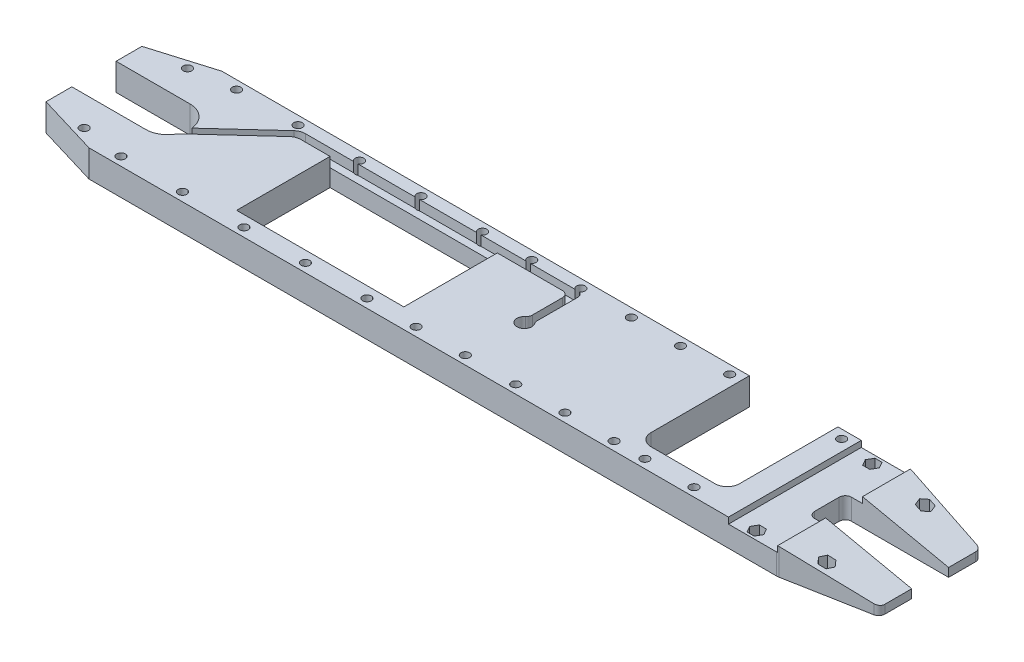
ISO-10303-21;
HEADER;
FILE_DESCRIPTION(('STEP AP214'),'2;1');
FILE_NAME('part.step','',(''),(''),'','','');
FILE_SCHEMA(('AUTOMOTIVE_DESIGN { 1 0 10303 214 1 1 1 1 }'));
ENDSEC;
DATA;
#1=APPLICATION_CONTEXT('core data for automotive mechanical design processes');
#2=APPLICATION_PROTOCOL_DEFINITION('international standard','automotive_design',2000,#1);
#3=PRODUCT_CONTEXT('',#1,'mechanical');
#4=PRODUCT('Part','Part','',(#3));
#5=PRODUCT_RELATED_PRODUCT_CATEGORY('part','',(#4));
#6=PRODUCT_DEFINITION_FORMATION('','',#4);
#7=PRODUCT_DEFINITION_CONTEXT('part definition',#1,'design');
#8=PRODUCT_DEFINITION('design','',#6,#7);
#9=PRODUCT_DEFINITION_SHAPE('','',#8);
#10=(LENGTH_UNIT() NAMED_UNIT(*) SI_UNIT(.MILLI.,.METRE.));
#11=(NAMED_UNIT(*) PLANE_ANGLE_UNIT() SI_UNIT($,.RADIAN.));
#12=(NAMED_UNIT(*) SI_UNIT($,.STERADIAN.) SOLID_ANGLE_UNIT());
#13=UNCERTAINTY_MEASURE_WITH_UNIT(LENGTH_MEASURE(1.E-05),#10,'distance_accuracy_value','');
#14=(GEOMETRIC_REPRESENTATION_CONTEXT(3) GLOBAL_UNCERTAINTY_ASSIGNED_CONTEXT((#13)) GLOBAL_UNIT_ASSIGNED_CONTEXT((#10,
#11,#12)) REPRESENTATION_CONTEXT('',''));
#15=CARTESIAN_POINT('',(0.,0.,0.));
#16=DIRECTION('',(0.,0.,1.));
#17=DIRECTION('',(1.,0.,0.));
#18=AXIS2_PLACEMENT_3D('',#15,#16,#17);
#19=CARTESIAN_POINT('',(586.000000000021,0.,46.9999999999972));
#20=DIRECTION('',(0.,1.,0.));
#21=DIRECTION('',(0.,0.,1.));
#22=AXIS2_PLACEMENT_3D('',#19,#20,#21);
#23=CYLINDRICAL_SURFACE('',#22,3.49999999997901);
#24=CARTESIAN_POINT('',(586.000000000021,0.,46.9999999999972));
#25=DIRECTION('',(0.,1.,0.));
#26=DIRECTION('',(0.,0.,1.));
#27=AXIS2_PLACEMENT_3D('',#24,#25,#26);
#28=CIRCLE('',#27,3.49999999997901);
#29=CARTESIAN_POINT('',(586.000000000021,0.,50.4999999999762));
#30=VERTEX_POINT('',#29);
#31=EDGE_CURVE('E849',#30,#30,#28,.T.);
#32=ORIENTED_EDGE('',*,*,#31,.F.);
#33=EDGE_LOOP('',(#32));
#34=FACE_BOUND('',#33,.T.);
#35=CARTESIAN_POINT('',(586.000000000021,8.,46.9999999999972));
#36=DIRECTION('',(0.,1.,0.));
#37=DIRECTION('',(0.,0.,1.));
#38=AXIS2_PLACEMENT_3D('',#35,#36,#37);
#39=CIRCLE('',#38,3.49999999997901);
#40=CARTESIAN_POINT('',(586.000000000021,8.,50.4999999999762));
#41=VERTEX_POINT('',#40);
#42=EDGE_CURVE('E734',#41,#41,#39,.F.);
#43=ORIENTED_EDGE('',*,*,#42,.F.);
#44=EDGE_LOOP('',(#43));
#45=FACE_BOUND('',#44,.T.);
#46=ADVANCED_FACE('F36',(#34,#45),#23,.F.);
#47=CARTESIAN_POINT('',(586.000000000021,0.,-46.9999999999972));
#48=DIRECTION('',(0.,1.,0.));
#49=DIRECTION('',(0.,0.,1.));
#50=AXIS2_PLACEMENT_3D('',#47,#48,#49);
#51=CYLINDRICAL_SURFACE('',#50,3.49999999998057);
#52=CARTESIAN_POINT('',(586.000000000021,0.,-46.9999999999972));
#53=DIRECTION('',(0.,1.,0.));
#54=DIRECTION('',(0.,0.,-1.));
#55=AXIS2_PLACEMENT_3D('',#52,#53,#54);
#56=CIRCLE('',#55,3.49999999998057);
#57=CARTESIAN_POINT('',(586.000000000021,0.,-50.4999999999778));
#58=VERTEX_POINT('',#57);
#59=EDGE_CURVE('E759',#58,#58,#56,.T.);
#60=ORIENTED_EDGE('',*,*,#59,.F.);
#61=EDGE_LOOP('',(#60));
#62=FACE_BOUND('',#61,.T.);
#63=CARTESIAN_POINT('',(586.000000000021,8.,-46.9999999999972));
#64=DIRECTION('',(0.,1.,0.));
#65=DIRECTION('',(0.,0.,1.));
#66=AXIS2_PLACEMENT_3D('',#63,#64,#65);
#67=CIRCLE('',#66,3.49999999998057);
#68=CARTESIAN_POINT('',(586.000000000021,8.,-43.5000000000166));
#69=VERTEX_POINT('',#68);
#70=EDGE_CURVE('E1552',#69,#69,#67,.F.);
#71=ORIENTED_EDGE('',*,*,#70,.F.);
#72=EDGE_LOOP('',(#71));
#73=FACE_BOUND('',#72,.T.);
#74=ADVANCED_FACE('F1482',(#62,#73),#51,.F.);
#75=CARTESIAN_POINT('',(636.000000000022,0.,-40.));
#76=DIRECTION('',(0.,1.,0.));
#77=DIRECTION('',(0.,0.,1.));
#78=AXIS2_PLACEMENT_3D('',#75,#76,#77);
#79=CYLINDRICAL_SURFACE('',#78,3.49999999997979);
#80=CARTESIAN_POINT('',(636.000000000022,0.,-40.));
#81=DIRECTION('',(0.,1.,0.));
#82=DIRECTION('',(0.,0.,1.));
#83=AXIS2_PLACEMENT_3D('',#80,#81,#82);
#84=CIRCLE('',#83,3.49999999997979);
#85=CARTESIAN_POINT('',(636.000000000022,0.,-36.5000000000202));
#86=VERTEX_POINT('',#85);
#87=EDGE_CURVE('E724',#86,#86,#84,.T.);
#88=ORIENTED_EDGE('',*,*,#87,.F.);
#89=EDGE_LOOP('',(#88));
#90=FACE_BOUND('',#89,.T.);
#91=CARTESIAN_POINT('',(636.000000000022,8.,-40.));
#92=DIRECTION('',(0.,1.,0.));
#93=DIRECTION('',(0.,0.,1.));
#94=AXIS2_PLACEMENT_3D('',#91,#92,#93);
#95=CIRCLE('',#94,3.49999999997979);
#96=CARTESIAN_POINT('',(636.000000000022,8.,-36.5000000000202));
#97=VERTEX_POINT('',#96);
#98=EDGE_CURVE('E1549',#97,#97,#95,.F.);
#99=ORIENTED_EDGE('',*,*,#98,.F.);
#100=EDGE_LOOP('',(#99));
#101=FACE_BOUND('',#100,.T.);
#102=ADVANCED_FACE('F1488',(#90,#101),#79,.F.);
#103=CARTESIAN_POINT('',(636.000000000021,0.,40.));
#104=DIRECTION('',(0.,1.,0.));
#105=DIRECTION('',(0.,0.,1.));
#106=AXIS2_PLACEMENT_3D('',#103,#104,#105);
#107=CYLINDRICAL_SURFACE('',#106,3.49999999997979);
#108=CARTESIAN_POINT('',(636.000000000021,0.,40.));
#109=DIRECTION('',(0.,1.,0.));
#110=DIRECTION('',(0.,0.,1.));
#111=AXIS2_PLACEMENT_3D('',#108,#109,#110);
#112=CIRCLE('',#111,3.49999999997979);
#113=CARTESIAN_POINT('',(636.000000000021,0.,43.4999999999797));
#114=VERTEX_POINT('',#113);
#115=EDGE_CURVE('E727',#114,#114,#112,.T.);
#116=ORIENTED_EDGE('',*,*,#115,.F.);
#117=EDGE_LOOP('',(#116));
#118=FACE_BOUND('',#117,.T.);
#119=CARTESIAN_POINT('',(636.000000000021,8.,40.));
#120=DIRECTION('',(0.,1.,0.));
#121=DIRECTION('',(0.,0.,1.));
#122=AXIS2_PLACEMENT_3D('',#119,#120,#121);
#123=CIRCLE('',#122,3.49999999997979);
#124=CARTESIAN_POINT('',(636.000000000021,8.,43.4999999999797));
#125=VERTEX_POINT('',#124);
#126=EDGE_CURVE('E710',#125,#125,#123,.F.);
#127=ORIENTED_EDGE('',*,*,#126,.F.);
#128=EDGE_LOOP('',(#127));
#129=FACE_BOUND('',#128,.T.);
#130=ADVANCED_FACE('F1643',(#118,#129),#107,.F.);
#131=CARTESIAN_POINT('',(124.000000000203,14.,-44.));
#132=DIRECTION('',(0.,0.,-1.));
#133=DIRECTION('',(-1.,0.,0.));
#134=AXIS2_PLACEMENT_3D('',#131,#132,#133);
#135=PLANE('',#134);
#136=DIRECTION('',(-1.,0.,0.));
#137=VECTOR('',#136,1.);
#138=CARTESIAN_POINT('',(124.000000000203,22.,-44.));
#139=LINE('',#138,#137);
#140=CARTESIAN_POINT('',(167.197224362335,22.,-44.));
#141=VERTEX_POINT('',#140);
#142=CARTESIAN_POINT('',(127.888787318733,22.,-44.));
#143=VERTEX_POINT('',#142);
#144=EDGE_CURVE('E926',#141,#143,#139,.T.);
#145=ORIENTED_EDGE('',*,*,#144,.T.);
#146=DIRECTION('',(0.,1.,0.));
#147=VECTOR('',#146,1.);
#148=CARTESIAN_POINT('',(127.888787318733,14.,-44.));
#149=LINE('',#148,#147);
#150=CARTESIAN_POINT('',(127.888787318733,14.,-44.));
#151=VERTEX_POINT('',#150);
#152=EDGE_CURVE('E1796',#143,#151,#149,.F.);
#153=ORIENTED_EDGE('',*,*,#152,.T.);
#154=DIRECTION('',(-1.,0.,0.));
#155=VECTOR('',#154,1.);
#156=CARTESIAN_POINT('',(124.000000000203,14.,-44.));
#157=LINE('',#156,#155);
#158=CARTESIAN_POINT('',(167.197224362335,14.,-44.));
#159=VERTEX_POINT('',#158);
#160=EDGE_CURVE('E909',#159,#151,#157,.T.);
#161=ORIENTED_EDGE('',*,*,#160,.F.);
#162=DIRECTION('',(0.,1.,0.));
#163=VECTOR('',#162,1.);
#164=CARTESIAN_POINT('',(167.197224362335,0.,-44.));
#165=LINE('',#164,#163);
#166=EDGE_CURVE('E1811',#159,#141,#165,.T.);
#167=ORIENTED_EDGE('',*,*,#166,.T.);
#168=EDGE_LOOP('',(#145,#153,#161,#167));
#169=FACE_BOUND('',#168,.T.);
#170=ADVANCED_FACE('F1302',(#169),#135,.F.);
#171=CARTESIAN_POINT('',(217.197224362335,22.,-44.));
#172=VERTEX_POINT('',#171);
#173=CARTESIAN_POINT('',(170.802775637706,22.,-44.));
#174=VERTEX_POINT('',#173);
#175=EDGE_CURVE('E929',#172,#174,#139,.T.);
#176=ORIENTED_EDGE('',*,*,#175,.T.);
#177=DIRECTION('',(0.,1.,0.));
#178=VECTOR('',#177,1.);
#179=CARTESIAN_POINT('',(170.802775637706,0.,-44.));
#180=LINE('',#179,#178);
#181=CARTESIAN_POINT('',(170.802775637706,14.,-44.));
#182=VERTEX_POINT('',#181);
#183=EDGE_CURVE('E1814',#174,#182,#180,.F.);
#184=ORIENTED_EDGE('',*,*,#183,.T.);
#185=CARTESIAN_POINT('',(217.197224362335,14.,-44.));
#186=VERTEX_POINT('',#185);
#187=EDGE_CURVE('E912',#186,#182,#157,.T.);
#188=ORIENTED_EDGE('',*,*,#187,.F.);
#189=DIRECTION('',(0.,1.,0.));
#190=VECTOR('',#189,1.);
#191=CARTESIAN_POINT('',(217.197224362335,0.,-44.));
#192=LINE('',#191,#190);
#193=EDGE_CURVE('E1817',#186,#172,#192,.T.);
#194=ORIENTED_EDGE('',*,*,#193,.T.);
#195=EDGE_LOOP('',(#176,#184,#188,#194));
#196=FACE_BOUND('',#195,.T.);
#197=ADVANCED_FACE('F1868',(#196),#135,.F.);
#198=CARTESIAN_POINT('',(267.197224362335,22.,-44.));
#199=VERTEX_POINT('',#198);
#200=CARTESIAN_POINT('',(220.802775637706,22.,-44.));
#201=VERTEX_POINT('',#200);
#202=EDGE_CURVE('E1896',#199,#201,#139,.T.);
#203=ORIENTED_EDGE('',*,*,#202,.T.);
#204=DIRECTION('',(0.,1.,0.));
#205=VECTOR('',#204,1.);
#206=CARTESIAN_POINT('',(220.802775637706,0.,-44.));
#207=LINE('',#206,#205);
#208=CARTESIAN_POINT('',(220.802775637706,14.,-44.));
#209=VERTEX_POINT('',#208);
#210=EDGE_CURVE('E1820',#201,#209,#207,.F.);
#211=ORIENTED_EDGE('',*,*,#210,.T.);
#212=CARTESIAN_POINT('',(267.197224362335,14.,-44.));
#213=VERTEX_POINT('',#212);
#214=EDGE_CURVE('E1856',#213,#209,#157,.T.);
#215=ORIENTED_EDGE('',*,*,#214,.F.);
#216=DIRECTION('',(0.,1.,0.));
#217=VECTOR('',#216,1.);
#218=CARTESIAN_POINT('',(267.197224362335,0.,-44.));
#219=LINE('',#218,#217);
#220=EDGE_CURVE('E1823',#213,#199,#219,.T.);
#221=ORIENTED_EDGE('',*,*,#220,.T.);
#222=EDGE_LOOP('',(#203,#211,#215,#221));
#223=FACE_BOUND('',#222,.T.);
#224=ADVANCED_FACE('F1880',(#223),#135,.F.);
#225=CARTESIAN_POINT('',(307.197224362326,22.,-44.));
#226=VERTEX_POINT('',#225);
#227=CARTESIAN_POINT('',(270.802775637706,22.,-44.));
#228=VERTEX_POINT('',#227);
#229=EDGE_CURVE('E1893',#226,#228,#139,.T.);
#230=ORIENTED_EDGE('',*,*,#229,.T.);
#231=DIRECTION('',(0.,1.,0.));
#232=VECTOR('',#231,1.);
#233=CARTESIAN_POINT('',(270.802775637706,0.,-44.));
#234=LINE('',#233,#232);
#235=CARTESIAN_POINT('',(270.802775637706,14.,-44.));
#236=VERTEX_POINT('',#235);
#237=EDGE_CURVE('E1826',#228,#236,#234,.F.);
#238=ORIENTED_EDGE('',*,*,#237,.T.);
#239=CARTESIAN_POINT('',(307.197224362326,14.,-44.));
#240=VERTEX_POINT('',#239);
#241=EDGE_CURVE('E1854',#240,#236,#157,.T.);
#242=ORIENTED_EDGE('',*,*,#241,.F.);
#243=DIRECTION('',(0.,1.,0.));
#244=VECTOR('',#243,1.);
#245=CARTESIAN_POINT('',(307.197224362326,0.,-44.));
#246=LINE('',#245,#244);
#247=EDGE_CURVE('E1829',#240,#226,#246,.T.);
#248=ORIENTED_EDGE('',*,*,#247,.T.);
#249=EDGE_LOOP('',(#230,#238,#242,#248));
#250=FACE_BOUND('',#249,.T.);
#251=ADVANCED_FACE('F1882',(#250),#135,.F.);
#252=CARTESIAN_POINT('',(347.197224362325,22.,-44.));
#253=VERTEX_POINT('',#252);
#254=CARTESIAN_POINT('',(310.802775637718,22.,-44.));
#255=VERTEX_POINT('',#254);
#256=EDGE_CURVE('E897',#253,#255,#139,.T.);
#257=ORIENTED_EDGE('',*,*,#256,.T.);
#258=DIRECTION('',(0.,1.,0.));
#259=VECTOR('',#258,1.);
#260=CARTESIAN_POINT('',(310.802775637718,0.,-44.));
#261=LINE('',#260,#259);
#262=CARTESIAN_POINT('',(310.802775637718,14.,-44.));
#263=VERTEX_POINT('',#262);
#264=EDGE_CURVE('E1832',#255,#263,#261,.F.);
#265=ORIENTED_EDGE('',*,*,#264,.T.);
#266=CARTESIAN_POINT('',(347.197224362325,14.,-44.));
#267=VERTEX_POINT('',#266);
#268=EDGE_CURVE('E913',#267,#263,#157,.T.);
#269=ORIENTED_EDGE('',*,*,#268,.F.);
#270=DIRECTION('',(0.,1.,0.));
#271=VECTOR('',#270,1.);
#272=CARTESIAN_POINT('',(347.197224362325,0.,-44.));
#273=LINE('',#272,#271);
#274=EDGE_CURVE('E1835',#267,#253,#273,.T.);
#275=ORIENTED_EDGE('',*,*,#274,.T.);
#276=EDGE_LOOP('',(#257,#265,#269,#275));
#277=FACE_BOUND('',#276,.T.);
#278=ADVANCED_FACE('F1351',(#277),#135,.F.);
#279=CARTESIAN_POINT('',(154.000000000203,0.,-37.9999999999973));
#280=DIRECTION('',(0.,0.,-1.));
#281=DIRECTION('',(-1.,0.,0.));
#282=AXIS2_PLACEMENT_3D('',#279,#280,#281);
#283=PLANE('',#282);
#284=DIRECTION('',(1.,0.,0.));
#285=VECTOR('',#284,1.);
#286=CARTESIAN_POINT('',(126.333272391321,14.,-38.));
#287=LINE('',#286,#285);
#288=CARTESIAN_POINT('',(154.000000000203,14.,-38.));
#289=VERTEX_POINT('',#288);
#290=CARTESIAN_POINT('',(290.000000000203,14.,-38.));
#291=VERTEX_POINT('',#290);
#292=EDGE_CURVE('E904',#289,#291,#287,.T.);
#293=ORIENTED_EDGE('',*,*,#292,.F.);
#294=DIRECTION('',(0.,1.,0.));
#295=VECTOR('',#294,1.);
#296=CARTESIAN_POINT('',(154.000000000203,0.,-37.9999999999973));
#297=LINE('',#296,#295);
#298=CARTESIAN_POINT('',(154.000000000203,0.,-37.9999999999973));
#299=VERTEX_POINT('',#298);
#300=EDGE_CURVE('E1007',#299,#289,#297,.T.);
#301=ORIENTED_EDGE('',*,*,#300,.F.);
#302=DIRECTION('',(-1.,0.,0.));
#303=VECTOR('',#302,1.);
#304=CARTESIAN_POINT('',(154.000000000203,0.,-37.9999999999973));
#305=LINE('',#304,#303);
#306=CARTESIAN_POINT('',(290.000000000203,0.,-37.9999999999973));
#307=VERTEX_POINT('',#306);
#308=EDGE_CURVE('E997',#307,#299,#305,.T.);
#309=ORIENTED_EDGE('',*,*,#308,.F.);
#310=DIRECTION('',(0.,1.,0.));
#311=VECTOR('',#310,1.);
#312=CARTESIAN_POINT('',(290.000000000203,0.,-37.9999999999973));
#313=LINE('',#312,#311);
#314=EDGE_CURVE('E1011',#307,#291,#313,.T.);
#315=ORIENTED_EDGE('',*,*,#314,.T.);
#316=EDGE_LOOP('',(#293,#301,#309,#315));
#317=FACE_BOUND('',#316,.T.);
#318=ADVANCED_FACE('F1347',(#317),#283,.F.);
#319=CARTESIAN_POINT('',(50.,22.,-54.));
#320=DIRECTION('',(0.,0.,1.));
#321=DIRECTION('',(1.,0.,0.));
#322=AXIS2_PLACEMENT_3D('',#319,#320,#321);
#323=PLANE('',#322);
#324=DIRECTION('',(-1.,0.,0.));
#325=VECTOR('',#324,1.);
#326=CARTESIAN_POINT('',(50.,22.,-54.));
#327=LINE('',#326,#325);
#328=CARTESIAN_POINT('',(479.000000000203,22.,-54.));
#329=VERTEX_POINT('',#328);
#330=CARTESIAN_POINT('',(50.,22.,-54.));
#331=VERTEX_POINT('',#330);
#332=EDGE_CURVE('E1119',#329,#331,#327,.T.);
#333=ORIENTED_EDGE('',*,*,#332,.F.);
#334=DIRECTION('',(0.,1.,0.));
#335=VECTOR('',#334,1.);
#336=CARTESIAN_POINT('',(479.000000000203,0.,-54.));
#337=LINE('',#336,#335);
#338=CARTESIAN_POINT('',(479.000000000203,0.,-54.));
#339=VERTEX_POINT('',#338);
#340=EDGE_CURVE('E974',#339,#329,#337,.T.);
#341=ORIENTED_EDGE('',*,*,#340,.F.);
#342=DIRECTION('',(-1.,0.,0.));
#343=VECTOR('',#342,1.);
#344=CARTESIAN_POINT('',(50.,0.,-54.));
#345=LINE('',#344,#343);
#346=CARTESIAN_POINT('',(50.,0.,-54.));
#347=VERTEX_POINT('',#346);
#348=EDGE_CURVE('E1153',#339,#347,#345,.T.);
#349=ORIENTED_EDGE('',*,*,#348,.T.);
#350=DIRECTION('',(0.,-1.,0.));
#351=VECTOR('',#350,1.);
#352=CARTESIAN_POINT('',(50.,22.,-54.));
#353=LINE('',#352,#351);
#354=EDGE_CURVE('E1161',#331,#347,#353,.T.);
#355=ORIENTED_EDGE('',*,*,#354,.F.);
#356=EDGE_LOOP('',(#333,#341,#349,#355));
#357=FACE_BOUND('',#356,.T.);
#358=ADVANCED_FACE('F1350',(#357),#323,.F.);
#359=CARTESIAN_POINT('',(0.,22.,-39.));
#360=DIRECTION('',(1.,0.,0.));
#361=DIRECTION('',(0.,0.,-1.));
#362=AXIS2_PLACEMENT_3D('',#359,#360,#361);
#363=PLANE('',#362);
#364=DIRECTION('',(0.,0.,1.));
#365=VECTOR('',#364,1.);
#366=CARTESIAN_POINT('',(0.,0.,-39.));
#367=LINE('',#366,#365);
#368=CARTESIAN_POINT('',(0.,0.,-39.));
#369=VERTEX_POINT('',#368);
#370=CARTESIAN_POINT('',(0.,0.,-18.));
#371=VERTEX_POINT('',#370);
#372=EDGE_CURVE('E1126',#369,#371,#367,.T.);
#373=ORIENTED_EDGE('',*,*,#372,.T.);
#374=DIRECTION('',(0.,1.,0.));
#375=VECTOR('',#374,1.);
#376=CARTESIAN_POINT('',(0.,0.,-18.));
#377=LINE('',#376,#375);
#378=CARTESIAN_POINT('',(0.,22.,-18.));
#379=VERTEX_POINT('',#378);
#380=EDGE_CURVE('E1037',#371,#379,#377,.T.);
#381=ORIENTED_EDGE('',*,*,#380,.T.);
#382=DIRECTION('',(0.,0.,1.));
#383=VECTOR('',#382,1.);
#384=CARTESIAN_POINT('',(0.,22.,-39.));
#385=LINE('',#384,#383);
#386=CARTESIAN_POINT('',(0.,22.,-39.));
#387=VERTEX_POINT('',#386);
#388=EDGE_CURVE('E1110',#387,#379,#385,.T.);
#389=ORIENTED_EDGE('',*,*,#388,.F.);
#390=DIRECTION('',(0.,-1.,0.));
#391=VECTOR('',#390,1.);
#392=CARTESIAN_POINT('',(0.,22.,-39.));
#393=LINE('',#392,#391);
#394=EDGE_CURVE('E1125',#387,#369,#393,.T.);
#395=ORIENTED_EDGE('',*,*,#394,.T.);
#396=EDGE_LOOP('',(#373,#381,#389,#395));
#397=FACE_BOUND('',#396,.T.);
#398=ADVANCED_FACE('F1430',(#397),#363,.F.);
#399=CARTESIAN_POINT('',(596.,22.,15.));
#400=DIRECTION('',(-1.,0.,0.));
#401=DIRECTION('',(0.,0.,1.));
#402=AXIS2_PLACEMENT_3D('',#399,#400,#401);
#403=PLANE('',#402);
#404=DIRECTION('',(0.,0.,-1.));
#405=VECTOR('',#404,1.);
#406=CARTESIAN_POINT('',(596.,17.,15.));
#407=LINE('',#406,#405);
#408=CARTESIAN_POINT('',(596.,17.,9.99999999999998));
#409=VERTEX_POINT('',#408);
#410=CARTESIAN_POINT('',(596.,17.,-10.));
#411=VERTEX_POINT('',#410);
#412=EDGE_CURVE('E1055',#409,#411,#407,.T.);
#413=ORIENTED_EDGE('',*,*,#412,.F.);
#414=DIRECTION('',(0.,-1.,0.));
#415=VECTOR('',#414,1.);
#416=CARTESIAN_POINT('',(596.,0.,9.99999999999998));
#417=LINE('',#416,#415);
#418=CARTESIAN_POINT('',(596.,0.,9.99999999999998));
#419=VERTEX_POINT('',#418);
#420=EDGE_CURVE('E1213',#409,#419,#417,.T.);
#421=ORIENTED_EDGE('',*,*,#420,.T.);
#422=DIRECTION('',(0.,0.,-1.));
#423=VECTOR('',#422,1.);
#424=CARTESIAN_POINT('',(596.,0.,15.));
#425=LINE('',#424,#423);
#426=CARTESIAN_POINT('',(596.,0.,-10.));
#427=VERTEX_POINT('',#426);
#428=EDGE_CURVE('E1142',#419,#427,#425,.T.);
#429=ORIENTED_EDGE('',*,*,#428,.T.);
#430=DIRECTION('',(0.,-1.,0.));
#431=VECTOR('',#430,1.);
#432=CARTESIAN_POINT('',(596.,22.,-10.));
#433=LINE('',#432,#431);
#434=EDGE_CURVE('E1215',#427,#411,#433,.F.);
#435=ORIENTED_EDGE('',*,*,#434,.T.);
#436=EDGE_LOOP('',(#413,#421,#429,#435));
#437=FACE_BOUND('',#436,.T.);
#438=ADVANCED_FACE('F1426',(#437),#403,.F.);
#439=CARTESIAN_POINT('',(601.,22.,-10.));
#440=DIRECTION('',(0.,1.,0.));
#441=DIRECTION('',(0.,0.,1.));
#442=AXIS2_PLACEMENT_3D('',#439,#440,#441);
#443=CYLINDRICAL_SURFACE('',#442,5.);
#444=CARTESIAN_POINT('',(601.,17.,-10.));
#445=DIRECTION('',(0.,1.,0.));
#446=DIRECTION('',(0.,0.,1.));
#447=AXIS2_PLACEMENT_3D('',#444,#445,#446);
#448=CIRCLE('',#447,5.);
#449=CARTESIAN_POINT('',(601.,17.,-15.));
#450=VERTEX_POINT('',#449);
#451=EDGE_CURVE('E1059',#411,#450,#448,.F.);
#452=ORIENTED_EDGE('',*,*,#451,.F.);
#453=ORIENTED_EDGE('',*,*,#434,.F.);
#454=CARTESIAN_POINT('',(601.,0.,-10.));
#455=DIRECTION('',(0.,1.,0.));
#456=DIRECTION('',(0.,0.,1.));
#457=AXIS2_PLACEMENT_3D('',#454,#455,#456);
#458=CIRCLE('',#457,5.);
#459=CARTESIAN_POINT('',(601.,0.,-15.));
#460=VERTEX_POINT('',#459);
#461=EDGE_CURVE('E1221',#460,#427,#458,.T.);
#462=ORIENTED_EDGE('',*,*,#461,.F.);
#463=DIRECTION('',(0.,-1.,0.));
#464=VECTOR('',#463,1.);
#465=CARTESIAN_POINT('',(601.,0.,-15.));
#466=LINE('',#465,#464);
#467=EDGE_CURVE('E1211',#450,#460,#466,.T.);
#468=ORIENTED_EDGE('',*,*,#467,.F.);
#469=EDGE_LOOP('',(#452,#453,#462,#468));
#470=FACE_BOUND('',#469,.T.);
#471=ADVANCED_FACE('F1429',(#470),#443,.F.);
#472=CARTESIAN_POINT('',(601.,22.,9.99999999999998));
#473=DIRECTION('',(0.,1.,0.));
#474=DIRECTION('',(0.,0.,1.));
#475=AXIS2_PLACEMENT_3D('',#472,#473,#474);
#476=CYLINDRICAL_SURFACE('',#475,5.);
#477=CARTESIAN_POINT('',(601.,17.,9.99999999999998));
#478=DIRECTION('',(0.,1.,0.));
#479=DIRECTION('',(0.,0.,1.));
#480=AXIS2_PLACEMENT_3D('',#477,#478,#479);
#481=CIRCLE('',#480,5.);
#482=CARTESIAN_POINT('',(601.,17.,15.));
#483=VERTEX_POINT('',#482);
#484=EDGE_CURVE('E1225',#483,#409,#481,.F.);
#485=ORIENTED_EDGE('',*,*,#484,.F.);
#486=DIRECTION('',(0.,-1.,0.));
#487=VECTOR('',#486,1.);
#488=CARTESIAN_POINT('',(601.,22.,15.));
#489=LINE('',#488,#487);
#490=CARTESIAN_POINT('',(601.,0.,15.));
#491=VERTEX_POINT('',#490);
#492=EDGE_CURVE('E1218',#491,#483,#489,.F.);
#493=ORIENTED_EDGE('',*,*,#492,.F.);
#494=CARTESIAN_POINT('',(601.,0.,9.99999999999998));
#495=DIRECTION('',(0.,1.,0.));
#496=DIRECTION('',(0.,0.,1.));
#497=AXIS2_PLACEMENT_3D('',#494,#495,#496);
#498=CIRCLE('',#497,5.);
#499=EDGE_CURVE('E1223',#419,#491,#498,.T.);
#500=ORIENTED_EDGE('',*,*,#499,.F.);
#501=ORIENTED_EDGE('',*,*,#420,.F.);
#502=EDGE_LOOP('',(#485,#493,#500,#501));
#503=FACE_BOUND('',#502,.T.);
#504=ADVANCED_FACE('F1454',(#503),#476,.F.);
#505=CARTESIAN_POINT('',(0.,22.,18.));
#506=VERTEX_POINT('',#505);
#507=CARTESIAN_POINT('',(2.22044604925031E-13,22.,39.));
#508=VERTEX_POINT('',#507);
#509=EDGE_CURVE('E1114',#506,#508,#385,.T.);
#510=ORIENTED_EDGE('',*,*,#509,.F.);
#511=DIRECTION('',(0.,1.,0.));
#512=VECTOR('',#511,1.);
#513=CARTESIAN_POINT('',(0.,0.,18.));
#514=LINE('',#513,#512);
#515=CARTESIAN_POINT('',(0.,0.,18.));
#516=VERTEX_POINT('',#515);
#517=EDGE_CURVE('E1029',#516,#506,#514,.T.);
#518=ORIENTED_EDGE('',*,*,#517,.F.);
#519=CARTESIAN_POINT('',(2.22044604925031E-13,0.,39.));
#520=VERTEX_POINT('',#519);
#521=EDGE_CURVE('E1109',#516,#520,#367,.T.);
#522=ORIENTED_EDGE('',*,*,#521,.T.);
#523=DIRECTION('',(0.,-1.,0.));
#524=VECTOR('',#523,1.);
#525=CARTESIAN_POINT('',(2.22044604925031E-13,22.,39.));
#526=LINE('',#525,#524);
#527=EDGE_CURVE('E1172',#508,#520,#526,.T.);
#528=ORIENTED_EDGE('',*,*,#527,.F.);
#529=EDGE_LOOP('',(#510,#518,#522,#528));
#530=FACE_BOUND('',#529,.T.);
#531=ADVANCED_FACE('F1450',(#530),#363,.F.);
#532=CARTESIAN_POINT('',(2.22044604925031E-13,22.,39.));
#533=DIRECTION('',(0.287347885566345,0.,-0.957826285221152));
#534=DIRECTION('',(-0.957826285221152,0.,-0.287347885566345));
#535=AXIS2_PLACEMENT_3D('',#532,#533,#534);
#536=PLANE('',#535);
#537=DIRECTION('',(0.957826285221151,0.,0.287347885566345));
#538=VECTOR('',#537,1.);
#539=CARTESIAN_POINT('',(2.22044604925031E-13,0.,39.));
#540=LINE('',#539,#538);
#541=CARTESIAN_POINT('',(50.0000000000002,0.,54.));
#542=VERTEX_POINT('',#541);
#543=EDGE_CURVE('E1129',#520,#542,#540,.T.);
#544=ORIENTED_EDGE('',*,*,#543,.T.);
#545=DIRECTION('',(0.,-1.,0.));
#546=VECTOR('',#545,1.);
#547=CARTESIAN_POINT('',(50.0000000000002,22.,54.));
#548=LINE('',#547,#546);
#549=CARTESIAN_POINT('',(50.0000000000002,22.,54.));
#550=VERTEX_POINT('',#549);
#551=EDGE_CURVE('E1169',#550,#542,#548,.T.);
#552=ORIENTED_EDGE('',*,*,#551,.F.);
#553=DIRECTION('',(0.957826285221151,0.,0.287347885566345));
#554=VECTOR('',#553,1.);
#555=CARTESIAN_POINT('',(2.22044604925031E-13,22.,39.));
#556=LINE('',#555,#554);
#557=EDGE_CURVE('E1113',#508,#550,#556,.T.);
#558=ORIENTED_EDGE('',*,*,#557,.F.);
#559=ORIENTED_EDGE('',*,*,#527,.T.);
#560=EDGE_LOOP('',(#544,#552,#558,#559));
#561=FACE_BOUND('',#560,.T.);
#562=ADVANCED_FACE('F1446',(#561),#536,.F.);
#563=CARTESIAN_POINT('',(50.0000000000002,22.,54.));
#564=DIRECTION('',(0.,0.,-1.));
#565=DIRECTION('',(-1.,0.,0.));
#566=AXIS2_PLACEMENT_3D('',#563,#564,#565);
#567=PLANE('',#566);
#568=DIRECTION('',(1.,0.,0.));
#569=VECTOR('',#568,1.);
#570=CARTESIAN_POINT('',(50.0000000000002,17.,54.));
#571=LINE('',#570,#569);
#572=CARTESIAN_POINT('',(570.,17.,53.9999999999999));
#573=VERTEX_POINT('',#572);
#574=CARTESIAN_POINT('',(609.079299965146,17.,53.9999999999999));
#575=VERTEX_POINT('',#574);
#576=EDGE_CURVE('E1066',#573,#575,#571,.T.);
#577=ORIENTED_EDGE('',*,*,#576,.F.);
#578=DIRECTION('',(0.,1.,0.));
#579=VECTOR('',#578,1.);
#580=CARTESIAN_POINT('',(570.,22.,53.9999999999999));
#581=LINE('',#580,#579);
#582=CARTESIAN_POINT('',(570.,22.,54.));
#583=VERTEX_POINT('',#582);
#584=EDGE_CURVE('E1090',#573,#583,#581,.T.);
#585=ORIENTED_EDGE('',*,*,#584,.T.);
#586=DIRECTION('',(1.,0.,0.));
#587=VECTOR('',#586,1.);
#588=CARTESIAN_POINT('',(50.0000000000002,22.,54.));
#589=LINE('',#588,#587);
#590=EDGE_CURVE('E1116',#550,#583,#589,.T.);
#591=ORIENTED_EDGE('',*,*,#590,.F.);
#592=ORIENTED_EDGE('',*,*,#551,.T.);
#593=DIRECTION('',(1.,0.,0.));
#594=VECTOR('',#593,1.);
#595=CARTESIAN_POINT('',(50.0000000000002,0.,54.));
#596=LINE('',#595,#594);
#597=CARTESIAN_POINT('',(609.079299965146,0.,53.9999999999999));
#598=VERTEX_POINT('',#597);
#599=EDGE_CURVE('E1131',#542,#598,#596,.T.);
#600=ORIENTED_EDGE('',*,*,#599,.T.);
#601=DIRECTION('',(0.,-1.,0.));
#602=VECTOR('',#601,1.);
#603=CARTESIAN_POINT('',(609.079299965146,22.,53.9999999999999));
#604=LINE('',#603,#602);
#605=EDGE_CURVE('E1206',#598,#575,#604,.F.);
#606=ORIENTED_EDGE('',*,*,#605,.T.);
#607=EDGE_LOOP('',(#577,#585,#591,#592,#600,#606));
#608=FACE_BOUND('',#607,.T.);
#609=ADVANCED_FACE('F1442',(#608),#567,.F.);
#610=CARTESIAN_POINT('',(610.,22.,53.9999999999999));
#611=DIRECTION('',(-0.182592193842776,0.,-0.983188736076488));
#612=DIRECTION('',(-0.983188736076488,0.,0.182592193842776));
#613=AXIS2_PLACEMENT_3D('',#610,#611,#612);
#614=PLANE('',#613);
#615=DIRECTION('',(-0.962397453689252,0.204563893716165,0.178730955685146));
#616=VECTOR('',#615,1.);
#617=CARTESIAN_POINT('',(609.976170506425,21.8840244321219,54.0044254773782));
#618=LINE('',#617,#616);
#619=CARTESIAN_POINT('',(675.912960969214,7.86872696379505,41.7590215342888));
#620=VERTEX_POINT('',#619);
#621=CARTESIAN_POINT('',(610.905221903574,21.6865484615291,53.8318873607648));
#622=VERTEX_POINT('',#621);
#623=EDGE_CURVE('E1096',#620,#622,#618,.T.);
#624=ORIENTED_EDGE('',*,*,#623,.T.);
#625=DIRECTION('',(0.,-1.,0.));
#626=VECTOR('',#625,1.);
#627=CARTESIAN_POINT('',(610.905221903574,22.,53.8318873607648));
#628=LINE('',#627,#626);
#629=CARTESIAN_POINT('',(610.905221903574,0.,53.8318873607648));
#630=VERTEX_POINT('',#629);
#631=EDGE_CURVE('E1203',#622,#630,#628,.T.);
#632=ORIENTED_EDGE('',*,*,#631,.T.);
#633=DIRECTION('',(0.983188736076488,0.,-0.182592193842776));
#634=VECTOR('',#633,1.);
#635=CARTESIAN_POINT('',(610.,0.,53.9999999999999));
#636=LINE('',#635,#634);
#637=CARTESIAN_POINT('',(675.912960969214,0.,41.7590215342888));
#638=VERTEX_POINT('',#637);
#639=EDGE_CURVE('E1134',#630,#638,#636,.T.);
#640=ORIENTED_EDGE('',*,*,#639,.T.);
#641=DIRECTION('',(0.,-1.,0.));
#642=VECTOR('',#641,1.);
#643=CARTESIAN_POINT('',(675.912960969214,22.,41.7590215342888));
#644=LINE('',#643,#642);
#645=EDGE_CURVE('E1187',#638,#620,#644,.F.);
#646=ORIENTED_EDGE('',*,*,#645,.T.);
#647=EDGE_LOOP('',(#624,#632,#640,#646));
#648=FACE_BOUND('',#647,.T.);
#649=ADVANCED_FACE('F1438',(#648),#614,.F.);
#650=CARTESIAN_POINT('',(680.,22.,41.));
#651=DIRECTION('',(-1.,0.,0.));
#652=DIRECTION('',(0.,0.,1.));
#653=AXIS2_PLACEMENT_3D('',#650,#651,#652);
#654=PLANE('',#653);
#655=DIRECTION('',(0.,-1.,0.));
#656=VECTOR('',#655,1.);
#657=CARTESIAN_POINT('',(680.,22.,15.));
#658=LINE('',#657,#656);
#659=CARTESIAN_POINT('',(680.,7.,15.));
#660=VERTEX_POINT('',#659);
#661=CARTESIAN_POINT('',(680.,0.,15.));
#662=VERTEX_POINT('',#661);
#663=EDGE_CURVE('E1167',#660,#662,#658,.T.);
#664=ORIENTED_EDGE('',*,*,#663,.F.);
#665=DIRECTION('',(0.,0.,-1.));
#666=VECTOR('',#665,1.);
#667=CARTESIAN_POINT('',(680.,7.,54.));
#668=LINE('',#667,#666);
#669=CARTESIAN_POINT('',(680.,7.,36.8430778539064));
#670=VERTEX_POINT('',#669);
#671=EDGE_CURVE('E1095',#670,#660,#668,.T.);
#672=ORIENTED_EDGE('',*,*,#671,.F.);
#673=DIRECTION('',(0.,-1.,0.));
#674=VECTOR('',#673,1.);
#675=CARTESIAN_POINT('',(680.,22.,36.8430778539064));
#676=LINE('',#675,#674);
#677=CARTESIAN_POINT('',(680.,0.,36.8430778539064));
#678=VERTEX_POINT('',#677);
#679=EDGE_CURVE('E1185',#670,#678,#676,.T.);
#680=ORIENTED_EDGE('',*,*,#679,.T.);
#681=DIRECTION('',(0.,0.,-1.));
#682=VECTOR('',#681,1.);
#683=CARTESIAN_POINT('',(680.,0.,41.));
#684=LINE('',#683,#682);
#685=EDGE_CURVE('E1136',#678,#662,#684,.T.);
#686=ORIENTED_EDGE('',*,*,#685,.T.);
#687=EDGE_LOOP('',(#664,#672,#680,#686));
#688=FACE_BOUND('',#687,.T.);
#689=ADVANCED_FACE('F1434',(#688),#654,.F.);
#690=CARTESIAN_POINT('',(680.,22.,15.));
#691=DIRECTION('',(0.,0.,1.));
#692=DIRECTION('',(1.,0.,0.));
#693=AXIS2_PLACEMENT_3D('',#690,#691,#692);
#694=PLANE('',#693);
#695=DIRECTION('',(-1.,0.,0.));
#696=VECTOR('',#695,1.);
#697=CARTESIAN_POINT('',(680.,17.,15.));
#698=LINE('',#697,#696);
#699=CARTESIAN_POINT('',(610.,17.,15.));
#700=VERTEX_POINT('',#699);
#701=EDGE_CURVE('E1057',#700,#483,#698,.T.);
#702=ORIENTED_EDGE('',*,*,#701,.F.);
#703=DIRECTION('',(0.,1.,0.));
#704=VECTOR('',#703,1.);
#705=CARTESIAN_POINT('',(610.,22.,15.));
#706=LINE('',#705,#704);
#707=CARTESIAN_POINT('',(610.,21.8789593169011,15.));
#708=VERTEX_POINT('',#707);
#709=EDGE_CURVE('E1076',#700,#708,#706,.T.);
#710=ORIENTED_EDGE('',*,*,#709,.T.);
#711=DIRECTION('',(0.978147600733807,-0.207911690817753,0.));
#712=VECTOR('',#711,1.);
#713=CARTESIAN_POINT('',(676.949475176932,7.64840906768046,15.));
#714=LINE('',#713,#712);
#715=EDGE_CURVE('E1107',#708,#660,#714,.T.);
#716=ORIENTED_EDGE('',*,*,#715,.T.);
#717=ORIENTED_EDGE('',*,*,#663,.T.);
#718=DIRECTION('',(-1.,0.,0.));
#719=VECTOR('',#718,1.);
#720=CARTESIAN_POINT('',(680.,0.,15.));
#721=LINE('',#720,#719);
#722=EDGE_CURVE('E1139',#662,#491,#721,.T.);
#723=ORIENTED_EDGE('',*,*,#722,.T.);
#724=ORIENTED_EDGE('',*,*,#492,.T.);
#725=EDGE_LOOP('',(#702,#710,#716,#717,#723,#724));
#726=FACE_BOUND('',#725,.T.);
#727=ADVANCED_FACE('F1424',(#726),#694,.F.);
#728=CARTESIAN_POINT('',(680.,22.,-15.));
#729=DIRECTION('',(0.,0.,-1.));
#730=DIRECTION('',(-1.,0.,0.));
#731=AXIS2_PLACEMENT_3D('',#728,#729,#730);
#732=PLANE('',#731);
#733=DIRECTION('',(-0.978147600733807,0.207911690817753,0.));
#734=VECTOR('',#733,1.);
#735=CARTESIAN_POINT('',(676.949475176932,7.64840906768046,-15.));
#736=LINE('',#735,#734);
#737=CARTESIAN_POINT('',(680.,7.,-15.));
#738=VERTEX_POINT('',#737);
#739=CARTESIAN_POINT('',(610.,21.8789593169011,-15.));
#740=VERTEX_POINT('',#739);
#741=EDGE_CURVE('E1104',#738,#740,#736,.T.);
#742=ORIENTED_EDGE('',*,*,#741,.T.);
#743=DIRECTION('',(0.,-1.,0.));
#744=VECTOR('',#743,1.);
#745=CARTESIAN_POINT('',(610.,22.,-15.));
#746=LINE('',#745,#744);
#747=CARTESIAN_POINT('',(610.,17.,-15.));
#748=VERTEX_POINT('',#747);
#749=EDGE_CURVE('E1084',#740,#748,#746,.T.);
#750=ORIENTED_EDGE('',*,*,#749,.T.);
#751=DIRECTION('',(1.,0.,0.));
#752=VECTOR('',#751,1.);
#753=CARTESIAN_POINT('',(680.,17.,-15.));
#754=LINE('',#753,#752);
#755=EDGE_CURVE('E1061',#450,#748,#754,.T.);
#756=ORIENTED_EDGE('',*,*,#755,.F.);
#757=ORIENTED_EDGE('',*,*,#467,.T.);
#758=DIRECTION('',(1.,0.,0.));
#759=VECTOR('',#758,1.);
#760=CARTESIAN_POINT('',(680.,0.,-15.));
#761=LINE('',#760,#759);
#762=CARTESIAN_POINT('',(680.,0.,-15.));
#763=VERTEX_POINT('',#762);
#764=EDGE_CURVE('E1145',#460,#763,#761,.T.);
#765=ORIENTED_EDGE('',*,*,#764,.T.);
#766=DIRECTION('',(0.,-1.,0.));
#767=VECTOR('',#766,1.);
#768=CARTESIAN_POINT('',(680.,22.,-15.));
#769=LINE('',#768,#767);
#770=EDGE_CURVE('E1164',#738,#763,#769,.T.);
#771=ORIENTED_EDGE('',*,*,#770,.F.);
#772=EDGE_LOOP('',(#742,#750,#756,#757,#765,#771));
#773=FACE_BOUND('',#772,.T.);
#774=ADVANCED_FACE('F1420',(#773),#732,.F.);
#775=CARTESIAN_POINT('',(680.,22.,-41.));
#776=DIRECTION('',(-1.,0.,0.));
#777=DIRECTION('',(0.,0.,1.));
#778=AXIS2_PLACEMENT_3D('',#775,#776,#777);
#779=PLANE('',#778);
#780=DIRECTION('',(0.,-1.,0.));
#781=VECTOR('',#780,1.);
#782=CARTESIAN_POINT('',(680.,22.,-36.8430778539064));
#783=LINE('',#782,#781);
#784=CARTESIAN_POINT('',(680.,0.,-36.8430778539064));
#785=VERTEX_POINT('',#784);
#786=CARTESIAN_POINT('',(680.,7.,-36.8430778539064));
#787=VERTEX_POINT('',#786);
#788=EDGE_CURVE('E1182',#785,#787,#783,.F.);
#789=ORIENTED_EDGE('',*,*,#788,.T.);
#790=EDGE_CURVE('E1093',#738,#787,#668,.T.);
#791=ORIENTED_EDGE('',*,*,#790,.F.);
#792=ORIENTED_EDGE('',*,*,#770,.T.);
#793=DIRECTION('',(0.,0.,-1.));
#794=VECTOR('',#793,1.);
#795=CARTESIAN_POINT('',(680.,0.,-41.));
#796=LINE('',#795,#794);
#797=EDGE_CURVE('E1147',#763,#785,#796,.T.);
#798=ORIENTED_EDGE('',*,*,#797,.T.);
#799=EDGE_LOOP('',(#789,#791,#792,#798));
#800=FACE_BOUND('',#799,.T.);
#801=ADVANCED_FACE('F1416',(#800),#779,.F.);
#802=CARTESIAN_POINT('',(610.,22.,-54.));
#803=DIRECTION('',(-0.182592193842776,0.,0.983188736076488));
#804=DIRECTION('',(0.983188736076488,0.,0.182592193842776));
#805=AXIS2_PLACEMENT_3D('',#802,#803,#804);
#806=PLANE('',#805);
#807=DIRECTION('',(-0.983188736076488,0.,-0.182592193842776));
#808=VECTOR('',#807,1.);
#809=CARTESIAN_POINT('',(610.,0.,-54.));
#810=LINE('',#809,#808);
#811=CARTESIAN_POINT('',(675.912960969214,0.,-41.7590215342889));
#812=VERTEX_POINT('',#811);
#813=CARTESIAN_POINT('',(610.905221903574,0.,-53.8318873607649));
#814=VERTEX_POINT('',#813);
#815=EDGE_CURVE('E1150',#812,#814,#810,.T.);
#816=ORIENTED_EDGE('',*,*,#815,.T.);
#817=DIRECTION('',(0.,-1.,0.));
#818=VECTOR('',#817,1.);
#819=CARTESIAN_POINT('',(610.905221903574,22.,-53.8318873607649));
#820=LINE('',#819,#818);
#821=CARTESIAN_POINT('',(610.905221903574,21.6865484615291,-53.8318873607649));
#822=VERTEX_POINT('',#821);
#823=EDGE_CURVE('E1198',#814,#822,#820,.F.);
#824=ORIENTED_EDGE('',*,*,#823,.T.);
#825=DIRECTION('',(0.962397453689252,-0.204563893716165,0.178730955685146));
#826=VECTOR('',#825,1.);
#827=CARTESIAN_POINT('',(609.976170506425,21.8840244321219,-54.0044254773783));
#828=LINE('',#827,#826);
#829=CARTESIAN_POINT('',(675.912960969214,7.86872696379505,-41.7590215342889));
#830=VERTEX_POINT('',#829);
#831=EDGE_CURVE('E1102',#822,#830,#828,.T.);
#832=ORIENTED_EDGE('',*,*,#831,.T.);
#833=DIRECTION('',(0.,-1.,0.));
#834=VECTOR('',#833,1.);
#835=CARTESIAN_POINT('',(675.912960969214,22.,-41.7590215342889));
#836=LINE('',#835,#834);
#837=EDGE_CURVE('E1175',#830,#812,#836,.T.);
#838=ORIENTED_EDGE('',*,*,#837,.T.);
#839=EDGE_LOOP('',(#816,#824,#832,#838));
#840=FACE_BOUND('',#839,.T.);
#841=ADVANCED_FACE('F1412',(#840),#806,.F.);
#842=CARTESIAN_POINT('',(609.079299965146,0.,-54.));
#843=VERTEX_POINT('',#842);
#844=CARTESIAN_POINT('',(551.000000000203,0.,-54.));
#845=VERTEX_POINT('',#844);
#846=EDGE_CURVE('E1154',#843,#845,#345,.T.);
#847=ORIENTED_EDGE('',*,*,#846,.T.);
#848=DIRECTION('',(0.,1.,0.));
#849=VECTOR('',#848,1.);
#850=CARTESIAN_POINT('',(551.000000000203,0.,-54.));
#851=LINE('',#850,#849);
#852=CARTESIAN_POINT('',(551.000000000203,22.,-54.));
#853=VERTEX_POINT('',#852);
#854=EDGE_CURVE('E977',#845,#853,#851,.T.);
#855=ORIENTED_EDGE('',*,*,#854,.T.);
#856=CARTESIAN_POINT('',(570.,22.,-54.));
#857=VERTEX_POINT('',#856);
#858=EDGE_CURVE('E1120',#857,#853,#327,.T.);
#859=ORIENTED_EDGE('',*,*,#858,.F.);
#860=DIRECTION('',(0.,-1.,0.));
#861=VECTOR('',#860,1.);
#862=CARTESIAN_POINT('',(570.,22.,-54.));
#863=LINE('',#862,#861);
#864=CARTESIAN_POINT('',(570.,17.,-54.));
#865=VERTEX_POINT('',#864);
#866=EDGE_CURVE('E1087',#857,#865,#863,.T.);
#867=ORIENTED_EDGE('',*,*,#866,.T.);
#868=DIRECTION('',(-1.,0.,0.));
#869=VECTOR('',#868,1.);
#870=CARTESIAN_POINT('',(50.,17.,-54.));
#871=LINE('',#870,#869);
#872=CARTESIAN_POINT('',(609.079299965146,17.,-54.));
#873=VERTEX_POINT('',#872);
#874=EDGE_CURVE('E1071',#873,#865,#871,.T.);
#875=ORIENTED_EDGE('',*,*,#874,.F.);
#876=DIRECTION('',(0.,-1.,0.));
#877=VECTOR('',#876,1.);
#878=CARTESIAN_POINT('',(609.079299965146,22.,-54.));
#879=LINE('',#878,#877);
#880=EDGE_CURVE('E1192',#873,#843,#879,.T.);
#881=ORIENTED_EDGE('',*,*,#880,.T.);
#882=EDGE_LOOP('',(#847,#855,#859,#867,#875,#881));
#883=FACE_BOUND('',#882,.T.);
#884=ADVANCED_FACE('F1408',(#883),#323,.F.);
#885=CARTESIAN_POINT('',(0.,22.,-39.));
#886=DIRECTION('',(0.287347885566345,0.,0.957826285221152));
#887=DIRECTION('',(0.957826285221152,0.,-0.287347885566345));
#888=AXIS2_PLACEMENT_3D('',#885,#886,#887);
#889=PLANE('',#888);
#890=DIRECTION('',(-0.957826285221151,0.,0.287347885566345));
#891=VECTOR('',#890,1.);
#892=CARTESIAN_POINT('',(0.,0.,-39.));
#893=LINE('',#892,#891);
#894=EDGE_CURVE('E1157',#347,#369,#893,.T.);
#895=ORIENTED_EDGE('',*,*,#894,.T.);
#896=ORIENTED_EDGE('',*,*,#394,.F.);
#897=DIRECTION('',(-0.957826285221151,0.,0.287347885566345));
#898=VECTOR('',#897,1.);
#899=CARTESIAN_POINT('',(0.,22.,-39.));
#900=LINE('',#899,#898);
#901=EDGE_CURVE('E1123',#331,#387,#900,.T.);
#902=ORIENTED_EDGE('',*,*,#901,.F.);
#903=ORIENTED_EDGE('',*,*,#354,.T.);
#904=EDGE_LOOP('',(#895,#896,#902,#903));
#905=FACE_BOUND('',#904,.T.);
#906=ADVANCED_FACE('F1400',(#905),#889,.F.);
#907=CARTESIAN_POINT('',(0.,22.,0.));
#908=DIRECTION('',(0.,1.,0.));
#909=DIRECTION('',(0.,0.,1.));
#910=AXIS2_PLACEMENT_3D('',#907,#908,#909);
#911=PLANE('',#910);
#912=CARTESIAN_POINT('',(69.,22.,46.9999999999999));
#913=DIRECTION('',(0.,1.,0.));
#914=DIRECTION('',(0.,0.,1.));
#915=AXIS2_PLACEMENT_3D('',#912,#913,#914);
#916=CIRCLE('',#915,3.50000000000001);
#917=CARTESIAN_POINT('',(69.,22.,50.4999999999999));
#918=VERTEX_POINT('',#917);
#919=EDGE_CURVE('E803',#918,#918,#916,.T.);
#920=ORIENTED_EDGE('',*,*,#919,.F.);
#921=EDGE_LOOP('',(#920));
#922=FACE_BOUND('',#921,.T.);
#923=CARTESIAN_POINT('',(119.00000000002,22.,47.0000000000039));
#924=DIRECTION('',(0.,1.,0.));
#925=DIRECTION('',(0.,0.,1.));
#926=AXIS2_PLACEMENT_3D('',#923,#924,#925);
#927=CIRCLE('',#926,3.49999999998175);
#928=CARTESIAN_POINT('',(119.00000000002,22.,50.4999999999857));
#929=VERTEX_POINT('',#928);
#930=EDGE_CURVE('E809',#929,#929,#927,.T.);
#931=ORIENTED_EDGE('',*,*,#930,.F.);
#932=EDGE_LOOP('',(#931));
#933=FACE_BOUND('',#932,.T.);
#934=CARTESIAN_POINT('',(169.00000000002,22.,47.000000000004));
#935=DIRECTION('',(0.,1.,0.));
#936=DIRECTION('',(0.,0.,1.));
#937=AXIS2_PLACEMENT_3D('',#934,#935,#936);
#938=CIRCLE('',#937,3.49999999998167);
#939=CARTESIAN_POINT('',(169.00000000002,22.,50.4999999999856));
#940=VERTEX_POINT('',#939);
#941=EDGE_CURVE('E815',#940,#940,#938,.T.);
#942=ORIENTED_EDGE('',*,*,#941,.F.);
#943=EDGE_LOOP('',(#942));
#944=FACE_BOUND('',#943,.T.);
#945=CARTESIAN_POINT('',(219.00000000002,22.,47.000000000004));
#946=DIRECTION('',(0.,1.,0.));
#947=DIRECTION('',(0.,0.,1.));
#948=AXIS2_PLACEMENT_3D('',#945,#946,#947);
#949=CIRCLE('',#948,3.49999999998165);
#950=CARTESIAN_POINT('',(219.00000000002,22.,50.4999999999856));
#951=VERTEX_POINT('',#950);
#952=EDGE_CURVE('E821',#951,#951,#949,.T.);
#953=ORIENTED_EDGE('',*,*,#952,.F.);
#954=EDGE_LOOP('',(#953));
#955=FACE_BOUND('',#954,.T.);
#956=CARTESIAN_POINT('',(269.00000000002,22.,47.0000000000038));
#957=DIRECTION('',(0.,1.,0.));
#958=DIRECTION('',(0.,0.,1.));
#959=AXIS2_PLACEMENT_3D('',#956,#957,#958);
#960=CIRCLE('',#959,3.49999999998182);
#961=CARTESIAN_POINT('',(269.00000000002,22.,50.4999999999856));
#962=VERTEX_POINT('',#961);
#963=EDGE_CURVE('E827',#962,#962,#960,.T.);
#964=ORIENTED_EDGE('',*,*,#963,.F.);
#965=EDGE_LOOP('',(#964));
#966=FACE_BOUND('',#965,.T.);
#967=CARTESIAN_POINT('',(309.000000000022,22.,46.9999999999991));
#968=DIRECTION('',(0.,1.,0.));
#969=DIRECTION('',(0.,0.,1.));
#970=AXIS2_PLACEMENT_3D('',#967,#968,#969);
#971=CIRCLE('',#970,3.49999999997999);
#972=CARTESIAN_POINT('',(309.000000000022,22.,50.4999999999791));
#973=VERTEX_POINT('',#972);
#974=EDGE_CURVE('E833',#973,#973,#971,.T.);
#975=ORIENTED_EDGE('',*,*,#974,.F.);
#976=EDGE_LOOP('',(#975));
#977=FACE_BOUND('',#976,.T.);
#978=CARTESIAN_POINT('',(349.000000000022,22.,46.999999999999));
#979=DIRECTION('',(0.,1.,0.));
#980=DIRECTION('',(0.,0.,1.));
#981=AXIS2_PLACEMENT_3D('',#978,#979,#980);
#982=CIRCLE('',#981,3.49999999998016);
#983=CARTESIAN_POINT('',(349.000000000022,22.,50.4999999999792));
#984=VERTEX_POINT('',#983);
#985=EDGE_CURVE('E839',#984,#984,#982,.T.);
#986=ORIENTED_EDGE('',*,*,#985,.F.);
#987=EDGE_LOOP('',(#986));
#988=FACE_BOUND('',#987,.T.);
#989=CARTESIAN_POINT('',(390.000000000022,22.,46.9999999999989));
#990=DIRECTION('',(0.,1.,0.));
#991=DIRECTION('',(0.,0.,1.));
#992=AXIS2_PLACEMENT_3D('',#989,#990,#991);
#993=CIRCLE('',#992,3.49999999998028);
#994=CARTESIAN_POINT('',(390.000000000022,22.,50.4999999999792));
#995=VERTEX_POINT('',#994);
#996=EDGE_CURVE('E845',#995,#995,#993,.T.);
#997=ORIENTED_EDGE('',*,*,#996,.F.);
#998=EDGE_LOOP('',(#997));
#999=FACE_BOUND('',#998,.T.);
#1000=CARTESIAN_POINT('',(535.000000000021,22.,46.9999999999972));
#1001=DIRECTION('',(0.,1.,0.));
#1002=DIRECTION('',(0.,0.,1.));
#1003=AXIS2_PLACEMENT_3D('',#1000,#1001,#1002);
#1004=CIRCLE('',#1003,3.49999999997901);
#1005=CARTESIAN_POINT('',(535.000000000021,22.,50.4999999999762));
#1006=VERTEX_POINT('',#1005);
#1007=EDGE_CURVE('E852',#1006,#1006,#1004,.T.);
#1008=ORIENTED_EDGE('',*,*,#1007,.F.);
#1009=EDGE_LOOP('',(#1008));
#1010=FACE_BOUND('',#1009,.T.);
#1011=CARTESIAN_POINT('',(495.000000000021,22.,46.9999999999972));
#1012=DIRECTION('',(0.,1.,0.));
#1013=DIRECTION('',(0.,0.,1.));
#1014=AXIS2_PLACEMENT_3D('',#1011,#1012,#1013);
#1015=CIRCLE('',#1014,3.49999999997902);
#1016=CARTESIAN_POINT('',(495.000000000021,22.,50.4999999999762));
#1017=VERTEX_POINT('',#1016);
#1018=EDGE_CURVE('E869',#1017,#1017,#1015,.T.);
#1019=ORIENTED_EDGE('',*,*,#1018,.F.);
#1020=EDGE_LOOP('',(#1019));
#1021=FACE_BOUND('',#1020,.T.);
#1022=CARTESIAN_POINT('',(470.000000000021,22.,46.9999999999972));
#1023=DIRECTION('',(0.,1.,0.));
#1024=DIRECTION('',(0.,0.,1.));
#1025=AXIS2_PLACEMENT_3D('',#1022,#1023,#1024);
#1026=CIRCLE('',#1025,3.49999999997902);
#1027=CARTESIAN_POINT('',(470.000000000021,22.,50.4999999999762));
#1028=VERTEX_POINT('',#1027);
#1029=EDGE_CURVE('E863',#1028,#1028,#1026,.T.);
#1030=ORIENTED_EDGE('',*,*,#1029,.F.);
#1031=EDGE_LOOP('',(#1030));
#1032=FACE_BOUND('',#1031,.T.);
#1033=CARTESIAN_POINT('',(430.000000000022,22.,46.9999999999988));
#1034=DIRECTION('',(0.,1.,0.));
#1035=DIRECTION('',(0.,0.,1.));
#1036=AXIS2_PLACEMENT_3D('',#1033,#1034,#1035);
#1037=CIRCLE('',#1036,3.49999999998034);
#1038=CARTESIAN_POINT('',(430.000000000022,22.,50.4999999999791));
#1039=VERTEX_POINT('',#1038);
#1040=EDGE_CURVE('E857',#1039,#1039,#1037,.T.);
#1041=ORIENTED_EDGE('',*,*,#1040,.F.);
#1042=EDGE_LOOP('',(#1041));
#1043=FACE_BOUND('',#1042,.T.);
#1044=CARTESIAN_POINT('',(34.,22.,-41.9999999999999));
#1045=DIRECTION('',(0.,1.,0.));
#1046=DIRECTION('',(0.,0.,-1.));
#1047=AXIS2_PLACEMENT_3D('',#1044,#1045,#1046);
#1048=CIRCLE('',#1047,3.50000000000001);
#1049=CARTESIAN_POINT('',(34.,22.,-45.4999999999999));
#1050=VERTEX_POINT('',#1049);
#1051=EDGE_CURVE('E739',#1050,#1050,#1048,.T.);
#1052=ORIENTED_EDGE('',*,*,#1051,.F.);
#1053=EDGE_LOOP('',(#1052));
#1054=FACE_BOUND('',#1053,.T.);
#1055=CARTESIAN_POINT('',(69.,22.,-46.9999999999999));
#1056=DIRECTION('',(0.,1.,0.));
#1057=DIRECTION('',(0.,0.,-1.));
#1058=AXIS2_PLACEMENT_3D('',#1055,#1056,#1057);
#1059=CIRCLE('',#1058,3.50000000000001);
#1060=CARTESIAN_POINT('',(69.,22.,-50.4999999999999));
#1061=VERTEX_POINT('',#1060);
#1062=EDGE_CURVE('E738',#1061,#1061,#1059,.T.);
#1063=ORIENTED_EDGE('',*,*,#1062,.F.);
#1064=EDGE_LOOP('',(#1063));
#1065=FACE_BOUND('',#1064,.T.);
#1066=CARTESIAN_POINT('',(119.00000000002,22.,-47.0000000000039));
#1067=DIRECTION('',(0.,1.,0.));
#1068=DIRECTION('',(0.,0.,-1.));
#1069=AXIS2_PLACEMENT_3D('',#1066,#1067,#1068);
#1070=CIRCLE('',#1069,3.49999999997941);
#1071=CARTESIAN_POINT('',(119.00000000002,22.,-50.4999999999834));
#1072=VERTEX_POINT('',#1071);
#1073=EDGE_CURVE('E748',#1072,#1072,#1070,.T.);
#1074=ORIENTED_EDGE('',*,*,#1073,.F.);
#1075=EDGE_LOOP('',(#1074));
#1076=FACE_BOUND('',#1075,.T.);
#1077=CARTESIAN_POINT('',(561.000000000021,22.,-47.0000000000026));
#1078=DIRECTION('',(0.,1.,0.));
#1079=DIRECTION('',(0.,0.,1.));
#1080=AXIS2_PLACEMENT_3D('',#1077,#1078,#1079);
#1081=CIRCLE('',#1080,3.49999999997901);
#1082=CARTESIAN_POINT('',(561.000000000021,22.,-43.5000000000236));
#1083=VERTEX_POINT('',#1082);
#1084=EDGE_CURVE('E731',#1083,#1083,#1081,.T.);
#1085=ORIENTED_EDGE('',*,*,#1084,.F.);
#1086=EDGE_LOOP('',(#1085));
#1087=FACE_BOUND('',#1086,.T.);
#1088=DIRECTION('',(0.,0.,1.));
#1089=VECTOR('',#1088,1.);
#1090=CARTESIAN_POINT('',(348.000000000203,22.,-38.));
#1091=LINE('',#1090,#1089);
#1092=CARTESIAN_POINT('',(348.000000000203,22.,-33.));
#1093=VERTEX_POINT('',#1092);
#1094=CARTESIAN_POINT('',(348.000000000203,22.,-8.48528137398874));
#1095=VERTEX_POINT('',#1094);
#1096=EDGE_CURVE('E921',#1093,#1095,#1091,.T.);
#1097=ORIENTED_EDGE('',*,*,#1096,.F.);
#1098=CARTESIAN_POINT('',(343.000000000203,22.,-33.));
#1099=DIRECTION('',(0.,1.,0.));
#1100=DIRECTION('',(0.,0.,1.));
#1101=AXIS2_PLACEMENT_3D('',#1098,#1099,#1100);
#1102=CIRCLE('',#1101,5.);
#1103=CARTESIAN_POINT('',(343.000000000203,22.,-38.));
#1104=VERTEX_POINT('',#1103);
#1105=EDGE_CURVE('E1759',#1093,#1104,#1102,.T.);
#1106=ORIENTED_EDGE('',*,*,#1105,.T.);
#1107=DIRECTION('',(1.,0.,0.));
#1108=VECTOR('',#1107,1.);
#1109=CARTESIAN_POINT('',(126.333272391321,22.,-38.));
#1110=LINE('',#1109,#1108);
#1111=CARTESIAN_POINT('',(290.000000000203,22.,-38.));
#1112=VERTEX_POINT('',#1111);
#1113=EDGE_CURVE('E918',#1112,#1104,#1110,.T.);
#1114=ORIENTED_EDGE('',*,*,#1113,.F.);
#1115=DIRECTION('',(0.,0.,-1.));
#1116=VECTOR('',#1115,1.);
#1117=CARTESIAN_POINT('',(290.000000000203,22.,-37.9999999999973));
#1118=LINE('',#1117,#1116);
#1119=CARTESIAN_POINT('',(290.000000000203,22.,38.0000000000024));
#1120=VERTEX_POINT('',#1119);
#1121=EDGE_CURVE('E991',#1120,#1112,#1118,.T.);
#1122=ORIENTED_EDGE('',*,*,#1121,.F.);
#1123=DIRECTION('',(1.,0.,0.));
#1124=VECTOR('',#1123,1.);
#1125=CARTESIAN_POINT('',(154.000000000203,22.,38.0000000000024));
#1126=LINE('',#1125,#1124);
#1127=CARTESIAN_POINT('',(154.000000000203,22.,38.0000000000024));
#1128=VERTEX_POINT('',#1127);
#1129=EDGE_CURVE('E1002',#1128,#1120,#1126,.T.);
#1130=ORIENTED_EDGE('',*,*,#1129,.F.);
#1131=DIRECTION('',(0.,0.,1.));
#1132=VECTOR('',#1131,1.);
#1133=CARTESIAN_POINT('',(154.000000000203,22.,-37.9999999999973));
#1134=LINE('',#1133,#1132);
#1135=CARTESIAN_POINT('',(154.000000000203,22.,-38.));
#1136=VERTEX_POINT('',#1135);
#1137=EDGE_CURVE('E976',#1136,#1128,#1134,.T.);
#1138=ORIENTED_EDGE('',*,*,#1137,.F.);
#1139=CARTESIAN_POINT('',(130.222059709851,22.,-38.));
#1140=VERTEX_POINT('',#1139);
#1141=EDGE_CURVE('E919',#1140,#1136,#1110,.T.);
#1142=ORIENTED_EDGE('',*,*,#1141,.F.);
#1143=CARTESIAN_POINT('',(130.222059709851,22.,-28.));
#1144=DIRECTION('',(0.,1.,0.));
#1145=DIRECTION('',(0.,0.,1.));
#1146=AXIS2_PLACEMENT_3D('',#1143,#1144,#1145);
#1147=CIRCLE('',#1146,10.);
#1148=CARTESIAN_POINT('',(123.466157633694,22.,-35.3727733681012));
#1149=VERTEX_POINT('',#1148);
#1150=EDGE_CURVE('E1806',#1140,#1149,#1147,.T.);
#1151=ORIENTED_EDGE('',*,*,#1150,.T.);
#1152=DIRECTION('',(0.737277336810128,0.,-0.675590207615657));
#1153=VECTOR('',#1152,1.);
#1154=CARTESIAN_POINT('',(126.333272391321,22.,-38.));
#1155=LINE('',#1154,#1153);
#1156=CARTESIAN_POINT('',(76.1173602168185,22.,8.01440575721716));
#1157=VERTEX_POINT('',#1156);
#1158=EDGE_CURVE('E915',#1157,#1149,#1155,.T.);
#1159=ORIENTED_EDGE('',*,*,#1158,.F.);
#1160=CARTESIAN_POINT('',(60.,22.,0.));
#1161=DIRECTION('',(0.,1.,0.));
#1162=DIRECTION('',(0.,0.,1.));
#1163=AXIS2_PLACEMENT_3D('',#1160,#1161,#1162);
#1164=CIRCLE('',#1163,18.);
#1165=CARTESIAN_POINT('',(60.,22.,18.));
#1166=VERTEX_POINT('',#1165);
#1167=EDGE_CURVE('E1033',#1166,#1157,#1164,.T.);
#1168=ORIENTED_EDGE('',*,*,#1167,.F.);
#1169=DIRECTION('',(1.,0.,0.));
#1170=VECTOR('',#1169,1.);
#1171=CARTESIAN_POINT('',(0.,22.,18.));
#1172=LINE('',#1171,#1170);
#1173=EDGE_CURVE('E1010',#506,#1166,#1172,.T.);
#1174=ORIENTED_EDGE('',*,*,#1173,.F.);
#1175=ORIENTED_EDGE('',*,*,#509,.T.);
#1176=ORIENTED_EDGE('',*,*,#557,.T.);
#1177=ORIENTED_EDGE('',*,*,#590,.T.);
#1178=DIRECTION('',(0.,0.,1.));
#1179=VECTOR('',#1178,1.);
#1180=CARTESIAN_POINT('',(570.,22.,53.9984572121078));
#1181=LINE('',#1180,#1179);
#1182=EDGE_CURVE('E1040',#857,#583,#1181,.T.);
#1183=ORIENTED_EDGE('',*,*,#1182,.F.);
#1184=ORIENTED_EDGE('',*,*,#858,.T.);
#1185=DIRECTION('',(0.,0.,-1.));
#1186=VECTOR('',#1185,1.);
#1187=CARTESIAN_POINT('',(551.000000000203,22.,-54.));
#1188=LINE('',#1187,#1186);
#1189=CARTESIAN_POINT('',(551.000000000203,22.,26.));
#1190=VERTEX_POINT('',#1189);
#1191=EDGE_CURVE('E949',#1190,#853,#1188,.T.);
#1192=ORIENTED_EDGE('',*,*,#1191,.F.);
#1193=CARTESIAN_POINT('',(541.000000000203,22.,26.));
#1194=DIRECTION('',(0.,1.,0.));
#1195=DIRECTION('',(0.,0.,-1.));
#1196=AXIS2_PLACEMENT_3D('',#1193,#1194,#1195);
#1197=CIRCLE('',#1196,9.99999999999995);
#1198=CARTESIAN_POINT('',(541.000000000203,22.,36.));
#1199=VERTEX_POINT('',#1198);
#1200=EDGE_CURVE('E970',#1199,#1190,#1197,.T.);
#1201=ORIENTED_EDGE('',*,*,#1200,.F.);
#1202=DIRECTION('',(1.,0.,0.));
#1203=VECTOR('',#1202,1.);
#1204=CARTESIAN_POINT('',(489.000000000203,22.,36.));
#1205=LINE('',#1204,#1203);
#1206=CARTESIAN_POINT('',(489.000000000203,22.,36.));
#1207=VERTEX_POINT('',#1206);
#1208=EDGE_CURVE('E967',#1207,#1199,#1205,.T.);
#1209=ORIENTED_EDGE('',*,*,#1208,.F.);
#1210=CARTESIAN_POINT('',(489.000000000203,22.,26.));
#1211=DIRECTION('',(0.,1.,0.));
#1212=DIRECTION('',(0.,0.,1.));
#1213=AXIS2_PLACEMENT_3D('',#1210,#1211,#1212);
#1214=CIRCLE('',#1213,10.);
#1215=CARTESIAN_POINT('',(479.000000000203,22.,26.));
#1216=VERTEX_POINT('',#1215);
#1217=EDGE_CURVE('E964',#1216,#1207,#1214,.T.);
#1218=ORIENTED_EDGE('',*,*,#1217,.F.);
#1219=DIRECTION('',(0.,0.,1.));
#1220=VECTOR('',#1219,1.);
#1221=CARTESIAN_POINT('',(479.000000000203,22.,-54.));
#1222=LINE('',#1221,#1220);
#1223=EDGE_CURVE('E944',#329,#1216,#1222,.T.);
#1224=ORIENTED_EDGE('',*,*,#1223,.F.);
#1225=ORIENTED_EDGE('',*,*,#332,.T.);
#1226=ORIENTED_EDGE('',*,*,#901,.T.);
#1227=ORIENTED_EDGE('',*,*,#388,.T.);
#1228=DIRECTION('',(-1.,0.,0.));
#1229=VECTOR('',#1228,1.);
#1230=CARTESIAN_POINT('',(0.,22.,-18.));
#1231=LINE('',#1230,#1229);
#1232=CARTESIAN_POINT('',(60.,22.,-18.));
#1233=VERTEX_POINT('',#1232);
#1234=EDGE_CURVE('E1023',#1233,#379,#1231,.T.);
#1235=ORIENTED_EDGE('',*,*,#1234,.F.);
#1236=CARTESIAN_POINT('',(77.9128697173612,22.,-1.76892580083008));
#1237=VERTEX_POINT('',#1236);
#1238=EDGE_CURVE('E1032',#1237,#1233,#1164,.T.);
#1239=ORIENTED_EDGE('',*,*,#1238,.F.);
#1240=DIRECTION('',(-0.737277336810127,0.,0.675590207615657));
#1241=VECTOR('',#1240,1.);
#1242=CARTESIAN_POINT('',(77.9128697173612,22.,-1.76892580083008));
#1243=LINE('',#1242,#1241);
#1244=CARTESIAN_POINT('',(121.132885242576,22.,-41.3727733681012));
#1245=VERTEX_POINT('',#1244);
#1246=EDGE_CURVE('E893',#1245,#1237,#1243,.T.);
#1247=ORIENTED_EDGE('',*,*,#1246,.F.);
#1248=CARTESIAN_POINT('',(127.888787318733,22.,-34.));
#1249=DIRECTION('',(0.,1.,0.));
#1250=DIRECTION('',(0.,0.,1.));
#1251=AXIS2_PLACEMENT_3D('',#1248,#1249,#1250);
#1252=CIRCLE('',#1251,10.);
#1253=EDGE_CURVE('E1769',#1245,#143,#1252,.F.);
#1254=ORIENTED_EDGE('',*,*,#1253,.T.);
#1255=ORIENTED_EDGE('',*,*,#144,.F.);
#1256=CARTESIAN_POINT('',(169.00000000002,22.,-47.000000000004));
#1257=DIRECTION('',(0.,1.,0.));
#1258=DIRECTION('',(0.,0.,-1.));
#1259=AXIS2_PLACEMENT_3D('',#1256,#1257,#1258);
#1260=CIRCLE('',#1259,3.49999999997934);
#1261=EDGE_CURVE('E747',#174,#141,#1260,.T.);
#1262=ORIENTED_EDGE('',*,*,#1261,.F.);
#1263=ORIENTED_EDGE('',*,*,#175,.F.);
#1264=CARTESIAN_POINT('',(219.00000000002,22.,-47.000000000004));
#1265=DIRECTION('',(0.,1.,0.));
#1266=DIRECTION('',(0.,0.,-1.));
#1267=AXIS2_PLACEMENT_3D('',#1264,#1265,#1266);
#1268=CIRCLE('',#1267,3.49999999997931);
#1269=EDGE_CURVE('E793',#201,#172,#1268,.T.);
#1270=ORIENTED_EDGE('',*,*,#1269,.F.);
#1271=ORIENTED_EDGE('',*,*,#202,.F.);
#1272=CARTESIAN_POINT('',(269.00000000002,22.,-47.0000000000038));
#1273=DIRECTION('',(0.,1.,0.));
#1274=DIRECTION('',(0.,0.,-1.));
#1275=AXIS2_PLACEMENT_3D('',#1272,#1273,#1274);
#1276=CIRCLE('',#1275,3.49999999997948);
#1277=EDGE_CURVE('E788',#228,#199,#1276,.T.);
#1278=ORIENTED_EDGE('',*,*,#1277,.F.);
#1279=ORIENTED_EDGE('',*,*,#229,.F.);
#1280=CARTESIAN_POINT('',(309.000000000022,22.,-46.9999999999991));
#1281=DIRECTION('',(0.,1.,0.));
#1282=DIRECTION('',(0.,0.,-1.));
#1283=AXIS2_PLACEMENT_3D('',#1280,#1281,#1282);
#1284=CIRCLE('',#1283,3.49999999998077);
#1285=EDGE_CURVE('E783',#255,#226,#1284,.T.);
#1286=ORIENTED_EDGE('',*,*,#1285,.F.);
#1287=ORIENTED_EDGE('',*,*,#256,.F.);
#1288=CARTESIAN_POINT('',(349.000000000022,22.,-46.999999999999));
#1289=DIRECTION('',(0.,1.,0.));
#1290=DIRECTION('',(0.,0.,-1.));
#1291=AXIS2_PLACEMENT_3D('',#1288,#1289,#1290);
#1292=CIRCLE('',#1291,3.49999999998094);
#1293=CARTESIAN_POINT('',(350.802775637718,22.,-44.));
#1294=VERTEX_POINT('',#1293);
#1295=EDGE_CURVE('E778',#1294,#253,#1292,.T.);
#1296=ORIENTED_EDGE('',*,*,#1295,.F.);
#1297=CARTESIAN_POINT('',(349.000000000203,22.,-39.3363104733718));
#1298=DIRECTION('',(0.,1.,0.));
#1299=DIRECTION('',(0.,0.,1.));
#1300=AXIS2_PLACEMENT_3D('',#1297,#1298,#1299);
#1301=CIRCLE('',#1300,5.);
#1302=CARTESIAN_POINT('',(354.000000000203,22.,-39.3363104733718));
#1303=VERTEX_POINT('',#1302);
#1304=EDGE_CURVE('E1539',#1294,#1303,#1301,.F.);
#1305=ORIENTED_EDGE('',*,*,#1304,.T.);
#1306=DIRECTION('',(0.,0.,-1.));
#1307=VECTOR('',#1306,1.);
#1308=CARTESIAN_POINT('',(354.000000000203,22.,-44.));
#1309=LINE('',#1308,#1307);
#1310=CARTESIAN_POINT('',(354.000000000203,22.,-6.32455532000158));
#1311=VERTEX_POINT('',#1310);
#1312=EDGE_CURVE('E923',#1311,#1303,#1309,.T.);
#1313=ORIENTED_EDGE('',*,*,#1312,.F.);
#1314=CARTESIAN_POINT('',(359.000000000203,22.,-6.32455532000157));
#1315=DIRECTION('',(0.,1.,0.));
#1316=DIRECTION('',(0.,0.,1.));
#1317=AXIS2_PLACEMENT_3D('',#1314,#1315,#1316);
#1318=CIRCLE('',#1317,5.);
#1319=CARTESIAN_POINT('',(354.909090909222,22.,-3.44975744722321));
#1320=VERTEX_POINT('',#1319);
#1321=EDGE_CURVE('E1237',#1311,#1320,#1318,.T.);
#1322=ORIENTED_EDGE('',*,*,#1321,.T.);
#1323=CARTESIAN_POINT('',(350.000000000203,22.,0.));
#1324=DIRECTION('',(0.,1.,0.));
#1325=DIRECTION('',(0.,0.,1.));
#1326=AXIS2_PLACEMENT_3D('',#1323,#1324,#1325);
#1327=CIRCLE('',#1326,5.99999999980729);
#1328=CARTESIAN_POINT('',(346.181818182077,22.,-4.62833529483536));
#1329=VERTEX_POINT('',#1328);
#1330=EDGE_CURVE('E941',#1320,#1329,#1327,.F.);
#1331=ORIENTED_EDGE('',*,*,#1330,.T.);
#1332=CARTESIAN_POINT('',(343.000000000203,22.,-8.48528137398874));
#1333=DIRECTION('',(0.,1.,0.));
#1334=DIRECTION('',(0.,0.,1.));
#1335=AXIS2_PLACEMENT_3D('',#1332,#1333,#1334);
#1336=CIRCLE('',#1335,5.);
#1337=EDGE_CURVE('E1234',#1329,#1095,#1336,.T.);
#1338=ORIENTED_EDGE('',*,*,#1337,.T.);
#1339=EDGE_LOOP('',(#1097,#1106,#1114,#1122,#1130,#1138,#1142,#1151,#1159,#1168,#1174,#1175,
#1176,#1177,#1183,#1184,#1192,#1201,#1209,#1218,#1224,#1225,#1226,#1227,#1235,#1239,#1247,#1254,
#1255,#1262,#1263,#1270,#1271,#1278,#1279,#1286,#1287,#1296,#1305,#1313,#1322,#1331,#1338));
#1340=FACE_BOUND('',#1339,.T.);
#1341=CARTESIAN_POINT('',(390.000000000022,22.,-46.9999999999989));
#1342=DIRECTION('',(0.,1.,0.));
#1343=DIRECTION('',(0.,0.,-1.));
#1344=AXIS2_PLACEMENT_3D('',#1341,#1342,#1343);
#1345=CIRCLE('',#1344,3.49999999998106);
#1346=CARTESIAN_POINT('',(390.000000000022,22.,-50.4999999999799));
#1347=VERTEX_POINT('',#1346);
#1348=EDGE_CURVE('E772',#1347,#1347,#1345,.T.);
#1349=ORIENTED_EDGE('',*,*,#1348,.F.);
#1350=EDGE_LOOP('',(#1349));
#1351=FACE_BOUND('',#1350,.T.);
#1352=CARTESIAN_POINT('',(430.000000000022,22.,-46.9999999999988));
#1353=DIRECTION('',(0.,1.,0.));
#1354=DIRECTION('',(0.,0.,-1.));
#1355=AXIS2_PLACEMENT_3D('',#1352,#1353,#1354);
#1356=CIRCLE('',#1355,3.49999999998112);
#1357=CARTESIAN_POINT('',(430.000000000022,22.,-50.4999999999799));
#1358=VERTEX_POINT('',#1357);
#1359=EDGE_CURVE('E766',#1358,#1358,#1356,.T.);
#1360=ORIENTED_EDGE('',*,*,#1359,.F.);
#1361=EDGE_LOOP('',(#1360));
#1362=FACE_BOUND('',#1361,.T.);
#1363=CARTESIAN_POINT('',(470.000000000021,22.,-46.9999999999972));
#1364=DIRECTION('',(0.,1.,0.));
#1365=DIRECTION('',(0.,0.,-1.));
#1366=AXIS2_PLACEMENT_3D('',#1363,#1364,#1365);
#1367=CIRCLE('',#1366,3.49999999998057);
#1368=CARTESIAN_POINT('',(470.000000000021,22.,-50.4999999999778));
#1369=VERTEX_POINT('',#1368);
#1370=EDGE_CURVE('E760',#1369,#1369,#1367,.T.);
#1371=ORIENTED_EDGE('',*,*,#1370,.F.);
#1372=EDGE_LOOP('',(#1371));
#1373=FACE_BOUND('',#1372,.T.);
#1374=CARTESIAN_POINT('',(34.,22.,41.9999999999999));
#1375=DIRECTION('',(0.,1.,0.));
#1376=DIRECTION('',(0.,0.,1.));
#1377=AXIS2_PLACEMENT_3D('',#1374,#1375,#1376);
#1378=CIRCLE('',#1377,3.50000000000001);
#1379=CARTESIAN_POINT('',(34.,22.,45.4999999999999));
#1380=VERTEX_POINT('',#1379);
#1381=EDGE_CURVE('E802',#1380,#1380,#1378,.T.);
#1382=ORIENTED_EDGE('',*,*,#1381,.F.);
#1383=EDGE_LOOP('',(#1382));
#1384=FACE_BOUND('',#1383,.T.);
#1385=ADVANCED_FACE('F1396',(#922,#933,#944,#955,#966,#977,#988,#999,#1010,#1021,#1032,#1043,
#1054,#1065,#1076,#1087,#1340,#1351,#1362,#1373,#1384),#911,.T.);
#1386=CARTESIAN_POINT('',(0.,0.,0.));
#1387=DIRECTION('',(0.,1.,0.));
#1388=DIRECTION('',(0.,0.,1.));
#1389=AXIS2_PLACEMENT_3D('',#1386,#1387,#1388);
#1390=PLANE('',#1389);
#1391=CARTESIAN_POINT('',(69.,0.,46.9999999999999));
#1392=DIRECTION('',(0.,1.,0.));
#1393=DIRECTION('',(0.,0.,1.));
#1394=AXIS2_PLACEMENT_3D('',#1391,#1392,#1393);
#1395=CIRCLE('',#1394,3.50000000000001);
#1396=CARTESIAN_POINT('',(69.,0.,50.4999999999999));
#1397=VERTEX_POINT('',#1396);
#1398=EDGE_CURVE('E799',#1397,#1397,#1395,.T.);
#1399=ORIENTED_EDGE('',*,*,#1398,.T.);
#1400=EDGE_LOOP('',(#1399));
#1401=FACE_BOUND('',#1400,.T.);
#1402=CARTESIAN_POINT('',(119.00000000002,0.,47.0000000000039));
#1403=DIRECTION('',(0.,1.,0.));
#1404=DIRECTION('',(0.,0.,1.));
#1405=AXIS2_PLACEMENT_3D('',#1402,#1403,#1404);
#1406=CIRCLE('',#1405,3.49999999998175);
#1407=CARTESIAN_POINT('',(119.00000000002,0.,50.4999999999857));
#1408=VERTEX_POINT('',#1407);
#1409=EDGE_CURVE('E806',#1408,#1408,#1406,.T.);
#1410=ORIENTED_EDGE('',*,*,#1409,.T.);
#1411=EDGE_LOOP('',(#1410));
#1412=FACE_BOUND('',#1411,.T.);
#1413=CARTESIAN_POINT('',(169.00000000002,0.,47.000000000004));
#1414=DIRECTION('',(0.,1.,0.));
#1415=DIRECTION('',(0.,0.,1.));
#1416=AXIS2_PLACEMENT_3D('',#1413,#1414,#1415);
#1417=CIRCLE('',#1416,3.49999999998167);
#1418=CARTESIAN_POINT('',(169.00000000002,0.,50.4999999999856));
#1419=VERTEX_POINT('',#1418);
#1420=EDGE_CURVE('E812',#1419,#1419,#1417,.T.);
#1421=ORIENTED_EDGE('',*,*,#1420,.T.);
#1422=EDGE_LOOP('',(#1421));
#1423=FACE_BOUND('',#1422,.T.);
#1424=CARTESIAN_POINT('',(219.00000000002,0.,47.000000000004));
#1425=DIRECTION('',(0.,1.,0.));
#1426=DIRECTION('',(0.,0.,1.));
#1427=AXIS2_PLACEMENT_3D('',#1424,#1425,#1426);
#1428=CIRCLE('',#1427,3.49999999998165);
#1429=CARTESIAN_POINT('',(219.00000000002,0.,50.4999999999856));
#1430=VERTEX_POINT('',#1429);
#1431=EDGE_CURVE('E818',#1430,#1430,#1428,.T.);
#1432=ORIENTED_EDGE('',*,*,#1431,.T.);
#1433=EDGE_LOOP('',(#1432));
#1434=FACE_BOUND('',#1433,.T.);
#1435=CARTESIAN_POINT('',(269.00000000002,0.,47.0000000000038));
#1436=DIRECTION('',(0.,1.,0.));
#1437=DIRECTION('',(0.,0.,1.));
#1438=AXIS2_PLACEMENT_3D('',#1435,#1436,#1437);
#1439=CIRCLE('',#1438,3.49999999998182);
#1440=CARTESIAN_POINT('',(269.00000000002,0.,50.4999999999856));
#1441=VERTEX_POINT('',#1440);
#1442=EDGE_CURVE('E824',#1441,#1441,#1439,.T.);
#1443=ORIENTED_EDGE('',*,*,#1442,.T.);
#1444=EDGE_LOOP('',(#1443));
#1445=FACE_BOUND('',#1444,.T.);
#1446=CARTESIAN_POINT('',(309.000000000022,0.,46.9999999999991));
#1447=DIRECTION('',(0.,1.,0.));
#1448=DIRECTION('',(0.,0.,1.));
#1449=AXIS2_PLACEMENT_3D('',#1446,#1447,#1448);
#1450=CIRCLE('',#1449,3.49999999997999);
#1451=CARTESIAN_POINT('',(309.000000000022,0.,50.4999999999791));
#1452=VERTEX_POINT('',#1451);
#1453=EDGE_CURVE('E830',#1452,#1452,#1450,.T.);
#1454=ORIENTED_EDGE('',*,*,#1453,.T.);
#1455=EDGE_LOOP('',(#1454));
#1456=FACE_BOUND('',#1455,.T.);
#1457=CARTESIAN_POINT('',(349.000000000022,0.,46.999999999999));
#1458=DIRECTION('',(0.,1.,0.));
#1459=DIRECTION('',(0.,0.,1.));
#1460=AXIS2_PLACEMENT_3D('',#1457,#1458,#1459);
#1461=CIRCLE('',#1460,3.49999999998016);
#1462=CARTESIAN_POINT('',(349.000000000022,0.,50.4999999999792));
#1463=VERTEX_POINT('',#1462);
#1464=EDGE_CURVE('E836',#1463,#1463,#1461,.T.);
#1465=ORIENTED_EDGE('',*,*,#1464,.T.);
#1466=EDGE_LOOP('',(#1465));
#1467=FACE_BOUND('',#1466,.T.);
#1468=CARTESIAN_POINT('',(390.000000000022,0.,46.9999999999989));
#1469=DIRECTION('',(0.,1.,0.));
#1470=DIRECTION('',(0.,0.,1.));
#1471=AXIS2_PLACEMENT_3D('',#1468,#1469,#1470);
#1472=CIRCLE('',#1471,3.49999999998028);
#1473=CARTESIAN_POINT('',(390.000000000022,0.,50.4999999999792));
#1474=VERTEX_POINT('',#1473);
#1475=EDGE_CURVE('E842',#1474,#1474,#1472,.T.);
#1476=ORIENTED_EDGE('',*,*,#1475,.T.);
#1477=EDGE_LOOP('',(#1476));
#1478=FACE_BOUND('',#1477,.T.);
#1479=ORIENTED_EDGE('',*,*,#59,.T.);
#1480=EDGE_LOOP('',(#1479));
#1481=FACE_BOUND('',#1480,.T.);
#1482=ORIENTED_EDGE('',*,*,#31,.T.);
#1483=EDGE_LOOP('',(#1482));
#1484=FACE_BOUND('',#1483,.T.);
#1485=CARTESIAN_POINT('',(535.000000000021,0.,46.9999999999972));
#1486=DIRECTION('',(0.,1.,0.));
#1487=DIRECTION('',(0.,0.,1.));
#1488=AXIS2_PLACEMENT_3D('',#1485,#1486,#1487);
#1489=CIRCLE('',#1488,3.49999999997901);
#1490=CARTESIAN_POINT('',(535.000000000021,0.,50.4999999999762));
#1491=VERTEX_POINT('',#1490);
#1492=EDGE_CURVE('E872',#1491,#1491,#1489,.T.);
#1493=ORIENTED_EDGE('',*,*,#1492,.T.);
#1494=EDGE_LOOP('',(#1493));
#1495=FACE_BOUND('',#1494,.T.);
#1496=CARTESIAN_POINT('',(495.000000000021,0.,46.9999999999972));
#1497=DIRECTION('',(0.,1.,0.));
#1498=DIRECTION('',(0.,0.,1.));
#1499=AXIS2_PLACEMENT_3D('',#1496,#1497,#1498);
#1500=CIRCLE('',#1499,3.49999999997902);
#1501=CARTESIAN_POINT('',(495.000000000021,0.,50.4999999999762));
#1502=VERTEX_POINT('',#1501);
#1503=EDGE_CURVE('E866',#1502,#1502,#1500,.T.);
#1504=ORIENTED_EDGE('',*,*,#1503,.T.);
#1505=EDGE_LOOP('',(#1504));
#1506=FACE_BOUND('',#1505,.T.);
#1507=CARTESIAN_POINT('',(470.000000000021,0.,46.9999999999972));
#1508=DIRECTION('',(0.,1.,0.));
#1509=DIRECTION('',(0.,0.,1.));
#1510=AXIS2_PLACEMENT_3D('',#1507,#1508,#1509);
#1511=CIRCLE('',#1510,3.49999999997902);
#1512=CARTESIAN_POINT('',(470.000000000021,0.,50.4999999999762));
#1513=VERTEX_POINT('',#1512);
#1514=EDGE_CURVE('E860',#1513,#1513,#1511,.T.);
#1515=ORIENTED_EDGE('',*,*,#1514,.T.);
#1516=EDGE_LOOP('',(#1515));
#1517=FACE_BOUND('',#1516,.T.);
#1518=CARTESIAN_POINT('',(430.000000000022,0.,46.9999999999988));
#1519=DIRECTION('',(0.,1.,0.));
#1520=DIRECTION('',(0.,0.,1.));
#1521=AXIS2_PLACEMENT_3D('',#1518,#1519,#1520);
#1522=CIRCLE('',#1521,3.49999999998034);
#1523=CARTESIAN_POINT('',(430.000000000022,0.,50.4999999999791));
#1524=VERTEX_POINT('',#1523);
#1525=EDGE_CURVE('E848',#1524,#1524,#1522,.T.);
#1526=ORIENTED_EDGE('',*,*,#1525,.T.);
#1527=EDGE_LOOP('',(#1526));
#1528=FACE_BOUND('',#1527,.T.);
#1529=ORIENTED_EDGE('',*,*,#115,.T.);
#1530=EDGE_LOOP('',(#1529));
#1531=FACE_BOUND('',#1530,.T.);
#1532=CARTESIAN_POINT('',(34.,0.,-41.9999999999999));
#1533=DIRECTION('',(0.,1.,0.));
#1534=DIRECTION('',(0.,0.,-1.));
#1535=AXIS2_PLACEMENT_3D('',#1532,#1533,#1534);
#1536=CIRCLE('',#1535,3.50000000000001);
#1537=CARTESIAN_POINT('',(34.,0.,-45.4999999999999));
#1538=VERTEX_POINT('',#1537);
#1539=EDGE_CURVE('E735',#1538,#1538,#1536,.T.);
#1540=ORIENTED_EDGE('',*,*,#1539,.T.);
#1541=EDGE_LOOP('',(#1540));
#1542=FACE_BOUND('',#1541,.T.);
#1543=CARTESIAN_POINT('',(69.,0.,-46.9999999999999));
#1544=DIRECTION('',(0.,1.,0.));
#1545=DIRECTION('',(0.,0.,-1.));
#1546=AXIS2_PLACEMENT_3D('',#1543,#1544,#1545);
#1547=CIRCLE('',#1546,3.50000000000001);
#1548=CARTESIAN_POINT('',(69.,0.,-50.4999999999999));
#1549=VERTEX_POINT('',#1548);
#1550=EDGE_CURVE('E751',#1549,#1549,#1547,.T.);
#1551=ORIENTED_EDGE('',*,*,#1550,.T.);
#1552=EDGE_LOOP('',(#1551));
#1553=FACE_BOUND('',#1552,.T.);
#1554=CARTESIAN_POINT('',(119.00000000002,0.,-47.0000000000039));
#1555=DIRECTION('',(0.,1.,0.));
#1556=DIRECTION('',(0.,0.,-1.));
#1557=AXIS2_PLACEMENT_3D('',#1554,#1555,#1556);
#1558=CIRCLE('',#1557,3.49999999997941);
#1559=CARTESIAN_POINT('',(119.00000000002,0.,-50.4999999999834));
#1560=VERTEX_POINT('',#1559);
#1561=EDGE_CURVE('E744',#1560,#1560,#1558,.T.);
#1562=ORIENTED_EDGE('',*,*,#1561,.T.);
#1563=EDGE_LOOP('',(#1562));
#1564=FACE_BOUND('',#1563,.T.);
#1565=ORIENTED_EDGE('',*,*,#87,.T.);
#1566=EDGE_LOOP('',(#1565));
#1567=FACE_BOUND('',#1566,.T.);
#1568=CARTESIAN_POINT('',(561.000000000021,0.,-47.0000000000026));
#1569=DIRECTION('',(0.,1.,0.));
#1570=DIRECTION('',(0.,0.,1.));
#1571=AXIS2_PLACEMENT_3D('',#1568,#1569,#1570);
#1572=CIRCLE('',#1571,3.49999999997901);
#1573=CARTESIAN_POINT('',(561.000000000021,0.,-43.5000000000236));
#1574=VERTEX_POINT('',#1573);
#1575=EDGE_CURVE('E728',#1574,#1574,#1572,.T.);
#1576=ORIENTED_EDGE('',*,*,#1575,.T.);
#1577=EDGE_LOOP('',(#1576));
#1578=FACE_BOUND('',#1577,.T.);
#1579=CARTESIAN_POINT('',(169.00000000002,0.,-47.000000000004));
#1580=DIRECTION('',(0.,1.,0.));
#1581=DIRECTION('',(0.,0.,-1.));
#1582=AXIS2_PLACEMENT_3D('',#1579,#1580,#1581);
#1583=CIRCLE('',#1582,3.49999999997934);
#1584=CARTESIAN_POINT('',(169.00000000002,0.,-50.4999999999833));
#1585=VERTEX_POINT('',#1584);
#1586=EDGE_CURVE('E795',#1585,#1585,#1583,.T.);
#1587=ORIENTED_EDGE('',*,*,#1586,.T.);
#1588=EDGE_LOOP('',(#1587));
#1589=FACE_BOUND('',#1588,.T.);
#1590=CARTESIAN_POINT('',(219.00000000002,0.,-47.000000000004));
#1591=DIRECTION('',(0.,1.,0.));
#1592=DIRECTION('',(0.,0.,-1.));
#1593=AXIS2_PLACEMENT_3D('',#1590,#1591,#1592);
#1594=CIRCLE('',#1593,3.49999999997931);
#1595=CARTESIAN_POINT('',(219.00000000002,0.,-50.4999999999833));
#1596=VERTEX_POINT('',#1595);
#1597=EDGE_CURVE('E790',#1596,#1596,#1594,.T.);
#1598=ORIENTED_EDGE('',*,*,#1597,.T.);
#1599=EDGE_LOOP('',(#1598));
#1600=FACE_BOUND('',#1599,.T.);
#1601=CARTESIAN_POINT('',(269.00000000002,0.,-47.0000000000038));
#1602=DIRECTION('',(0.,1.,0.));
#1603=DIRECTION('',(0.,0.,-1.));
#1604=AXIS2_PLACEMENT_3D('',#1601,#1602,#1603);
#1605=CIRCLE('',#1604,3.49999999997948);
#1606=CARTESIAN_POINT('',(269.00000000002,0.,-50.4999999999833));
#1607=VERTEX_POINT('',#1606);
#1608=EDGE_CURVE('E785',#1607,#1607,#1605,.T.);
#1609=ORIENTED_EDGE('',*,*,#1608,.T.);
#1610=EDGE_LOOP('',(#1609));
#1611=FACE_BOUND('',#1610,.T.);
#1612=CARTESIAN_POINT('',(309.000000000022,0.,-46.9999999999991));
#1613=DIRECTION('',(0.,1.,0.));
#1614=DIRECTION('',(0.,0.,-1.));
#1615=AXIS2_PLACEMENT_3D('',#1612,#1613,#1614);
#1616=CIRCLE('',#1615,3.49999999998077);
#1617=CARTESIAN_POINT('',(309.000000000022,0.,-50.4999999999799));
#1618=VERTEX_POINT('',#1617);
#1619=EDGE_CURVE('E780',#1618,#1618,#1616,.T.);
#1620=ORIENTED_EDGE('',*,*,#1619,.T.);
#1621=EDGE_LOOP('',(#1620));
#1622=FACE_BOUND('',#1621,.T.);
#1623=CARTESIAN_POINT('',(349.000000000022,0.,-46.999999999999));
#1624=DIRECTION('',(0.,1.,0.));
#1625=DIRECTION('',(0.,0.,-1.));
#1626=AXIS2_PLACEMENT_3D('',#1623,#1624,#1625);
#1627=CIRCLE('',#1626,3.49999999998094);
#1628=CARTESIAN_POINT('',(349.000000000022,0.,-50.4999999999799));
#1629=VERTEX_POINT('',#1628);
#1630=EDGE_CURVE('E775',#1629,#1629,#1627,.T.);
#1631=ORIENTED_EDGE('',*,*,#1630,.T.);
#1632=EDGE_LOOP('',(#1631));
#1633=FACE_BOUND('',#1632,.T.);
#1634=CARTESIAN_POINT('',(390.000000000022,0.,-46.9999999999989));
#1635=DIRECTION('',(0.,1.,0.));
#1636=DIRECTION('',(0.,0.,-1.));
#1637=AXIS2_PLACEMENT_3D('',#1634,#1635,#1636);
#1638=CIRCLE('',#1637,3.49999999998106);
#1639=CARTESIAN_POINT('',(390.000000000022,0.,-50.4999999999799));
#1640=VERTEX_POINT('',#1639);
#1641=EDGE_CURVE('E769',#1640,#1640,#1638,.T.);
#1642=ORIENTED_EDGE('',*,*,#1641,.T.);
#1643=EDGE_LOOP('',(#1642));
#1644=FACE_BOUND('',#1643,.T.);
#1645=CARTESIAN_POINT('',(430.000000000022,0.,-46.9999999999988));
#1646=DIRECTION('',(0.,1.,0.));
#1647=DIRECTION('',(0.,0.,-1.));
#1648=AXIS2_PLACEMENT_3D('',#1645,#1646,#1647);
#1649=CIRCLE('',#1648,3.49999999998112);
#1650=CARTESIAN_POINT('',(430.000000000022,0.,-50.4999999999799));
#1651=VERTEX_POINT('',#1650);
#1652=EDGE_CURVE('E763',#1651,#1651,#1649,.T.);
#1653=ORIENTED_EDGE('',*,*,#1652,.T.);
#1654=EDGE_LOOP('',(#1653));
#1655=FACE_BOUND('',#1654,.T.);
#1656=CARTESIAN_POINT('',(470.000000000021,0.,-46.9999999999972));
#1657=DIRECTION('',(0.,1.,0.));
#1658=DIRECTION('',(0.,0.,-1.));
#1659=AXIS2_PLACEMENT_3D('',#1656,#1657,#1658);
#1660=CIRCLE('',#1659,3.49999999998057);
#1661=CARTESIAN_POINT('',(470.000000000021,0.,-50.4999999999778));
#1662=VERTEX_POINT('',#1661);
#1663=EDGE_CURVE('E756',#1662,#1662,#1660,.T.);
#1664=ORIENTED_EDGE('',*,*,#1663,.T.);
#1665=EDGE_LOOP('',(#1664));
#1666=FACE_BOUND('',#1665,.T.);
#1667=CARTESIAN_POINT('',(34.,0.,41.9999999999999));
#1668=DIRECTION('',(0.,1.,0.));
#1669=DIRECTION('',(0.,0.,1.));
#1670=AXIS2_PLACEMENT_3D('',#1667,#1668,#1669);
#1671=CIRCLE('',#1670,3.50000000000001);
#1672=CARTESIAN_POINT('',(34.,0.,45.4999999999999));
#1673=VERTEX_POINT('',#1672);
#1674=EDGE_CURVE('E877',#1673,#1673,#1671,.T.);
#1675=ORIENTED_EDGE('',*,*,#1674,.T.);
#1676=EDGE_LOOP('',(#1675));
#1677=FACE_BOUND('',#1676,.T.);
#1678=CARTESIAN_POINT('',(350.000000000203,0.,0.));
#1679=DIRECTION('',(0.,1.,0.));
#1680=DIRECTION('',(0.,0.,1.));
#1681=AXIS2_PLACEMENT_3D('',#1678,#1679,#1680);
#1682=CIRCLE('',#1681,5.99999999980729);
#1683=CARTESIAN_POINT('',(350.000000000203,0.,5.99999999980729));
#1684=VERTEX_POINT('',#1683);
#1685=EDGE_CURVE('E940',#1684,#1684,#1682,.F.);
#1686=ORIENTED_EDGE('',*,*,#1685,.F.);
#1687=EDGE_LOOP('',(#1686));
#1688=FACE_BOUND('',#1687,.T.);
#1689=ORIENTED_EDGE('',*,*,#348,.F.);
#1690=DIRECTION('',(0.,0.,1.));
#1691=VECTOR('',#1690,1.);
#1692=CARTESIAN_POINT('',(479.000000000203,0.,-54.));
#1693=LINE('',#1692,#1691);
#1694=CARTESIAN_POINT('',(479.000000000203,0.,26.));
#1695=VERTEX_POINT('',#1694);
#1696=EDGE_CURVE('E945',#339,#1695,#1693,.T.);
#1697=ORIENTED_EDGE('',*,*,#1696,.T.);
#1698=CARTESIAN_POINT('',(489.000000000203,0.,26.));
#1699=DIRECTION('',(0.,1.,0.));
#1700=DIRECTION('',(0.,0.,1.));
#1701=AXIS2_PLACEMENT_3D('',#1698,#1699,#1700);
#1702=CIRCLE('',#1701,10.);
#1703=CARTESIAN_POINT('',(489.000000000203,0.,36.));
#1704=VERTEX_POINT('',#1703);
#1705=EDGE_CURVE('E948',#1695,#1704,#1702,.T.);
#1706=ORIENTED_EDGE('',*,*,#1705,.T.);
#1707=DIRECTION('',(1.,0.,0.));
#1708=VECTOR('',#1707,1.);
#1709=CARTESIAN_POINT('',(489.000000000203,0.,36.));
#1710=LINE('',#1709,#1708);
#1711=CARTESIAN_POINT('',(541.000000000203,0.,36.));
#1712=VERTEX_POINT('',#1711);
#1713=EDGE_CURVE('E952',#1704,#1712,#1710,.T.);
#1714=ORIENTED_EDGE('',*,*,#1713,.T.);
#1715=CARTESIAN_POINT('',(541.000000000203,0.,26.));
#1716=DIRECTION('',(0.,1.,0.));
#1717=DIRECTION('',(0.,0.,-1.));
#1718=AXIS2_PLACEMENT_3D('',#1715,#1716,#1717);
#1719=CIRCLE('',#1718,9.99999999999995);
#1720=CARTESIAN_POINT('',(551.000000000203,0.,26.));
#1721=VERTEX_POINT('',#1720);
#1722=EDGE_CURVE('E955',#1712,#1721,#1719,.T.);
#1723=ORIENTED_EDGE('',*,*,#1722,.T.);
#1724=DIRECTION('',(0.,0.,-1.));
#1725=VECTOR('',#1724,1.);
#1726=CARTESIAN_POINT('',(551.000000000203,0.,-54.));
#1727=LINE('',#1726,#1725);
#1728=EDGE_CURVE('E958',#1721,#845,#1727,.T.);
#1729=ORIENTED_EDGE('',*,*,#1728,.T.);
#1730=ORIENTED_EDGE('',*,*,#846,.F.);
#1731=CARTESIAN_POINT('',(609.079299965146,0.,-44.));
#1732=DIRECTION('',(0.,1.,0.));
#1733=DIRECTION('',(0.,0.,1.));
#1734=AXIS2_PLACEMENT_3D('',#1731,#1732,#1733);
#1735=CIRCLE('',#1734,10.);
#1736=EDGE_CURVE('E1196',#843,#814,#1735,.F.);
#1737=ORIENTED_EDGE('',*,*,#1736,.T.);
#1738=ORIENTED_EDGE('',*,*,#815,.F.);
#1739=CARTESIAN_POINT('',(675.,0.,-36.8430778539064));
#1740=DIRECTION('',(0.,1.,0.));
#1741=DIRECTION('',(0.,0.,1.));
#1742=AXIS2_PLACEMENT_3D('',#1739,#1740,#1741);
#1743=CIRCLE('',#1742,5.);
#1744=EDGE_CURVE('E1180',#812,#785,#1743,.F.);
#1745=ORIENTED_EDGE('',*,*,#1744,.T.);
#1746=ORIENTED_EDGE('',*,*,#797,.F.);
#1747=ORIENTED_EDGE('',*,*,#764,.F.);
#1748=ORIENTED_EDGE('',*,*,#461,.T.);
#1749=ORIENTED_EDGE('',*,*,#428,.F.);
#1750=ORIENTED_EDGE('',*,*,#499,.T.);
#1751=ORIENTED_EDGE('',*,*,#722,.F.);
#1752=ORIENTED_EDGE('',*,*,#685,.F.);
#1753=CARTESIAN_POINT('',(675.,0.,36.8430778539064));
#1754=DIRECTION('',(0.,1.,0.));
#1755=DIRECTION('',(0.,0.,1.));
#1756=AXIS2_PLACEMENT_3D('',#1753,#1754,#1755);
#1757=CIRCLE('',#1756,5.);
#1758=EDGE_CURVE('E1177',#678,#638,#1757,.F.);
#1759=ORIENTED_EDGE('',*,*,#1758,.T.);
#1760=ORIENTED_EDGE('',*,*,#639,.F.);
#1761=CARTESIAN_POINT('',(609.079299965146,0.,43.9999999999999));
#1762=DIRECTION('',(0.,1.,0.));
#1763=DIRECTION('',(0.,0.,1.));
#1764=AXIS2_PLACEMENT_3D('',#1761,#1762,#1763);
#1765=CIRCLE('',#1764,10.);
#1766=EDGE_CURVE('E1194',#630,#598,#1765,.F.);
#1767=ORIENTED_EDGE('',*,*,#1766,.T.);
#1768=ORIENTED_EDGE('',*,*,#599,.F.);
#1769=ORIENTED_EDGE('',*,*,#543,.F.);
#1770=ORIENTED_EDGE('',*,*,#521,.F.);
#1771=DIRECTION('',(1.,0.,0.));
#1772=VECTOR('',#1771,1.);
#1773=CARTESIAN_POINT('',(0.,0.,18.));
#1774=LINE('',#1773,#1772);
#1775=CARTESIAN_POINT('',(60.,0.,18.));
#1776=VERTEX_POINT('',#1775);
#1777=EDGE_CURVE('E1019',#516,#1776,#1774,.T.);
#1778=ORIENTED_EDGE('',*,*,#1777,.T.);
#1779=CARTESIAN_POINT('',(60.,0.,0.));
#1780=DIRECTION('',(0.,1.,0.));
#1781=DIRECTION('',(0.,0.,1.));
#1782=AXIS2_PLACEMENT_3D('',#1779,#1780,#1781);
#1783=CIRCLE('',#1782,18.);
#1784=CARTESIAN_POINT('',(60.,0.,-18.));
#1785=VERTEX_POINT('',#1784);
#1786=EDGE_CURVE('E1022',#1776,#1785,#1783,.T.);
#1787=ORIENTED_EDGE('',*,*,#1786,.T.);
#1788=DIRECTION('',(-1.,0.,0.));
#1789=VECTOR('',#1788,1.);
#1790=CARTESIAN_POINT('',(0.,0.,-18.));
#1791=LINE('',#1790,#1789);
#1792=EDGE_CURVE('E1026',#1785,#371,#1791,.T.);
#1793=ORIENTED_EDGE('',*,*,#1792,.T.);
#1794=ORIENTED_EDGE('',*,*,#372,.F.);
#1795=ORIENTED_EDGE('',*,*,#894,.F.);
#1796=EDGE_LOOP('',(#1689,#1697,#1706,#1714,#1723,#1729,#1730,#1737,#1738,#1745,#1746,#1747,
#1748,#1749,#1750,#1751,#1752,#1759,#1760,#1767,#1768,#1769,#1770,#1778,#1787,#1793,#1794,#1795));
#1797=FACE_BOUND('',#1796,.T.);
#1798=ORIENTED_EDGE('',*,*,#308,.T.);
#1799=DIRECTION('',(0.,0.,1.));
#1800=VECTOR('',#1799,1.);
#1801=CARTESIAN_POINT('',(154.000000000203,0.,-37.9999999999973));
#1802=LINE('',#1801,#1800);
#1803=CARTESIAN_POINT('',(154.000000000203,0.,38.0000000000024));
#1804=VERTEX_POINT('',#1803);
#1805=EDGE_CURVE('E987',#299,#1804,#1802,.T.);
#1806=ORIENTED_EDGE('',*,*,#1805,.T.);
#1807=DIRECTION('',(1.,0.,0.));
#1808=VECTOR('',#1807,1.);
#1809=CARTESIAN_POINT('',(154.000000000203,0.,38.0000000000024));
#1810=LINE('',#1809,#1808);
#1811=CARTESIAN_POINT('',(290.000000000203,0.,38.0000000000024));
#1812=VERTEX_POINT('',#1811);
#1813=EDGE_CURVE('E990',#1804,#1812,#1810,.T.);
#1814=ORIENTED_EDGE('',*,*,#1813,.T.);
#1815=DIRECTION('',(0.,0.,-1.));
#1816=VECTOR('',#1815,1.);
#1817=CARTESIAN_POINT('',(290.000000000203,0.,-37.9999999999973));
#1818=LINE('',#1817,#1816);
#1819=EDGE_CURVE('E994',#1812,#307,#1818,.T.);
#1820=ORIENTED_EDGE('',*,*,#1819,.T.);
#1821=EDGE_LOOP('',(#1798,#1806,#1814,#1820));
#1822=FACE_BOUND('',#1821,.T.);
#1823=ADVANCED_FACE('F1399',(#1401,#1412,#1423,#1434,#1445,#1456,#1467,#1478,#1481,#1484,#1495,
#1506,#1517,#1528,#1531,#1542,#1553,#1564,#1567,#1578,#1589,#1600,#1611,#1622,#1633,#1644,#1655,
#1666,#1677,#1688,#1797,#1822),#1390,.F.);
#1824=CARTESIAN_POINT('',(675.,22.,-36.8430778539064));
#1825=DIRECTION('',(0.,-1.,0.));
#1826=DIRECTION('',(0.,0.,-1.));
#1827=AXIS2_PLACEMENT_3D('',#1824,#1825,#1826);
#1828=CYLINDRICAL_SURFACE('',#1827,5.);
#1829=CARTESIAN_POINT('',(675.,8.06278280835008,-36.8430778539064));
#1830=DIRECTION('',(-0.207911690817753,-0.978147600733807,0.));
#1831=DIRECTION('',(0.978147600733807,-0.207911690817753,0.));
#1832=AXIS2_PLACEMENT_3D('',#1829,#1830,#1831);
#1833=ELLIPSE('',#1832,5.11170297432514,5.);
#1834=EDGE_CURVE('E1099',#787,#830,#1833,.F.);
#1835=ORIENTED_EDGE('',*,*,#1834,.F.);
#1836=ORIENTED_EDGE('',*,*,#788,.F.);
#1837=ORIENTED_EDGE('',*,*,#1744,.F.);
#1838=ORIENTED_EDGE('',*,*,#837,.F.);
#1839=EDGE_LOOP('',(#1835,#1836,#1837,#1838));
#1840=FACE_BOUND('',#1839,.T.);
#1841=ADVANCED_FACE('F1404',(#1840),#1828,.T.);
#1842=CARTESIAN_POINT('',(675.,22.,36.8430778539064));
#1843=DIRECTION('',(0.,-1.,0.));
#1844=DIRECTION('',(0.,0.,-1.));
#1845=AXIS2_PLACEMENT_3D('',#1842,#1843,#1844);
#1846=CYLINDRICAL_SURFACE('',#1845,5.);
#1847=CARTESIAN_POINT('',(675.,8.06278280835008,36.8430778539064));
#1848=DIRECTION('',(-0.207911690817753,-0.978147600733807,0.));
#1849=DIRECTION('',(0.978147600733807,-0.207911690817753,0.));
#1850=AXIS2_PLACEMENT_3D('',#1847,#1848,#1849);
#1851=ELLIPSE('',#1850,5.11170297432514,5.);
#1852=EDGE_CURVE('E1190',#620,#670,#1851,.F.);
#1853=ORIENTED_EDGE('',*,*,#1852,.F.);
#1854=ORIENTED_EDGE('',*,*,#645,.F.);
#1855=ORIENTED_EDGE('',*,*,#1758,.F.);
#1856=ORIENTED_EDGE('',*,*,#679,.F.);
#1857=EDGE_LOOP('',(#1853,#1854,#1855,#1856));
#1858=FACE_BOUND('',#1857,.T.);
#1859=ADVANCED_FACE('F1394',(#1858),#1846,.T.);
#1860=CARTESIAN_POINT('',(609.430548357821,22.,54.));
#1861=DIRECTION('',(-0.207911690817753,-0.978147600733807,0.));
#1862=DIRECTION('',(0.978147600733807,-0.207911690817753,0.));
#1863=AXIS2_PLACEMENT_3D('',#1860,#1861,#1862);
#1864=PLANE('',#1863);
#1865=DIRECTION('',(0.962397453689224,-0.204563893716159,-0.178730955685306));
#1866=VECTOR('',#1865,1.);
#1867=CARTESIAN_POINT('',(606.996403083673,22.5173935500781,40.3008887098));
#1868=LINE('',#1867,#1866);
#1869=CARTESIAN_POINT('',(632.248817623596,17.1498271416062,35.6111545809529));
#1870=VERTEX_POINT('',#1869);
#1871=CARTESIAN_POINT('',(637.925260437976,15.9432619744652,34.5569580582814));
#1872=VERTEX_POINT('',#1871);
#1873=EDGE_CURVE('E1597',#1870,#1872,#1868,.T.);
#1874=ORIENTED_EDGE('',*,*,#1873,.T.);
#1875=DIRECTION('',(0.643615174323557,-0.136804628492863,0.753023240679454));
#1876=VECTOR('',#1875,1.);
#1877=CARTESIAN_POINT('',(635.011513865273,16.5625979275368,31.147904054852));
#1878=LINE('',#1877,#1876);
#1879=CARTESIAN_POINT('',(641.67644281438,15.1459235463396,38.9458034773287));
#1880=VERTEX_POINT('',#1879);
#1881=EDGE_CURVE('E11',#1872,#1880,#1878,.T.);
#1882=ORIENTED_EDGE('',*,*,#1881,.T.);
#1883=DIRECTION('',(-0.332630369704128,0.0707027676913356,0.940403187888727));
#1884=VECTOR('',#1883,1.);
#1885=CARTESIAN_POINT('',(633.238415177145,16.9394816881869,62.8015569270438));
#1886=LINE('',#1885,#1884);
#1887=CARTESIAN_POINT('',(639.751182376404,15.5551502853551,44.3888454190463));
#1888=VERTEX_POINT('',#1887);
#1889=EDGE_CURVE('E44',#1880,#1888,#1886,.T.);
#1890=ORIENTED_EDGE('',*,*,#1889,.T.);
#1891=DIRECTION('',(-0.962397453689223,0.204563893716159,0.178730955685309));
#1892=VECTOR('',#1891,1.);
#1893=CARTESIAN_POINT('',(608.745916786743,22.145522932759,50.1469661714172));
#1894=LINE('',#1893,#1892);
#1895=CARTESIAN_POINT('',(634.074739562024,16.7617154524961,45.4430419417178));
#1896=VERTEX_POINT('',#1895);
#1897=EDGE_CURVE('E1606',#1888,#1896,#1894,.T.);
#1898=ORIENTED_EDGE('',*,*,#1897,.T.);
#1899=DIRECTION('',(-0.64361517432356,0.136804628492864,-0.753023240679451));
#1900=VECTOR('',#1899,1.);
#1901=CARTESIAN_POINT('',(627.552080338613,18.1481494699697,37.8115966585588));
#1902=LINE('',#1901,#1900);
#1903=CARTESIAN_POINT('',(630.32355718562,17.5590538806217,41.0541965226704));
#1904=VERTEX_POINT('',#1903);
#1905=EDGE_CURVE('E1603',#1896,#1904,#1902,.T.);
#1906=ORIENTED_EDGE('',*,*,#1905,.T.);
#1907=DIRECTION('',(0.332630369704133,-0.0707027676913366,-0.940403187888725));
#1908=VECTOR('',#1907,1.);
#1909=CARTESIAN_POINT('',(623.857917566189,18.9333680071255,59.3336702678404));
#1910=LINE('',#1909,#1908);
#1911=EDGE_CURVE('E1600',#1904,#1870,#1910,.T.);
#1912=ORIENTED_EDGE('',*,*,#1911,.T.);
#1913=EDGE_LOOP('',(#1874,#1882,#1890,#1898,#1906,#1912));
#1914=FACE_BOUND('',#1913,.T.);
#1915=ORIENTED_EDGE('',*,*,#715,.F.);
#1916=DIRECTION('',(0.,0.,1.));
#1917=VECTOR('',#1916,1.);
#1918=CARTESIAN_POINT('',(610.,21.8789593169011,54.));
#1919=LINE('',#1918,#1917);
#1920=CARTESIAN_POINT('',(610.,21.8789593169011,53.9575253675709));
#1921=VERTEX_POINT('',#1920);
#1922=EDGE_CURVE('E1073',#708,#1921,#1919,.T.);
#1923=ORIENTED_EDGE('',*,*,#1922,.T.);
#1924=CARTESIAN_POINT('',(609.079299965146,22.0746601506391,43.9999999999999));
#1925=DIRECTION('',(-0.207911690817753,-0.978147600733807,0.));
#1926=DIRECTION('',(0.978147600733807,-0.207911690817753,0.));
#1927=AXIS2_PLACEMENT_3D('',#1924,#1925,#1926);
#1928=ELLIPSE('',#1927,10.2234059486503,10.);
#1929=EDGE_CURVE('E1209',#1921,#622,#1928,.F.);
#1930=ORIENTED_EDGE('',*,*,#1929,.T.);
#1931=ORIENTED_EDGE('',*,*,#623,.F.);
#1932=ORIENTED_EDGE('',*,*,#1852,.T.);
#1933=ORIENTED_EDGE('',*,*,#671,.T.);
#1934=EDGE_LOOP('',(#1915,#1923,#1930,#1931,#1932,#1933));
#1935=FACE_BOUND('',#1934,.T.);
#1936=ADVANCED_FACE('F1390',(#1914,#1935),#1864,.F.);
#1937=DIRECTION('',(0.332630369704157,-0.0707027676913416,0.940403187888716));
#1938=VECTOR('',#1937,1.);
#1939=CARTESIAN_POINT('',(667.02153446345,9.75865801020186,32.7091238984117));
#1940=LINE('',#1939,#1938);
#1941=CARTESIAN_POINT('',(639.751182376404,15.5551502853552,-44.3888454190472));
#1942=VERTEX_POINT('',#1941);
#1943=CARTESIAN_POINT('',(641.67644281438,15.1459235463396,-38.9458034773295));
#1944=VERTEX_POINT('',#1943);
#1945=EDGE_CURVE('E1582',#1942,#1944,#1940,.T.);
#1946=ORIENTED_EDGE('',*,*,#1945,.T.);
#1947=DIRECTION('',(-0.643615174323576,0.136804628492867,0.753023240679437));
#1948=VECTOR('',#1947,1.);
#1949=CARTESIAN_POINT('',(582.668537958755,27.6884409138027,30.0928480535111));
#1950=LINE('',#1949,#1948);
#1951=CARTESIAN_POINT('',(637.925260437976,15.9432619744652,-34.5569580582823));
#1952=VERTEX_POINT('',#1951);
#1953=EDGE_CURVE('E580',#1944,#1952,#1950,.T.);
#1954=ORIENTED_EDGE('',*,*,#1953,.T.);
#1955=DIRECTION('',(-0.962397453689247,0.204563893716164,-0.178730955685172));
#1956=VECTOR('',#1955,1.);
#1957=CARTESIAN_POINT('',(625.573506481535,18.5687083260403,-36.8508552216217));
#1958=LINE('',#1957,#1956);
#1959=CARTESIAN_POINT('',(632.248817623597,17.1498271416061,-35.6111545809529));
#1960=VERTEX_POINT('',#1959);
#1961=EDGE_CURVE('E1593',#1952,#1960,#1958,.T.);
#1962=ORIENTED_EDGE('',*,*,#1961,.T.);
#1963=DIRECTION('',(-0.33263036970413,0.0707027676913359,-0.940403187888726));
#1964=VECTOR('',#1963,1.);
#1965=CARTESIAN_POINT('',(657.641036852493,11.7525443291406,36.1770105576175));
#1966=LINE('',#1965,#1964);
#1967=CARTESIAN_POINT('',(630.323557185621,17.5590538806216,-41.0541965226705));
#1968=VERTEX_POINT('',#1967);
#1969=EDGE_CURVE('E1590',#1960,#1968,#1966,.T.);
#1970=ORIENTED_EDGE('',*,*,#1969,.T.);
#1971=DIRECTION('',(0.64361517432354,-0.136804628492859,-0.753023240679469));
#1972=VECTOR('',#1971,1.);
#1973=CARTESIAN_POINT('',(575.209104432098,29.273992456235,23.4291554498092));
#1974=LINE('',#1973,#1972);
#1975=CARTESIAN_POINT('',(634.074739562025,16.761715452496,-45.4430419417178));
#1976=VERTEX_POINT('',#1975);
#1977=EDGE_CURVE('E1587',#1968,#1976,#1974,.T.);
#1978=ORIENTED_EDGE('',*,*,#1977,.T.);
#1979=DIRECTION('',(0.962397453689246,-0.204563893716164,0.178730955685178));
#1980=VECTOR('',#1979,1.);
#1981=CARTESIAN_POINT('',(627.323020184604,18.1968377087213,-46.6969326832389));
#1982=LINE('',#1981,#1980);
#1983=EDGE_CURVE('E1584',#1976,#1942,#1982,.T.);
#1984=ORIENTED_EDGE('',*,*,#1983,.T.);
#1985=EDGE_LOOP('',(#1946,#1954,#1962,#1970,#1978,#1984));
#1986=FACE_BOUND('',#1985,.T.);
#1987=CARTESIAN_POINT('',(609.079299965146,22.0746601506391,-44.));
#1988=DIRECTION('',(-0.207911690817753,-0.978147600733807,0.));
#1989=DIRECTION('',(0.978147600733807,-0.207911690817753,0.));
#1990=AXIS2_PLACEMENT_3D('',#1987,#1988,#1989);
#1991=ELLIPSE('',#1990,10.2234059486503,10.);
#1992=CARTESIAN_POINT('',(610.,21.8789593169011,-53.9575253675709));
#1993=VERTEX_POINT('',#1992);
#1994=EDGE_CURVE('E1200',#822,#1993,#1991,.F.);
#1995=ORIENTED_EDGE('',*,*,#1994,.T.);
#1996=DIRECTION('',(0.,0.,1.));
#1997=VECTOR('',#1996,1.);
#1998=CARTESIAN_POINT('',(610.,21.8789593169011,54.));
#1999=LINE('',#1998,#1997);
#2000=EDGE_CURVE('E1081',#1993,#740,#1999,.T.);
#2001=ORIENTED_EDGE('',*,*,#2000,.T.);
#2002=ORIENTED_EDGE('',*,*,#741,.F.);
#2003=ORIENTED_EDGE('',*,*,#790,.T.);
#2004=ORIENTED_EDGE('',*,*,#1834,.T.);
#2005=ORIENTED_EDGE('',*,*,#831,.F.);
#2006=EDGE_LOOP('',(#1995,#2001,#2002,#2003,#2004,#2005));
#2007=FACE_BOUND('',#2006,.T.);
#2008=ADVANCED_FACE('F1393',(#1986,#2007),#1864,.F.);
#2009=CARTESIAN_POINT('',(609.079299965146,22.,-44.));
#2010=DIRECTION('',(0.,-1.,0.));
#2011=DIRECTION('',(0.,0.,-1.));
#2012=AXIS2_PLACEMENT_3D('',#2009,#2010,#2011);
#2013=CYLINDRICAL_SURFACE('',#2012,10.);
#2014=DIRECTION('',(0.,-1.,0.));
#2015=VECTOR('',#2014,1.);
#2016=CARTESIAN_POINT('',(610.,22.,-53.9575253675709));
#2017=LINE('',#2016,#2015);
#2018=CARTESIAN_POINT('',(610.,17.,-53.9575253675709));
#2019=VERTEX_POINT('',#2018);
#2020=EDGE_CURVE('E1079',#1993,#2019,#2017,.T.);
#2021=ORIENTED_EDGE('',*,*,#2020,.F.);
#2022=ORIENTED_EDGE('',*,*,#1994,.F.);
#2023=ORIENTED_EDGE('',*,*,#823,.F.);
#2024=ORIENTED_EDGE('',*,*,#1736,.F.);
#2025=ORIENTED_EDGE('',*,*,#880,.F.);
#2026=CARTESIAN_POINT('',(609.079299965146,17.,-44.));
#2027=DIRECTION('',(0.,1.,0.));
#2028=DIRECTION('',(0.,0.,1.));
#2029=AXIS2_PLACEMENT_3D('',#2026,#2027,#2028);
#2030=CIRCLE('',#2029,10.);
#2031=EDGE_CURVE('E1068',#873,#2019,#2030,.F.);
#2032=ORIENTED_EDGE('',*,*,#2031,.T.);
#2033=EDGE_LOOP('',(#2021,#2022,#2023,#2024,#2025,#2032));
#2034=FACE_BOUND('',#2033,.T.);
#2035=ADVANCED_FACE('F1462',(#2034),#2013,.T.);
#2036=CARTESIAN_POINT('',(609.079299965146,22.,43.9999999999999));
#2037=DIRECTION('',(0.,-1.,0.));
#2038=DIRECTION('',(0.,0.,-1.));
#2039=AXIS2_PLACEMENT_3D('',#2036,#2037,#2038);
#2040=CYLINDRICAL_SURFACE('',#2039,10.);
#2041=DIRECTION('',(0.,-1.,0.));
#2042=VECTOR('',#2041,1.);
#2043=CARTESIAN_POINT('',(610.,22.,53.9575253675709));
#2044=LINE('',#2043,#2042);
#2045=CARTESIAN_POINT('',(610.,17.,53.9575253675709));
#2046=VERTEX_POINT('',#2045);
#2047=EDGE_CURVE('E1227',#2046,#1921,#2044,.F.);
#2048=ORIENTED_EDGE('',*,*,#2047,.F.);
#2049=CARTESIAN_POINT('',(609.079299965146,17.,43.9999999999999));
#2050=DIRECTION('',(0.,1.,0.));
#2051=DIRECTION('',(0.,0.,1.));
#2052=AXIS2_PLACEMENT_3D('',#2049,#2050,#2051);
#2053=CIRCLE('',#2052,10.);
#2054=EDGE_CURVE('E1063',#2046,#575,#2053,.F.);
#2055=ORIENTED_EDGE('',*,*,#2054,.T.);
#2056=ORIENTED_EDGE('',*,*,#605,.F.);
#2057=ORIENTED_EDGE('',*,*,#1766,.F.);
#2058=ORIENTED_EDGE('',*,*,#631,.F.);
#2059=ORIENTED_EDGE('',*,*,#1929,.F.);
#2060=EDGE_LOOP('',(#2048,#2055,#2056,#2057,#2058,#2059));
#2061=FACE_BOUND('',#2060,.T.);
#2062=ADVANCED_FACE('F1388',(#2061),#2040,.T.);
#2063=CARTESIAN_POINT('',(570.,17.,53.9984572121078));
#2064=DIRECTION('',(-1.,0.,0.));
#2065=DIRECTION('',(0.,0.,1.));
#2066=AXIS2_PLACEMENT_3D('',#2063,#2064,#2065);
#2067=PLANE('',#2066);
#2068=DIRECTION('',(0.,0.,1.));
#2069=VECTOR('',#2068,1.);
#2070=CARTESIAN_POINT('',(570.,17.,-75.4000405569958));
#2071=LINE('',#2070,#2069);
#2072=EDGE_CURVE('E1047',#865,#573,#2071,.T.);
#2073=ORIENTED_EDGE('',*,*,#2072,.F.);
#2074=ORIENTED_EDGE('',*,*,#866,.F.);
#2075=ORIENTED_EDGE('',*,*,#1182,.T.);
#2076=ORIENTED_EDGE('',*,*,#584,.F.);
#2077=EDGE_LOOP('',(#2073,#2074,#2075,#2076));
#2078=FACE_BOUND('',#2077,.T.);
#2079=ADVANCED_FACE('F1384',(#2078),#2067,.F.);
#2080=CARTESIAN_POINT('',(610.,17.,-54.));
#2081=DIRECTION('',(1.,0.,0.));
#2082=DIRECTION('',(0.,0.,-1.));
#2083=AXIS2_PLACEMENT_3D('',#2080,#2081,#2082);
#2084=PLANE('',#2083);
#2085=ORIENTED_EDGE('',*,*,#2000,.F.);
#2086=ORIENTED_EDGE('',*,*,#2020,.T.);
#2087=DIRECTION('',(0.,0.,-1.));
#2088=VECTOR('',#2087,1.);
#2089=CARTESIAN_POINT('',(610.,17.,100.780509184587));
#2090=LINE('',#2089,#2088);
#2091=EDGE_CURVE('E1050',#748,#2019,#2090,.T.);
#2092=ORIENTED_EDGE('',*,*,#2091,.F.);
#2093=ORIENTED_EDGE('',*,*,#749,.F.);
#2094=EDGE_LOOP('',(#2085,#2086,#2092,#2093));
#2095=FACE_BOUND('',#2094,.T.);
#2096=ADVANCED_FACE('F1381',(#2095),#2084,.F.);
#2097=EDGE_CURVE('E1053',#2046,#700,#2090,.T.);
#2098=ORIENTED_EDGE('',*,*,#2097,.F.);
#2099=ORIENTED_EDGE('',*,*,#2047,.T.);
#2100=ORIENTED_EDGE('',*,*,#1922,.F.);
#2101=ORIENTED_EDGE('',*,*,#709,.F.);
#2102=EDGE_LOOP('',(#2098,#2099,#2100,#2101));
#2103=FACE_BOUND('',#2102,.T.);
#2104=ADVANCED_FACE('F1379',(#2103),#2084,.F.);
#2105=CARTESIAN_POINT('',(0.,17.,0.));
#2106=DIRECTION('',(0.,1.,0.));
#2107=DIRECTION('',(0.,0.,1.));
#2108=AXIS2_PLACEMENT_3D('',#2105,#2106,#2107);
#2109=PLANE('',#2108);
#2110=DIRECTION('',(0.499999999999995,0.,-0.866025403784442));
#2111=VECTOR('',#2110,1.);
#2112=CARTESIAN_POINT('',(464.181724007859,17.,267.995443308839));
#2113=LINE('',#2112,#2111);
#2114=CARTESIAN_POINT('',(588.886751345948,17.,51.9999999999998));
#2115=VERTEX_POINT('',#2114);
#2116=CARTESIAN_POINT('',(591.773502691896,17.,46.9999999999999));
#2117=VERTEX_POINT('',#2116);
#2118=EDGE_CURVE('E1579',#2115,#2117,#2113,.T.);
#2119=ORIENTED_EDGE('',*,*,#2118,.F.);
#2120=DIRECTION('',(1.,0.,0.));
#2121=VECTOR('',#2120,1.);
#2122=CARTESIAN_POINT('',(0.,17.,51.9999999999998));
#2123=LINE('',#2122,#2121);
#2124=CARTESIAN_POINT('',(583.113248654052,17.,51.9999999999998));
#2125=VERTEX_POINT('',#2124);
#2126=EDGE_CURVE('E1577',#2125,#2115,#2123,.T.);
#2127=ORIENTED_EDGE('',*,*,#2126,.F.);
#2128=DIRECTION('',(0.499999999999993,0.,0.866025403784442));
#2129=VECTOR('',#2128,1.);
#2130=CARTESIAN_POINT('',(414.818275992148,17.,-239.495443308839));
#2131=LINE('',#2130,#2129);
#2132=CARTESIAN_POINT('',(580.226497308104,17.,46.9999999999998));
#2133=VERTEX_POINT('',#2132);
#2134=EDGE_CURVE('E1575',#2133,#2125,#2131,.T.);
#2135=ORIENTED_EDGE('',*,*,#2134,.F.);
#2136=DIRECTION('',(-0.499999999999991,0.,0.866025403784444));
#2137=VECTOR('',#2136,1.);
#2138=CARTESIAN_POINT('',(455.521469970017,17.,262.995443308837));
#2139=LINE('',#2138,#2137);
#2140=CARTESIAN_POINT('',(583.113248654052,17.,41.9999999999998));
#2141=VERTEX_POINT('',#2140);
#2142=EDGE_CURVE('E1573',#2141,#2133,#2139,.T.);
#2143=ORIENTED_EDGE('',*,*,#2142,.F.);
#2144=DIRECTION('',(-1.,0.,0.));
#2145=VECTOR('',#2144,1.);
#2146=CARTESIAN_POINT('',(0.,17.,41.9999999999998));
#2147=LINE('',#2146,#2145);
#2148=CARTESIAN_POINT('',(588.886751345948,17.,41.9999999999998));
#2149=VERTEX_POINT('',#2148);
#2150=EDGE_CURVE('E1571',#2149,#2141,#2147,.T.);
#2151=ORIENTED_EDGE('',*,*,#2150,.F.);
#2152=DIRECTION('',(-0.499999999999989,0.,-0.866025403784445));
#2153=VECTOR('',#2152,1.);
#2154=CARTESIAN_POINT('',(423.478530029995,17.,-244.495443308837));
#2155=LINE('',#2154,#2153);
#2156=EDGE_CURVE('E1569',#2117,#2149,#2155,.T.);
#2157=ORIENTED_EDGE('',*,*,#2156,.F.);
#2158=EDGE_LOOP('',(#2119,#2127,#2135,#2143,#2151,#2157));
#2159=FACE_BOUND('',#2158,.T.);
#2160=DIRECTION('',(0.500692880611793,0.,-0.865624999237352));
#2161=VECTOR('',#2160,1.);
#2162=CARTESIAN_POINT('',(423.051438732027,17.,244.700469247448));
#2163=LINE('',#2162,#2161);
#2164=CARTESIAN_POINT('',(588.882749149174,17.,-41.9976914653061));
#2165=VERTEX_POINT('',#2164);
#2166=CARTESIAN_POINT('',(591.7735008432,17.,-46.9953797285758));
#2167=VERTEX_POINT('',#2166);
#2168=EDGE_CURVE('E1566',#2165,#2167,#2163,.T.);
#2169=ORIENTED_EDGE('',*,*,#2168,.F.);
#2170=DIRECTION('',(0.999999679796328,0.,0.000800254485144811));
#2171=VECTOR('',#2170,1.);
#2172=CARTESIAN_POINT('',(0.0339859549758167,17.,-42.4689204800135));
#2173=LINE('',#2172,#2171);
#2174=CARTESIAN_POINT('',(583.109248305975,17.,-42.0023117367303));
#2175=VERTEX_POINT('',#2174);
#2176=EDGE_CURVE('E1564',#2175,#2165,#2173,.T.);
#2177=ORIENTED_EDGE('',*,*,#2176,.F.);
#2178=DIRECTION('',(0.499306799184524,0.,0.866425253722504));
#2179=VECTOR('',#2178,1.);
#2180=CARTESIAN_POINT('',(455.906572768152,17.,-262.731551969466));
#2181=LINE('',#2180,#2179);
#2182=CARTESIAN_POINT('',(580.226499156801,17.,-47.0046202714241));
#2183=VERTEX_POINT('',#2182);
#2184=EDGE_CURVE('E1562',#2183,#2175,#2181,.T.);
#2185=ORIENTED_EDGE('',*,*,#2184,.F.);
#2186=DIRECTION('',(-0.50069288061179,0.,0.865624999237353));
#2187=VECTOR('',#2186,1.);
#2188=CARTESIAN_POINT('',(414.395188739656,17.,239.69354044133));
#2189=LINE('',#2188,#2187);
#2190=CARTESIAN_POINT('',(583.117250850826,17.,-52.0023085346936));
#2191=VERTEX_POINT('',#2190);
#2192=EDGE_CURVE('E1560',#2191,#2183,#2189,.T.);
#2193=ORIENTED_EDGE('',*,*,#2192,.F.);
#2194=DIRECTION('',(-0.999999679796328,0.,-0.000800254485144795));
#2195=VECTOR('',#2194,1.);
#2196=CARTESIAN_POINT('',(0.041988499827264,17.,-52.4689172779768));
#2197=LINE('',#2196,#2195);
#2198=CARTESIAN_POINT('',(588.890751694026,17.,-51.9976882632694));
#2199=VERTEX_POINT('',#2198);
#2200=EDGE_CURVE('E1558',#2199,#2191,#2197,.T.);
#2201=ORIENTED_EDGE('',*,*,#2200,.F.);
#2202=DIRECTION('',(-0.499306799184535,0.,-0.866425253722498));
#2203=VECTOR('',#2202,1.);
#2204=CARTESIAN_POINT('',(464.570825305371,17.,-267.724619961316));
#2205=LINE('',#2204,#2203);
#2206=EDGE_CURVE('E1546',#2167,#2199,#2205,.T.);
#2207=ORIENTED_EDGE('',*,*,#2206,.F.);
#2208=EDGE_LOOP('',(#2169,#2177,#2185,#2193,#2201,#2207));
#2209=FACE_BOUND('',#2208,.T.);
#2210=ORIENTED_EDGE('',*,*,#874,.T.);
#2211=ORIENTED_EDGE('',*,*,#2072,.T.);
#2212=ORIENTED_EDGE('',*,*,#576,.T.);
#2213=ORIENTED_EDGE('',*,*,#2054,.F.);
#2214=ORIENTED_EDGE('',*,*,#2097,.T.);
#2215=ORIENTED_EDGE('',*,*,#701,.T.);
#2216=ORIENTED_EDGE('',*,*,#484,.T.);
#2217=ORIENTED_EDGE('',*,*,#412,.T.);
#2218=ORIENTED_EDGE('',*,*,#451,.T.);
#2219=ORIENTED_EDGE('',*,*,#755,.T.);
#2220=ORIENTED_EDGE('',*,*,#2091,.T.);
#2221=ORIENTED_EDGE('',*,*,#2031,.F.);
#2222=EDGE_LOOP('',(#2210,#2211,#2212,#2213,#2214,#2215,#2216,#2217,#2218,#2219,#2220,#2221));
#2223=FACE_BOUND('',#2222,.T.);
#2224=ADVANCED_FACE('F1369',(#2159,#2209,#2223),#2109,.T.);
#2225=CARTESIAN_POINT('',(0.,0.,-18.));
#2226=DIRECTION('',(0.,0.,-1.));
#2227=DIRECTION('',(-1.,0.,0.));
#2228=AXIS2_PLACEMENT_3D('',#2225,#2226,#2227);
#2229=PLANE('',#2228);
#2230=ORIENTED_EDGE('',*,*,#1234,.T.);
#2231=ORIENTED_EDGE('',*,*,#380,.F.);
#2232=ORIENTED_EDGE('',*,*,#1792,.F.);
#2233=DIRECTION('',(0.,1.,0.));
#2234=VECTOR('',#2233,1.);
#2235=CARTESIAN_POINT('',(60.,0.,-18.));
#2236=LINE('',#2235,#2234);
#2237=EDGE_CURVE('E1041',#1785,#1233,#2236,.T.);
#2238=ORIENTED_EDGE('',*,*,#2237,.T.);
#2239=EDGE_LOOP('',(#2230,#2231,#2232,#2238));
#2240=FACE_BOUND('',#2239,.T.);
#2241=ADVANCED_FACE('F1365',(#2240),#2229,.F.);
#2242=CARTESIAN_POINT('',(60.,0.,0.));
#2243=DIRECTION('',(0.,1.,0.));
#2244=DIRECTION('',(0.,0.,1.));
#2245=AXIS2_PLACEMENT_3D('',#2242,#2243,#2244);
#2246=CYLINDRICAL_SURFACE('',#2245,18.);
#2247=ORIENTED_EDGE('',*,*,#1167,.T.);
#2248=DIRECTION('',(0.,1.,0.));
#2249=VECTOR('',#2248,1.);
#2250=CARTESIAN_POINT('',(76.1173602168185,14.,8.01440575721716));
#2251=LINE('',#2250,#2249);
#2252=CARTESIAN_POINT('',(76.1173602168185,14.,8.01440575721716));
#2253=VERTEX_POINT('',#2252);
#2254=EDGE_CURVE('E930',#2253,#1157,#2251,.T.);
#2255=ORIENTED_EDGE('',*,*,#2254,.F.);
#2256=CARTESIAN_POINT('',(60.,14.,0.));
#2257=DIRECTION('',(0.,1.,0.));
#2258=DIRECTION('',(0.,0.,1.));
#2259=AXIS2_PLACEMENT_3D('',#2256,#2257,#2258);
#2260=CIRCLE('',#2259,18.);
#2261=CARTESIAN_POINT('',(77.9128697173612,14.,-1.76892580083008));
#2262=VERTEX_POINT('',#2261);
#2263=EDGE_CURVE('E932',#2262,#2253,#2260,.F.);
#2264=ORIENTED_EDGE('',*,*,#2263,.F.);
#2265=DIRECTION('',(0.,1.,0.));
#2266=VECTOR('',#2265,1.);
#2267=CARTESIAN_POINT('',(77.9128697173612,14.,-1.76892580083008));
#2268=LINE('',#2267,#2266);
#2269=EDGE_CURVE('E933',#2262,#1237,#2268,.T.);
#2270=ORIENTED_EDGE('',*,*,#2269,.T.);
#2271=ORIENTED_EDGE('',*,*,#1238,.T.);
#2272=ORIENTED_EDGE('',*,*,#2237,.F.);
#2273=ORIENTED_EDGE('',*,*,#1786,.F.);
#2274=DIRECTION('',(0.,1.,0.));
#2275=VECTOR('',#2274,1.);
#2276=CARTESIAN_POINT('',(60.,0.,18.));
#2277=LINE('',#2276,#2275);
#2278=EDGE_CURVE('E1044',#1776,#1166,#2277,.T.);
#2279=ORIENTED_EDGE('',*,*,#2278,.T.);
#2280=EDGE_LOOP('',(#2247,#2255,#2264,#2270,#2271,#2272,#2273,#2279));
#2281=FACE_BOUND('',#2280,.T.);
#2282=ADVANCED_FACE('F1368',(#2281),#2246,.F.);
#2283=CARTESIAN_POINT('',(0.,0.,18.));
#2284=DIRECTION('',(0.,0.,1.));
#2285=DIRECTION('',(1.,0.,0.));
#2286=AXIS2_PLACEMENT_3D('',#2283,#2284,#2285);
#2287=PLANE('',#2286);
#2288=ORIENTED_EDGE('',*,*,#1173,.T.);
#2289=ORIENTED_EDGE('',*,*,#2278,.F.);
#2290=ORIENTED_EDGE('',*,*,#1777,.F.);
#2291=ORIENTED_EDGE('',*,*,#517,.T.);
#2292=EDGE_LOOP('',(#2288,#2289,#2290,#2291));
#2293=FACE_BOUND('',#2292,.T.);
#2294=ADVANCED_FACE('F1363',(#2293),#2287,.F.);
#2295=CARTESIAN_POINT('',(154.000000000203,0.,-37.9999999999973));
#2296=DIRECTION('',(-1.,0.,0.));
#2297=DIRECTION('',(0.,0.,1.));
#2298=AXIS2_PLACEMENT_3D('',#2295,#2296,#2297);
#2299=PLANE('',#2298);
#2300=ORIENTED_EDGE('',*,*,#1137,.T.);
#2301=DIRECTION('',(0.,1.,0.));
#2302=VECTOR('',#2301,1.);
#2303=CARTESIAN_POINT('',(154.000000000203,0.,38.0000000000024));
#2304=LINE('',#2303,#2302);
#2305=EDGE_CURVE('E1000',#1804,#1128,#2304,.T.);
#2306=ORIENTED_EDGE('',*,*,#2305,.F.);
#2307=ORIENTED_EDGE('',*,*,#1805,.F.);
#2308=ORIENTED_EDGE('',*,*,#300,.T.);
#2309=DIRECTION('',(0.,1.,0.));
#2310=VECTOR('',#2309,1.);
#2311=CARTESIAN_POINT('',(154.000000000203,0.,-37.9999999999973));
#2312=LINE('',#2311,#2310);
#2313=EDGE_CURVE('E937',#289,#1136,#2312,.T.);
#2314=ORIENTED_EDGE('',*,*,#2313,.T.);
#2315=EDGE_LOOP('',(#2300,#2306,#2307,#2308,#2314));
#2316=FACE_BOUND('',#2315,.T.);
#2317=ADVANCED_FACE('F1356',(#2316),#2299,.F.);
#2318=CARTESIAN_POINT('',(290.000000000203,0.,-37.9999999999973));
#2319=DIRECTION('',(1.,0.,0.));
#2320=DIRECTION('',(0.,0.,-1.));
#2321=AXIS2_PLACEMENT_3D('',#2318,#2319,#2320);
#2322=PLANE('',#2321);
#2323=ORIENTED_EDGE('',*,*,#1121,.T.);
#2324=EDGE_CURVE('E1014',#291,#1112,#313,.T.);
#2325=ORIENTED_EDGE('',*,*,#2324,.F.);
#2326=ORIENTED_EDGE('',*,*,#314,.F.);
#2327=ORIENTED_EDGE('',*,*,#1819,.F.);
#2328=DIRECTION('',(0.,1.,0.));
#2329=VECTOR('',#2328,1.);
#2330=CARTESIAN_POINT('',(290.000000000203,0.,38.0000000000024));
#2331=LINE('',#2330,#2329);
#2332=EDGE_CURVE('E1015',#1812,#1120,#2331,.T.);
#2333=ORIENTED_EDGE('',*,*,#2332,.T.);
#2334=EDGE_LOOP('',(#2323,#2325,#2326,#2327,#2333));
#2335=FACE_BOUND('',#2334,.T.);
#2336=ADVANCED_FACE('F1353',(#2335),#2322,.F.);
#2337=CARTESIAN_POINT('',(154.000000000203,0.,38.0000000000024));
#2338=DIRECTION('',(0.,0.,1.));
#2339=DIRECTION('',(1.,0.,0.));
#2340=AXIS2_PLACEMENT_3D('',#2337,#2338,#2339);
#2341=PLANE('',#2340);
#2342=ORIENTED_EDGE('',*,*,#1129,.T.);
#2343=ORIENTED_EDGE('',*,*,#2332,.F.);
#2344=ORIENTED_EDGE('',*,*,#1813,.F.);
#2345=ORIENTED_EDGE('',*,*,#2305,.T.);
#2346=EDGE_LOOP('',(#2342,#2343,#2344,#2345));
#2347=FACE_BOUND('',#2346,.T.);
#2348=ADVANCED_FACE('F1345',(#2347),#2341,.F.);
#2349=CARTESIAN_POINT('',(479.000000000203,0.,-54.));
#2350=DIRECTION('',(-1.,0.,0.));
#2351=DIRECTION('',(0.,0.,1.));
#2352=AXIS2_PLACEMENT_3D('',#2349,#2350,#2351);
#2353=PLANE('',#2352);
#2354=ORIENTED_EDGE('',*,*,#1223,.T.);
#2355=DIRECTION('',(0.,1.,0.));
#2356=VECTOR('',#2355,1.);
#2357=CARTESIAN_POINT('',(479.000000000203,0.,26.));
#2358=LINE('',#2357,#2356);
#2359=EDGE_CURVE('E961',#1695,#1216,#2358,.T.);
#2360=ORIENTED_EDGE('',*,*,#2359,.F.);
#2361=ORIENTED_EDGE('',*,*,#1696,.F.);
#2362=ORIENTED_EDGE('',*,*,#340,.T.);
#2363=EDGE_LOOP('',(#2354,#2360,#2361,#2362));
#2364=FACE_BOUND('',#2363,.T.);
#2365=ADVANCED_FACE('F1331',(#2364),#2353,.F.);
#2366=CARTESIAN_POINT('',(551.000000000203,0.,-54.));
#2367=DIRECTION('',(1.,0.,0.));
#2368=DIRECTION('',(0.,0.,-1.));
#2369=AXIS2_PLACEMENT_3D('',#2366,#2367,#2368);
#2370=PLANE('',#2369);
#2371=ORIENTED_EDGE('',*,*,#1191,.T.);
#2372=ORIENTED_EDGE('',*,*,#854,.F.);
#2373=ORIENTED_EDGE('',*,*,#1728,.F.);
#2374=DIRECTION('',(0.,1.,0.));
#2375=VECTOR('',#2374,1.);
#2376=CARTESIAN_POINT('',(551.000000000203,0.,26.));
#2377=LINE('',#2376,#2375);
#2378=EDGE_CURVE('E980',#1721,#1190,#2377,.T.);
#2379=ORIENTED_EDGE('',*,*,#2378,.T.);
#2380=EDGE_LOOP('',(#2371,#2372,#2373,#2379));
#2381=FACE_BOUND('',#2380,.T.);
#2382=ADVANCED_FACE('F1327',(#2381),#2370,.F.);
#2383=CARTESIAN_POINT('',(541.000000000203,0.,26.));
#2384=DIRECTION('',(0.,1.,0.));
#2385=DIRECTION('',(0.,0.,1.));
#2386=AXIS2_PLACEMENT_3D('',#2383,#2384,#2385);
#2387=CYLINDRICAL_SURFACE('',#2386,9.99999999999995);
#2388=ORIENTED_EDGE('',*,*,#1200,.T.);
#2389=ORIENTED_EDGE('',*,*,#2378,.F.);
#2390=ORIENTED_EDGE('',*,*,#1722,.F.);
#2391=DIRECTION('',(0.,1.,0.));
#2392=VECTOR('',#2391,1.);
#2393=CARTESIAN_POINT('',(541.000000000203,0.,36.));
#2394=LINE('',#2393,#2392);
#2395=EDGE_CURVE('E982',#1712,#1199,#2394,.T.);
#2396=ORIENTED_EDGE('',*,*,#2395,.T.);
#2397=EDGE_LOOP('',(#2388,#2389,#2390,#2396));
#2398=FACE_BOUND('',#2397,.T.);
#2399=ADVANCED_FACE('F1330',(#2398),#2387,.F.);
#2400=CARTESIAN_POINT('',(489.000000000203,0.,36.));
#2401=DIRECTION('',(0.,0.,1.));
#2402=DIRECTION('',(1.,0.,0.));
#2403=AXIS2_PLACEMENT_3D('',#2400,#2401,#2402);
#2404=PLANE('',#2403);
#2405=ORIENTED_EDGE('',*,*,#1208,.T.);
#2406=ORIENTED_EDGE('',*,*,#2395,.F.);
#2407=ORIENTED_EDGE('',*,*,#1713,.F.);
#2408=DIRECTION('',(0.,1.,0.));
#2409=VECTOR('',#2408,1.);
#2410=CARTESIAN_POINT('',(489.000000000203,0.,36.));
#2411=LINE('',#2410,#2409);
#2412=EDGE_CURVE('E984',#1704,#1207,#2411,.T.);
#2413=ORIENTED_EDGE('',*,*,#2412,.T.);
#2414=EDGE_LOOP('',(#2405,#2406,#2407,#2413));
#2415=FACE_BOUND('',#2414,.T.);
#2416=ADVANCED_FACE('F1335',(#2415),#2404,.F.);
#2417=CARTESIAN_POINT('',(489.000000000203,0.,26.));
#2418=DIRECTION('',(0.,1.,0.));
#2419=DIRECTION('',(0.,0.,1.));
#2420=AXIS2_PLACEMENT_3D('',#2417,#2418,#2419);
#2421=CYLINDRICAL_SURFACE('',#2420,10.);
#2422=ORIENTED_EDGE('',*,*,#1217,.T.);
#2423=ORIENTED_EDGE('',*,*,#2412,.F.);
#2424=ORIENTED_EDGE('',*,*,#1705,.F.);
#2425=ORIENTED_EDGE('',*,*,#2359,.T.);
#2426=EDGE_LOOP('',(#2422,#2423,#2424,#2425));
#2427=FACE_BOUND('',#2426,.T.);
#2428=ADVANCED_FACE('F1325',(#2427),#2421,.F.);
#2429=CARTESIAN_POINT('',(350.000000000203,32.,0.));
#2430=DIRECTION('',(0.,-1.,0.));
#2431=DIRECTION('',(0.,0.,-1.));
#2432=AXIS2_PLACEMENT_3D('',#2429,#2430,#2431);
#2433=CYLINDRICAL_SURFACE('',#2432,5.99999999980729);
#2434=CARTESIAN_POINT('',(350.000000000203,9.,0.));
#2435=DIRECTION('',(0.,1.,0.));
#2436=DIRECTION('',(0.,0.,1.));
#2437=AXIS2_PLACEMENT_3D('',#2434,#2435,#2436);
#2438=CIRCLE('',#2437,5.99999999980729);
#2439=CARTESIAN_POINT('',(354.909090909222,9.,-3.44975744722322));
#2440=VERTEX_POINT('',#2439);
#2441=CARTESIAN_POINT('',(346.181818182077,9.,-4.62833529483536));
#2442=VERTEX_POINT('',#2441);
#2443=EDGE_CURVE('E1246',#2440,#2442,#2438,.T.);
#2444=ORIENTED_EDGE('',*,*,#2443,.T.);
#2445=DIRECTION('',(0.,-1.,0.));
#2446=VECTOR('',#2445,1.);
#2447=CARTESIAN_POINT('',(346.181818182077,32.,-4.62833529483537));
#2448=LINE('',#2447,#2446);
#2449=EDGE_CURVE('E1239',#2442,#1329,#2448,.F.);
#2450=ORIENTED_EDGE('',*,*,#2449,.T.);
#2451=ORIENTED_EDGE('',*,*,#1330,.F.);
#2452=DIRECTION('',(0.,-1.,0.));
#2453=VECTOR('',#2452,1.);
#2454=CARTESIAN_POINT('',(354.909090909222,32.,-3.44975744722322));
#2455=LINE('',#2454,#2453);
#2456=EDGE_CURVE('E1242',#1320,#2440,#2455,.T.);
#2457=ORIENTED_EDGE('',*,*,#2456,.T.);
#2458=EDGE_LOOP('',(#2444,#2450,#2451,#2457));
#2459=FACE_BOUND('',#2458,.T.);
#2460=ORIENTED_EDGE('',*,*,#1685,.T.);
#2461=EDGE_LOOP('',(#2460));
#2462=FACE_BOUND('',#2461,.T.);
#2463=ADVANCED_FACE('F1313',(#2459,#2462),#2433,.F.);
#2464=CARTESIAN_POINT('',(126.333272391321,14.,-38.));
#2465=DIRECTION('',(0.,0.,1.));
#2466=DIRECTION('',(1.,0.,0.));
#2467=AXIS2_PLACEMENT_3D('',#2464,#2465,#2466);
#2468=PLANE('',#2467);
#2469=CARTESIAN_POINT('',(130.222059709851,14.,-38.));
#2470=VERTEX_POINT('',#2469);
#2471=EDGE_CURVE('E901',#2470,#289,#287,.T.);
#2472=ORIENTED_EDGE('',*,*,#2471,.F.);
#2473=DIRECTION('',(0.,1.,0.));
#2474=VECTOR('',#2473,1.);
#2475=CARTESIAN_POINT('',(130.222059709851,14.,-38.));
#2476=LINE('',#2475,#2474);
#2477=EDGE_CURVE('E1808',#2470,#1140,#2476,.T.);
#2478=ORIENTED_EDGE('',*,*,#2477,.T.);
#2479=ORIENTED_EDGE('',*,*,#1141,.T.);
#2480=ORIENTED_EDGE('',*,*,#2313,.F.);
#2481=EDGE_LOOP('',(#2472,#2478,#2479,#2480));
#2482=FACE_BOUND('',#2481,.T.);
#2483=ADVANCED_FACE('F1309',(#2482),#2468,.F.);
#2484=ORIENTED_EDGE('',*,*,#1113,.T.);
#2485=DIRECTION('',(0.,1.,0.));
#2486=VECTOR('',#2485,1.);
#2487=CARTESIAN_POINT('',(343.000000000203,14.,-38.));
#2488=LINE('',#2487,#2486);
#2489=CARTESIAN_POINT('',(343.000000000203,14.,-38.));
#2490=VERTEX_POINT('',#2489);
#2491=EDGE_CURVE('E1541',#1104,#2490,#2488,.F.);
#2492=ORIENTED_EDGE('',*,*,#2491,.T.);
#2493=EDGE_CURVE('E900',#291,#2490,#287,.T.);
#2494=ORIENTED_EDGE('',*,*,#2493,.F.);
#2495=ORIENTED_EDGE('',*,*,#2324,.T.);
#2496=EDGE_LOOP('',(#2484,#2492,#2494,#2495));
#2497=FACE_BOUND('',#2496,.T.);
#2498=ADVANCED_FACE('F1312',(#2497),#2468,.F.);
#2499=CARTESIAN_POINT('',(0.,14.,0.));
#2500=DIRECTION('',(0.,1.,0.));
#2501=DIRECTION('',(0.,0.,1.));
#2502=AXIS2_PLACEMENT_3D('',#2499,#2500,#2501);
#2503=PLANE('',#2502);
#2504=DIRECTION('',(0.,0.,-1.));
#2505=VECTOR('',#2504,1.);
#2506=CARTESIAN_POINT('',(354.000000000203,14.,-44.));
#2507=LINE('',#2506,#2505);
#2508=CARTESIAN_POINT('',(354.000000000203,14.,-10.2469507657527));
#2509=VERTEX_POINT('',#2508);
#2510=CARTESIAN_POINT('',(354.000000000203,14.,-39.3363104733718));
#2511=VERTEX_POINT('',#2510);
#2512=EDGE_CURVE('E906',#2509,#2511,#2507,.T.);
#2513=ORIENTED_EDGE('',*,*,#2512,.T.);
#2514=CARTESIAN_POINT('',(349.000000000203,14.,-39.3363104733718));
#2515=DIRECTION('',(0.,1.,0.));
#2516=DIRECTION('',(0.,0.,1.));
#2517=AXIS2_PLACEMENT_3D('',#2514,#2515,#2516);
#2518=CIRCLE('',#2517,5.);
#2519=CARTESIAN_POINT('',(350.802775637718,14.,-44.));
#2520=VERTEX_POINT('',#2519);
#2521=EDGE_CURVE('E1528',#2511,#2520,#2518,.T.);
#2522=ORIENTED_EDGE('',*,*,#2521,.T.);
#2523=CARTESIAN_POINT('',(349.000000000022,14.,-46.999999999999));
#2524=DIRECTION('',(0.,1.,0.));
#2525=DIRECTION('',(0.,0.,1.));
#2526=AXIS2_PLACEMENT_3D('',#2523,#2524,#2525);
#2527=CIRCLE('',#2526,3.49999999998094);
#2528=EDGE_CURVE('E880',#267,#2520,#2527,.T.);
#2529=ORIENTED_EDGE('',*,*,#2528,.F.);
#2530=ORIENTED_EDGE('',*,*,#268,.T.);
#2531=CARTESIAN_POINT('',(309.000000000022,14.,-46.9999999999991));
#2532=DIRECTION('',(0.,1.,0.));
#2533=DIRECTION('',(0.,0.,1.));
#2534=AXIS2_PLACEMENT_3D('',#2531,#2532,#2533);
#2535=CIRCLE('',#2534,3.49999999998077);
#2536=EDGE_CURVE('E885',#240,#263,#2535,.T.);
#2537=ORIENTED_EDGE('',*,*,#2536,.F.);
#2538=ORIENTED_EDGE('',*,*,#241,.T.);
#2539=CARTESIAN_POINT('',(269.00000000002,14.,-47.0000000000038));
#2540=DIRECTION('',(0.,1.,0.));
#2541=DIRECTION('',(0.,0.,1.));
#2542=AXIS2_PLACEMENT_3D('',#2539,#2540,#2541);
#2543=CIRCLE('',#2542,3.49999999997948);
#2544=EDGE_CURVE('E887',#213,#236,#2543,.T.);
#2545=ORIENTED_EDGE('',*,*,#2544,.F.);
#2546=ORIENTED_EDGE('',*,*,#214,.T.);
#2547=CARTESIAN_POINT('',(219.00000000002,14.,-47.000000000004));
#2548=DIRECTION('',(0.,1.,0.));
#2549=DIRECTION('',(0.,0.,1.));
#2550=AXIS2_PLACEMENT_3D('',#2547,#2548,#2549);
#2551=CIRCLE('',#2550,3.49999999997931);
#2552=EDGE_CURVE('E889',#186,#209,#2551,.T.);
#2553=ORIENTED_EDGE('',*,*,#2552,.F.);
#2554=ORIENTED_EDGE('',*,*,#187,.T.);
#2555=CARTESIAN_POINT('',(169.00000000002,14.,-47.000000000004));
#2556=DIRECTION('',(0.,1.,0.));
#2557=DIRECTION('',(0.,0.,1.));
#2558=AXIS2_PLACEMENT_3D('',#2555,#2556,#2557);
#2559=CIRCLE('',#2558,3.49999999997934);
#2560=EDGE_CURVE('E891',#159,#182,#2559,.T.);
#2561=ORIENTED_EDGE('',*,*,#2560,.F.);
#2562=ORIENTED_EDGE('',*,*,#160,.T.);
#2563=CARTESIAN_POINT('',(127.888787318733,14.,-34.));
#2564=DIRECTION('',(0.,1.,0.));
#2565=DIRECTION('',(0.,0.,1.));
#2566=AXIS2_PLACEMENT_3D('',#2563,#2564,#2565);
#2567=CIRCLE('',#2566,10.);
#2568=CARTESIAN_POINT('',(121.132885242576,14.,-41.3727733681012));
#2569=VERTEX_POINT('',#2568);
#2570=EDGE_CURVE('E1795',#151,#2569,#2567,.T.);
#2571=ORIENTED_EDGE('',*,*,#2570,.T.);
#2572=DIRECTION('',(-0.737277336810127,0.,0.675590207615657));
#2573=VECTOR('',#2572,1.);
#2574=CARTESIAN_POINT('',(77.9128697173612,14.,-1.76892580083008));
#2575=LINE('',#2574,#2573);
#2576=EDGE_CURVE('E894',#2569,#2262,#2575,.T.);
#2577=ORIENTED_EDGE('',*,*,#2576,.T.);
#2578=ORIENTED_EDGE('',*,*,#2263,.T.);
#2579=DIRECTION('',(0.737277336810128,0.,-0.675590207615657));
#2580=VECTOR('',#2579,1.);
#2581=CARTESIAN_POINT('',(126.333272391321,14.,-38.));
#2582=LINE('',#2581,#2580);
#2583=CARTESIAN_POINT('',(123.466157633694,14.,-35.3727733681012));
#2584=VERTEX_POINT('',#2583);
#2585=EDGE_CURVE('E896',#2253,#2584,#2582,.T.);
#2586=ORIENTED_EDGE('',*,*,#2585,.T.);
#2587=CARTESIAN_POINT('',(130.222059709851,14.,-28.));
#2588=DIRECTION('',(0.,1.,0.));
#2589=DIRECTION('',(0.,0.,1.));
#2590=AXIS2_PLACEMENT_3D('',#2587,#2588,#2589);
#2591=CIRCLE('',#2590,10.);
#2592=EDGE_CURVE('E1772',#2584,#2470,#2591,.F.);
#2593=ORIENTED_EDGE('',*,*,#2592,.T.);
#2594=ORIENTED_EDGE('',*,*,#2471,.T.);
#2595=ORIENTED_EDGE('',*,*,#292,.T.);
#2596=ORIENTED_EDGE('',*,*,#2493,.T.);
#2597=CARTESIAN_POINT('',(343.000000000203,14.,-33.));
#2598=DIRECTION('',(0.,1.,0.));
#2599=DIRECTION('',(0.,0.,1.));
#2600=AXIS2_PLACEMENT_3D('',#2597,#2598,#2599);
#2601=CIRCLE('',#2600,5.);
#2602=CARTESIAN_POINT('',(348.000000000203,14.,-33.));
#2603=VERTEX_POINT('',#2602);
#2604=EDGE_CURVE('E1537',#2490,#2603,#2601,.F.);
#2605=ORIENTED_EDGE('',*,*,#2604,.T.);
#2606=DIRECTION('',(0.,0.,1.));
#2607=VECTOR('',#2606,1.);
#2608=CARTESIAN_POINT('',(348.000000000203,14.,-38.));
#2609=LINE('',#2608,#2607);
#2610=CARTESIAN_POINT('',(348.000000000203,14.,-10.816653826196));
#2611=VERTEX_POINT('',#2610);
#2612=EDGE_CURVE('E903',#2603,#2611,#2609,.T.);
#2613=ORIENTED_EDGE('',*,*,#2612,.T.);
#2614=CARTESIAN_POINT('',(350.000000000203,14.,0.));
#2615=DIRECTION('',(0.,1.,0.));
#2616=DIRECTION('',(0.,0.,1.));
#2617=AXIS2_PLACEMENT_3D('',#2614,#2615,#2616);
#2618=CIRCLE('',#2617,10.9999999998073);
#2619=EDGE_CURVE('E1249',#2611,#2509,#2618,.F.);
#2620=ORIENTED_EDGE('',*,*,#2619,.T.);
#2621=EDGE_LOOP('',(#2513,#2522,#2529,#2530,#2537,#2538,#2545,#2546,#2553,#2554,#2561,#2562,
#2571,#2577,#2578,#2586,#2593,#2594,#2595,#2596,#2605,#2613,#2620));
#2622=FACE_BOUND('',#2621,.T.);
#2623=ADVANCED_FACE('F1321',(#2622),#2503,.T.);
#2624=CARTESIAN_POINT('',(77.9128697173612,14.,-1.76892580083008));
#2625=DIRECTION('',(-0.675590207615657,0.,-0.737277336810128));
#2626=DIRECTION('',(-0.737277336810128,0.,0.675590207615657));
#2627=AXIS2_PLACEMENT_3D('',#2624,#2625,#2626);
#2628=PLANE('',#2627);
#2629=ORIENTED_EDGE('',*,*,#2576,.F.);
#2630=DIRECTION('',(0.,1.,0.));
#2631=VECTOR('',#2630,1.);
#2632=CARTESIAN_POINT('',(121.132885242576,22.,-41.3727733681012));
#2633=LINE('',#2632,#2631);
#2634=EDGE_CURVE('E1798',#2569,#1245,#2633,.T.);
#2635=ORIENTED_EDGE('',*,*,#2634,.T.);
#2636=ORIENTED_EDGE('',*,*,#1246,.T.);
#2637=ORIENTED_EDGE('',*,*,#2269,.F.);
#2638=EDGE_LOOP('',(#2629,#2635,#2636,#2637));
#2639=FACE_BOUND('',#2638,.T.);
#2640=ADVANCED_FACE('F1300',(#2639),#2628,.F.);
#2641=CARTESIAN_POINT('',(354.000000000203,14.,-44.));
#2642=DIRECTION('',(1.,0.,0.));
#2643=DIRECTION('',(0.,0.,-1.));
#2644=AXIS2_PLACEMENT_3D('',#2641,#2642,#2643);
#2645=PLANE('',#2644);
#2646=ORIENTED_EDGE('',*,*,#1312,.T.);
#2647=DIRECTION('',(0.,1.,0.));
#2648=VECTOR('',#2647,1.);
#2649=CARTESIAN_POINT('',(354.000000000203,14.,-39.3363104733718));
#2650=LINE('',#2649,#2648);
#2651=EDGE_CURVE('E1534',#1303,#2511,#2650,.F.);
#2652=ORIENTED_EDGE('',*,*,#2651,.T.);
#2653=ORIENTED_EDGE('',*,*,#2512,.F.);
#2654=CARTESIAN_POINT('',(354.000000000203,14.,-10.2469507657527));
#2655=CARTESIAN_POINT('',(354.000000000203,14.0000174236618,-10.0748472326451));
#2656=CARTESIAN_POINT('',(354.000000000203,13.9922903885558,-9.90277395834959));
#2657=CARTESIAN_POINT('',(354.000000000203,13.9617976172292,-9.56005281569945));
#2658=CARTESIAN_POINT('',(354.000000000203,13.9390399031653,-9.38940423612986));
#2659=CARTESIAN_POINT('',(354.000000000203,13.879766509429,-9.05539633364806));
#2660=CARTESIAN_POINT('',(354.000000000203,13.8436488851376,-8.89196596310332));
#2661=CARTESIAN_POINT('',(354.000000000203,13.7581082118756,-8.56860794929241));
#2662=CARTESIAN_POINT('',(354.000000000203,13.7086831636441,-8.40868083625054));
#2663=CARTESIAN_POINT('',(354.000000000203,13.5918265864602,-8.0785906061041));
#2664=CARTESIAN_POINT('',(354.000000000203,13.5231430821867,-7.90886956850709));
#2665=CARTESIAN_POINT('',(354.000000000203,13.3712090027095,-7.57607601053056));
#2666=CARTESIAN_POINT('',(354.000000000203,13.2879568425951,-7.41300421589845));
#2667=CARTESIAN_POINT('',(354.000000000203,13.1047583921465,-7.08971087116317));
#2668=CARTESIAN_POINT('',(354.000000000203,13.0043717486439,-6.92973759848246));
#2669=CARTESIAN_POINT('',(354.000000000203,12.8433439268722,-6.69710244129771));
#2670=CARTESIAN_POINT('',(354.000000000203,12.7879260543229,-6.62077743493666));
#2671=CARTESIAN_POINT('',(354.000000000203,12.6736572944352,-6.47069381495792));
#2672=CARTESIAN_POINT('',(354.000000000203,12.6148050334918,-6.39693624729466));
#2673=CARTESIAN_POINT('',(354.000000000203,12.5542826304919,-6.32455532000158));
#2674=B_SPLINE_CURVE_WITH_KNOTS('',3,(#2654,#2655,#2656,#2657,#2658,#2659,#2660,#2661,#2662,
#2663,#2664,#2665,#2666,#2667,#2668,#2669,#2670,#2671,#2672,#2673),.UNSPECIFIED.,.F.,.F.,(4,2,2,
2,2,2,2,2,2,4),(0.,0.516094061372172,1.03191289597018,1.53346079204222,2.03508408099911,
2.58363522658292,3.13224608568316,3.69799924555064,3.98088163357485,4.2638779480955),.UNSPECIFIED.);
#2675=CARTESIAN_POINT('',(354.000000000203,12.5542826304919,-6.32455532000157));
#2676=VERTEX_POINT('',#2675);
#2677=EDGE_CURVE('E1282',#2509,#2676,#2674,.T.);
#2678=ORIENTED_EDGE('',*,*,#2677,.T.);
#2679=DIRECTION('',(0.,1.,0.));
#2680=VECTOR('',#2679,1.);
#2681=CARTESIAN_POINT('',(354.000000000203,22.,-6.32455532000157));
#2682=LINE('',#2681,#2680);
#2683=EDGE_CURVE('E1229',#2676,#1311,#2682,.T.);
#2684=ORIENTED_EDGE('',*,*,#2683,.T.);
#2685=EDGE_LOOP('',(#2646,#2652,#2653,#2678,#2684));
#2686=FACE_BOUND('',#2685,.T.);
#2687=ADVANCED_FACE('F1295',(#2686),#2645,.F.);
#2688=CARTESIAN_POINT('',(348.000000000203,14.,-38.));
#2689=DIRECTION('',(-1.,0.,0.));
#2690=DIRECTION('',(0.,0.,1.));
#2691=AXIS2_PLACEMENT_3D('',#2688,#2689,#2690);
#2692=PLANE('',#2691);
#2693=ORIENTED_EDGE('',*,*,#2612,.F.);
#2694=DIRECTION('',(0.,1.,0.));
#2695=VECTOR('',#2694,1.);
#2696=CARTESIAN_POINT('',(348.000000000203,14.,-33.));
#2697=LINE('',#2696,#2695);
#2698=EDGE_CURVE('E1766',#2603,#1093,#2697,.T.);
#2699=ORIENTED_EDGE('',*,*,#2698,.T.);
#2700=ORIENTED_EDGE('',*,*,#1096,.T.);
#2701=DIRECTION('',(0.,1.,0.));
#2702=VECTOR('',#2701,1.);
#2703=CARTESIAN_POINT('',(348.000000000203,14.,-8.48528137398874));
#2704=LINE('',#2703,#2702);
#2705=CARTESIAN_POINT('',(348.000000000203,13.4487698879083,-8.48528137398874));
#2706=VERTEX_POINT('',#2705);
#2707=EDGE_CURVE('E1244',#1095,#2706,#2704,.F.);
#2708=ORIENTED_EDGE('',*,*,#2707,.T.);
#2709=CARTESIAN_POINT('',(348.000000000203,13.4487698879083,-8.48528137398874));
#2710=CARTESIAN_POINT('',(348.000000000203,13.5149541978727,-8.61780028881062));
#2711=CARTESIAN_POINT('',(348.000000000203,13.5755079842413,-8.75313308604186));
#2712=CARTESIAN_POINT('',(348.000000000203,13.6849892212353,-9.02850121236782));
#2713=CARTESIAN_POINT('',(348.000000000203,13.7339108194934,-9.16853886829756));
#2714=CARTESIAN_POINT('',(348.000000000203,13.8188747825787,-9.44954321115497));
#2715=CARTESIAN_POINT('',(348.000000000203,13.8551455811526,-9.59044090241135));
#2716=CARTESIAN_POINT('',(348.000000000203,13.9157866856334,-9.87470044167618));
#2717=CARTESIAN_POINT('',(348.000000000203,13.9401638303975,-10.0180608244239));
#2718=CARTESIAN_POINT('',(348.000000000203,13.972250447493,-10.2702824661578));
#2719=CARTESIAN_POINT('',(348.000000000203,13.9826024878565,-10.3788149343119));
#2720=CARTESIAN_POINT('',(348.000000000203,13.9965040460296,-10.5971101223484));
#2721=CARTESIAN_POINT('',(348.000000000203,14.0000033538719,-10.7068760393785));
#2722=CARTESIAN_POINT('',(348.000000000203,14.,-10.816653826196));
#2723=B_SPLINE_CURVE_WITH_KNOTS('',3,(#2709,#2710,#2711,#2712,#2713,#2714,#2715,#2716,#2717,
#2718,#2719,#2720,#2721,#2722),.UNSPECIFIED.,.F.,.F.,(4,2,2,2,2,2,4),(0.,0.444253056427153,
0.888729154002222,1.32470415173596,1.76042816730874,2.08729684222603,2.41655165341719),.UNSPECIFIED.);
#2724=EDGE_CURVE('E1260',#2706,#2611,#2723,.T.);
#2725=ORIENTED_EDGE('',*,*,#2724,.T.);
#2726=EDGE_LOOP('',(#2693,#2699,#2700,#2708,#2725));
#2727=FACE_BOUND('',#2726,.T.);
#2728=ADVANCED_FACE('F1299',(#2727),#2692,.F.);
#2729=CARTESIAN_POINT('',(126.333272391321,14.,-38.));
#2730=DIRECTION('',(0.675590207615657,0.,0.737277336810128));
#2731=DIRECTION('',(0.737277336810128,0.,-0.675590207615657));
#2732=AXIS2_PLACEMENT_3D('',#2729,#2730,#2731);
#2733=PLANE('',#2732);
#2734=ORIENTED_EDGE('',*,*,#1158,.T.);
#2735=DIRECTION('',(0.,1.,0.));
#2736=VECTOR('',#2735,1.);
#2737=CARTESIAN_POINT('',(123.466157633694,14.,-35.3727733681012));
#2738=LINE('',#2737,#2736);
#2739=EDGE_CURVE('E1804',#1149,#2584,#2738,.F.);
#2740=ORIENTED_EDGE('',*,*,#2739,.T.);
#2741=ORIENTED_EDGE('',*,*,#2585,.F.);
#2742=ORIENTED_EDGE('',*,*,#2254,.T.);
#2743=EDGE_LOOP('',(#2734,#2740,#2741,#2742));
#2744=FACE_BOUND('',#2743,.T.);
#2745=ADVANCED_FACE('F1307',(#2744),#2733,.F.);
#2746=CARTESIAN_POINT('',(359.000000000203,32.,-6.32455532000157));
#2747=DIRECTION('',(0.,-1.,0.));
#2748=DIRECTION('',(0.,0.,-1.));
#2749=AXIS2_PLACEMENT_3D('',#2746,#2747,#2748);
#2750=CYLINDRICAL_SURFACE('',#2749,5.);
#2751=ORIENTED_EDGE('',*,*,#2683,.F.);
#2752=CARTESIAN_POINT('',(354.000000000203,12.5542826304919,-6.32455532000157));
#2753=CARTESIAN_POINT('',(354.000005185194,12.4858291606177,-6.24269429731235));
#2754=CARTESIAN_POINT('',(354.002009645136,12.4158934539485,-6.16211529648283));
#2755=CARTESIAN_POINT('',(354.009683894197,12.2734137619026,-6.00353486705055));
#2756=CARTESIAN_POINT('',(354.015352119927,12.2008709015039,-5.92553235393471));
#2757=CARTESIAN_POINT('',(354.037324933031,11.9800860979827,-5.69562991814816));
#2758=CARTESIAN_POINT('',(354.058600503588,11.828397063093,-5.5474907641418));
#2759=CARTESIAN_POINT('',(354.112098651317,11.5192152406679,-5.26182482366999));
#2760=CARTESIAN_POINT('',(354.144246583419,11.3617683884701,-5.12423331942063));
#2761=CARTESIAN_POINT('',(354.218005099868,11.0417854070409,-4.85770515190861));
#2762=CARTESIAN_POINT('',(354.259619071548,10.8792474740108,-4.72877160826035));
#2763=CARTESIAN_POINT('',(354.343965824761,10.5767501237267,-4.49866747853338));
#2764=CARTESIAN_POINT('',(354.385466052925,10.4373151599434,-4.39634457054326));
#2765=CARTESIAN_POINT('',(354.474055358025,10.1565645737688,-4.19670256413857));
#2766=CARTESIAN_POINT('',(354.521146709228,10.0152482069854,-4.09938552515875));
#2767=CARTESIAN_POINT('',(354.621043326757,9.73047150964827,-3.90869040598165));
#2768=CARTESIAN_POINT('',(354.673885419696,9.58700312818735,-3.81534376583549));
#2769=CARTESIAN_POINT('',(354.784985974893,9.29947943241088,-3.63288981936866));
#2770=CARTESIAN_POINT('',(354.843243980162,9.15542416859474,-3.54378215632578));
#2771=CARTESIAN_POINT('',(354.905872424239,9.00758394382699,-3.45434153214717));
#2772=CARTESIAN_POINT('',(354.907480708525,9.00379196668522,-3.45204881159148));
#2773=CARTESIAN_POINT('',(354.909090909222,9.,-3.44975744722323));
#2774=B_SPLINE_CURVE_WITH_KNOTS('',3,(#2752,#2753,#2754,#2755,#2756,#2757,#2758,#2759,#2760,
#2761,#2762,#2763,#2764,#2765,#2766,#2767,#2768,#2769,#2770,#2771,#2772,#2773),.UNSPECIFIED.,
.F.,.F.,(4,2,2,2,2,2,2,2,2,2,4),(0.,0.320041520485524,0.639946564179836,1.27840967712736,
1.91257547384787,2.54696855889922,3.08037740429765,3.61400396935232,4.15127492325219,
4.68850058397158,4.70264272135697),.UNSPECIFIED.);
#2775=EDGE_CURVE('E1289',#2676,#2440,#2774,.T.);
#2776=ORIENTED_EDGE('',*,*,#2775,.T.);
#2777=ORIENTED_EDGE('',*,*,#2456,.F.);
#2778=ORIENTED_EDGE('',*,*,#1321,.F.);
#2779=EDGE_LOOP('',(#2751,#2776,#2777,#2778));
#2780=FACE_BOUND('',#2779,.T.);
#2781=ADVANCED_FACE('F1317',(#2780),#2750,.T.);
#2782=CARTESIAN_POINT('',(343.000000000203,32.,-8.48528137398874));
#2783=DIRECTION('',(0.,-1.,0.));
#2784=DIRECTION('',(0.,0.,-1.));
#2785=AXIS2_PLACEMENT_3D('',#2782,#2783,#2784);
#2786=CYLINDRICAL_SURFACE('',#2785,5.);
#2787=ORIENTED_EDGE('',*,*,#2449,.F.);
#2788=CARTESIAN_POINT('',(348.000000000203,13.4487698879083,-8.48528137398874));
#2789=CARTESIAN_POINT('',(347.99999822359,13.3780474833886,-8.34355250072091));
#2790=CARTESIAN_POINT('',(347.993977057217,13.3014986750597,-8.20494694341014));
#2791=CARTESIAN_POINT('',(347.971470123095,13.1385255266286,-7.93503607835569));
#2792=CARTESIAN_POINT('',(347.955012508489,13.0521282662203,-7.80371216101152));
#2793=CARTESIAN_POINT('',(347.913469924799,12.8720512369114,-7.55035529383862));
#2794=CARTESIAN_POINT('',(347.888503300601,12.7784843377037,-7.42822156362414));
#2795=CARTESIAN_POINT('',(347.831211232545,12.5843603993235,-7.19135215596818));
#2796=CARTESIAN_POINT('',(347.798879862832,12.48379777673,-7.07662253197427));
#2797=CARTESIAN_POINT('',(347.711958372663,12.2300241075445,-6.80415563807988));
#2798=CARTESIAN_POINT('',(347.65392193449,12.0736117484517,-6.65049857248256));
#2799=CARTESIAN_POINT('',(347.527548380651,11.7517250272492,-6.35766555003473));
#2800=CARTESIAN_POINT('',(347.459207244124,11.5862471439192,-6.21849528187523));
#2801=CARTESIAN_POINT('',(347.313695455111,11.2476304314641,-5.95246549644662));
#2802=CARTESIAN_POINT('',(347.236473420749,11.0744509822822,-5.82568636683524));
#2803=CARTESIAN_POINT('',(347.074776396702,10.7233838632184,-5.58401974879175));
#2804=CARTESIAN_POINT('',(346.990303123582,10.5454973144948,-5.46912946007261));
#2805=CARTESIAN_POINT('',(346.793495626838,10.1431778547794,-5.22340456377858));
#2806=CARTESIAN_POINT('',(346.679361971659,9.91788578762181,-5.09542713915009));
#2807=CARTESIAN_POINT('',(346.441335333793,9.46550498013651,-4.85404807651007));
#2808=CARTESIAN_POINT('',(346.317466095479,9.23842175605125,-4.74061264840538));
#2809=CARTESIAN_POINT('',(346.186137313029,9.00758393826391,-4.63190146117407));
#2810=CARTESIAN_POINT('',(346.183978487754,9.0037919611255,-4.63011747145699));
#2811=CARTESIAN_POINT('',(346.181818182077,9.,-4.62833529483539));
#2812=B_SPLINE_CURVE_WITH_KNOTS('',3,(#2788,#2789,#2790,#2791,#2792,#2793,#2794,#2795,#2796,
#2797,#2798,#2799,#2800,#2801,#2802,#2803,#2804,#2805,#2806,#2807,#2808,#2809,#2810,#2811),
.UNSPECIFIED.,.F.,.F.,(4,2,2,2,2,2,2,2,2,2,2,4),(0.,0.474653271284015,0.948031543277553,
1.4150778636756,1.88250131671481,2.56181414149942,3.24139272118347,3.92512223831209,
4.60869034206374,5.45746238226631,6.30422500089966,6.31836713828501),.UNSPECIFIED.);
#2813=EDGE_CURVE('E1251',#2442,#2706,#2812,.F.);
#2814=ORIENTED_EDGE('',*,*,#2813,.T.);
#2815=ORIENTED_EDGE('',*,*,#2707,.F.);
#2816=ORIENTED_EDGE('',*,*,#1337,.F.);
#2817=EDGE_LOOP('',(#2787,#2814,#2815,#2816));
#2818=FACE_BOUND('',#2817,.T.);
#2819=ADVANCED_FACE('F1267',(#2818),#2786,.T.);
#2820=CARTESIAN_POINT('',(350.000000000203,9.,0.));
#2821=DIRECTION('',(0.,1.,0.));
#2822=DIRECTION('',(0.,0.,1.));
#2823=AXIS2_PLACEMENT_3D('',#2820,#2821,#2822);
#2824=TOROIDAL_SURFACE('',#2823,10.9999999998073,5.);
#2825=ORIENTED_EDGE('',*,*,#2677,.F.);
#2826=ORIENTED_EDGE('',*,*,#2619,.F.);
#2827=ORIENTED_EDGE('',*,*,#2724,.F.);
#2828=ORIENTED_EDGE('',*,*,#2813,.F.);
#2829=ORIENTED_EDGE('',*,*,#2443,.F.);
#2830=ORIENTED_EDGE('',*,*,#2775,.F.);
#2831=EDGE_LOOP('',(#2825,#2826,#2827,#2828,#2829,#2830));
#2832=FACE_BOUND('',#2831,.T.);
#2833=ADVANCED_FACE('F1270',(#2832),#2824,.T.);
#2834=CARTESIAN_POINT('',(349.000000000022,0.,-46.999999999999));
#2835=DIRECTION('',(0.,1.,0.));
#2836=DIRECTION('',(0.,0.,1.));
#2837=AXIS2_PLACEMENT_3D('',#2834,#2835,#2836);
#2838=CYLINDRICAL_SURFACE('',#2837,3.49999999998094);
#2839=ORIENTED_EDGE('',*,*,#1630,.F.);
#2840=EDGE_LOOP('',(#2839));
#2841=FACE_BOUND('',#2840,.T.);
#2842=ORIENTED_EDGE('',*,*,#2528,.T.);
#2843=DIRECTION('',(0.,1.,0.));
#2844=VECTOR('',#2843,1.);
#2845=CARTESIAN_POINT('',(350.802775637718,0.,-44.));
#2846=LINE('',#2845,#2844);
#2847=EDGE_CURVE('E1536',#1294,#2520,#2846,.F.);
#2848=ORIENTED_EDGE('',*,*,#2847,.F.);
#2849=ORIENTED_EDGE('',*,*,#1295,.T.);
#2850=ORIENTED_EDGE('',*,*,#274,.F.);
#2851=EDGE_LOOP('',(#2842,#2848,#2849,#2850));
#2852=FACE_BOUND('',#2851,.T.);
#2853=ADVANCED_FACE('F1274',(#2841,#2852),#2838,.F.);
#2854=CARTESIAN_POINT('',(309.000000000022,0.,-46.9999999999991));
#2855=DIRECTION('',(0.,1.,0.));
#2856=DIRECTION('',(0.,0.,1.));
#2857=AXIS2_PLACEMENT_3D('',#2854,#2855,#2856);
#2858=CYLINDRICAL_SURFACE('',#2857,3.49999999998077);
#2859=ORIENTED_EDGE('',*,*,#1619,.F.);
#2860=EDGE_LOOP('',(#2859));
#2861=FACE_BOUND('',#2860,.T.);
#2862=ORIENTED_EDGE('',*,*,#2536,.T.);
#2863=ORIENTED_EDGE('',*,*,#264,.F.);
#2864=ORIENTED_EDGE('',*,*,#1285,.T.);
#2865=ORIENTED_EDGE('',*,*,#247,.F.);
#2866=EDGE_LOOP('',(#2862,#2863,#2864,#2865));
#2867=FACE_BOUND('',#2866,.T.);
#2868=ADVANCED_FACE('F1676',(#2861,#2867),#2858,.F.);
#2869=CARTESIAN_POINT('',(269.00000000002,0.,-47.0000000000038));
#2870=DIRECTION('',(0.,1.,0.));
#2871=DIRECTION('',(0.,0.,1.));
#2872=AXIS2_PLACEMENT_3D('',#2869,#2870,#2871);
#2873=CYLINDRICAL_SURFACE('',#2872,3.49999999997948);
#2874=ORIENTED_EDGE('',*,*,#1608,.F.);
#2875=EDGE_LOOP('',(#2874));
#2876=FACE_BOUND('',#2875,.T.);
#2877=ORIENTED_EDGE('',*,*,#2544,.T.);
#2878=ORIENTED_EDGE('',*,*,#237,.F.);
#2879=ORIENTED_EDGE('',*,*,#1277,.T.);
#2880=ORIENTED_EDGE('',*,*,#220,.F.);
#2881=EDGE_LOOP('',(#2877,#2878,#2879,#2880));
#2882=FACE_BOUND('',#2881,.T.);
#2883=ADVANCED_FACE('F1680',(#2876,#2882),#2873,.F.);
#2884=CARTESIAN_POINT('',(219.00000000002,0.,-47.000000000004));
#2885=DIRECTION('',(0.,1.,0.));
#2886=DIRECTION('',(0.,0.,1.));
#2887=AXIS2_PLACEMENT_3D('',#2884,#2885,#2886);
#2888=CYLINDRICAL_SURFACE('',#2887,3.49999999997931);
#2889=ORIENTED_EDGE('',*,*,#1597,.F.);
#2890=EDGE_LOOP('',(#2889));
#2891=FACE_BOUND('',#2890,.T.);
#2892=ORIENTED_EDGE('',*,*,#2552,.T.);
#2893=ORIENTED_EDGE('',*,*,#210,.F.);
#2894=ORIENTED_EDGE('',*,*,#1269,.T.);
#2895=ORIENTED_EDGE('',*,*,#193,.F.);
#2896=EDGE_LOOP('',(#2892,#2893,#2894,#2895));
#2897=FACE_BOUND('',#2896,.T.);
#2898=ADVANCED_FACE('F1684',(#2891,#2897),#2888,.F.);
#2899=CARTESIAN_POINT('',(169.00000000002,0.,-47.000000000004));
#2900=DIRECTION('',(0.,1.,0.));
#2901=DIRECTION('',(0.,0.,1.));
#2902=AXIS2_PLACEMENT_3D('',#2899,#2900,#2901);
#2903=CYLINDRICAL_SURFACE('',#2902,3.49999999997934);
#2904=ORIENTED_EDGE('',*,*,#1586,.F.);
#2905=EDGE_LOOP('',(#2904));
#2906=FACE_BOUND('',#2905,.T.);
#2907=ORIENTED_EDGE('',*,*,#2560,.T.);
#2908=ORIENTED_EDGE('',*,*,#183,.F.);
#2909=ORIENTED_EDGE('',*,*,#1261,.T.);
#2910=ORIENTED_EDGE('',*,*,#166,.F.);
#2911=EDGE_LOOP('',(#2907,#2908,#2909,#2910));
#2912=FACE_BOUND('',#2911,.T.);
#2913=ADVANCED_FACE('F1517',(#2906,#2912),#2903,.F.);
#2914=CARTESIAN_POINT('',(34.,0.,41.9999999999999));
#2915=DIRECTION('',(0.,1.,0.));
#2916=DIRECTION('',(0.,0.,1.));
#2917=AXIS2_PLACEMENT_3D('',#2914,#2915,#2916);
#2918=CYLINDRICAL_SURFACE('',#2917,3.50000000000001);
#2919=ORIENTED_EDGE('',*,*,#1674,.F.);
#2920=EDGE_LOOP('',(#2919));
#2921=FACE_BOUND('',#2920,.T.);
#2922=ORIENTED_EDGE('',*,*,#1381,.T.);
#2923=EDGE_LOOP('',(#2922));
#2924=FACE_BOUND('',#2923,.T.);
#2925=ADVANCED_FACE('F1514',(#2921,#2924),#2918,.F.);
#2926=CARTESIAN_POINT('',(470.000000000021,0.,-46.9999999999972));
#2927=DIRECTION('',(0.,1.,0.));
#2928=DIRECTION('',(0.,0.,1.));
#2929=AXIS2_PLACEMENT_3D('',#2926,#2927,#2928);
#2930=CYLINDRICAL_SURFACE('',#2929,3.49999999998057);
#2931=ORIENTED_EDGE('',*,*,#1663,.F.);
#2932=EDGE_LOOP('',(#2931));
#2933=FACE_BOUND('',#2932,.T.);
#2934=ORIENTED_EDGE('',*,*,#1370,.T.);
#2935=EDGE_LOOP('',(#2934));
#2936=FACE_BOUND('',#2935,.T.);
#2937=ADVANCED_FACE('F1516',(#2933,#2936),#2930,.F.);
#2938=CARTESIAN_POINT('',(430.000000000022,0.,-46.9999999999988));
#2939=DIRECTION('',(0.,1.,0.));
#2940=DIRECTION('',(0.,0.,1.));
#2941=AXIS2_PLACEMENT_3D('',#2938,#2939,#2940);
#2942=CYLINDRICAL_SURFACE('',#2941,3.49999999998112);
#2943=ORIENTED_EDGE('',*,*,#1652,.F.);
#2944=EDGE_LOOP('',(#2943));
#2945=FACE_BOUND('',#2944,.T.);
#2946=ORIENTED_EDGE('',*,*,#1359,.T.);
#2947=EDGE_LOOP('',(#2946));
#2948=FACE_BOUND('',#2947,.T.);
#2949=ADVANCED_FACE('F1666',(#2945,#2948),#2942,.F.);
#2950=CARTESIAN_POINT('',(390.000000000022,0.,-46.9999999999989));
#2951=DIRECTION('',(0.,1.,0.));
#2952=DIRECTION('',(0.,0.,1.));
#2953=AXIS2_PLACEMENT_3D('',#2950,#2951,#2952);
#2954=CYLINDRICAL_SURFACE('',#2953,3.49999999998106);
#2955=ORIENTED_EDGE('',*,*,#1641,.F.);
#2956=EDGE_LOOP('',(#2955));
#2957=FACE_BOUND('',#2956,.T.);
#2958=ORIENTED_EDGE('',*,*,#1348,.T.);
#2959=EDGE_LOOP('',(#2958));
#2960=FACE_BOUND('',#2959,.T.);
#2961=ADVANCED_FACE('F1649',(#2957,#2960),#2954,.F.);
#2962=CARTESIAN_POINT('',(561.000000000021,0.,-47.0000000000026));
#2963=DIRECTION('',(0.,1.,0.));
#2964=DIRECTION('',(0.,0.,1.));
#2965=AXIS2_PLACEMENT_3D('',#2962,#2963,#2964);
#2966=CYLINDRICAL_SURFACE('',#2965,3.49999999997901);
#2967=ORIENTED_EDGE('',*,*,#1575,.F.);
#2968=EDGE_LOOP('',(#2967));
#2969=FACE_BOUND('',#2968,.T.);
#2970=ORIENTED_EDGE('',*,*,#1084,.T.);
#2971=EDGE_LOOP('',(#2970));
#2972=FACE_BOUND('',#2971,.T.);
#2973=ADVANCED_FACE('F1645',(#2969,#2972),#2966,.F.);
#2974=CARTESIAN_POINT('',(119.00000000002,0.,-47.0000000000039));
#2975=DIRECTION('',(0.,1.,0.));
#2976=DIRECTION('',(0.,0.,1.));
#2977=AXIS2_PLACEMENT_3D('',#2974,#2975,#2976);
#2978=CYLINDRICAL_SURFACE('',#2977,3.49999999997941);
#2979=ORIENTED_EDGE('',*,*,#1561,.F.);
#2980=EDGE_LOOP('',(#2979));
#2981=FACE_BOUND('',#2980,.T.);
#2982=ORIENTED_EDGE('',*,*,#1073,.T.);
#2983=EDGE_LOOP('',(#2982));
#2984=FACE_BOUND('',#2983,.T.);
#2985=ADVANCED_FACE('F1648',(#2981,#2984),#2978,.F.);
#2986=CARTESIAN_POINT('',(69.,0.,-46.9999999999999));
#2987=DIRECTION('',(0.,1.,0.));
#2988=DIRECTION('',(0.,0.,1.));
#2989=AXIS2_PLACEMENT_3D('',#2986,#2987,#2988);
#2990=CYLINDRICAL_SURFACE('',#2989,3.50000000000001);
#2991=ORIENTED_EDGE('',*,*,#1550,.F.);
#2992=EDGE_LOOP('',(#2991));
#2993=FACE_BOUND('',#2992,.T.);
#2994=ORIENTED_EDGE('',*,*,#1062,.T.);
#2995=EDGE_LOOP('',(#2994));
#2996=FACE_BOUND('',#2995,.T.);
#2997=ADVANCED_FACE('F1653',(#2993,#2996),#2990,.F.);
#2998=CARTESIAN_POINT('',(34.,0.,-41.9999999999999));
#2999=DIRECTION('',(0.,1.,0.));
#3000=DIRECTION('',(0.,0.,1.));
#3001=AXIS2_PLACEMENT_3D('',#2998,#2999,#3000);
#3002=CYLINDRICAL_SURFACE('',#3001,3.50000000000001);
#3003=ORIENTED_EDGE('',*,*,#1539,.F.);
#3004=EDGE_LOOP('',(#3003));
#3005=FACE_BOUND('',#3004,.T.);
#3006=ORIENTED_EDGE('',*,*,#1051,.T.);
#3007=EDGE_LOOP('',(#3006));
#3008=FACE_BOUND('',#3007,.T.);
#3009=ADVANCED_FACE('F1501',(#3005,#3008),#3002,.F.);
#3010=CARTESIAN_POINT('',(430.000000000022,0.,46.9999999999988));
#3011=DIRECTION('',(0.,1.,0.));
#3012=DIRECTION('',(0.,0.,1.));
#3013=AXIS2_PLACEMENT_3D('',#3010,#3011,#3012);
#3014=CYLINDRICAL_SURFACE('',#3013,3.49999999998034);
#3015=ORIENTED_EDGE('',*,*,#1525,.F.);
#3016=EDGE_LOOP('',(#3015));
#3017=FACE_BOUND('',#3016,.T.);
#3018=ORIENTED_EDGE('',*,*,#1040,.T.);
#3019=EDGE_LOOP('',(#3018));
#3020=FACE_BOUND('',#3019,.T.);
#3021=ADVANCED_FACE('F1497',(#3017,#3020),#3014,.F.);
#3022=CARTESIAN_POINT('',(470.000000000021,0.,46.9999999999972));
#3023=DIRECTION('',(0.,1.,0.));
#3024=DIRECTION('',(0.,0.,1.));
#3025=AXIS2_PLACEMENT_3D('',#3022,#3023,#3024);
#3026=CYLINDRICAL_SURFACE('',#3025,3.49999999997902);
#3027=ORIENTED_EDGE('',*,*,#1514,.F.);
#3028=EDGE_LOOP('',(#3027));
#3029=FACE_BOUND('',#3028,.T.);
#3030=ORIENTED_EDGE('',*,*,#1029,.T.);
#3031=EDGE_LOOP('',(#3030));
#3032=FACE_BOUND('',#3031,.T.);
#3033=ADVANCED_FACE('F1500',(#3029,#3032),#3026,.F.);
#3034=CARTESIAN_POINT('',(495.000000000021,0.,46.9999999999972));
#3035=DIRECTION('',(0.,1.,0.));
#3036=DIRECTION('',(0.,0.,1.));
#3037=AXIS2_PLACEMENT_3D('',#3034,#3035,#3036);
#3038=CYLINDRICAL_SURFACE('',#3037,3.49999999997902);
#3039=ORIENTED_EDGE('',*,*,#1503,.F.);
#3040=EDGE_LOOP('',(#3039));
#3041=FACE_BOUND('',#3040,.T.);
#3042=ORIENTED_EDGE('',*,*,#1018,.T.);
#3043=EDGE_LOOP('',(#3042));
#3044=FACE_BOUND('',#3043,.T.);
#3045=ADVANCED_FACE('F1505',(#3041,#3044),#3038,.F.);
#3046=CARTESIAN_POINT('',(535.000000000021,0.,46.9999999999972));
#3047=DIRECTION('',(0.,1.,0.));
#3048=DIRECTION('',(0.,0.,1.));
#3049=AXIS2_PLACEMENT_3D('',#3046,#3047,#3048);
#3050=CYLINDRICAL_SURFACE('',#3049,3.49999999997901);
#3051=ORIENTED_EDGE('',*,*,#1492,.F.);
#3052=EDGE_LOOP('',(#3051));
#3053=FACE_BOUND('',#3052,.T.);
#3054=ORIENTED_EDGE('',*,*,#1007,.T.);
#3055=EDGE_LOOP('',(#3054));
#3056=FACE_BOUND('',#3055,.T.);
#3057=ADVANCED_FACE('F1509',(#3053,#3056),#3050,.F.);
#3058=CARTESIAN_POINT('',(390.000000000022,0.,46.9999999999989));
#3059=DIRECTION('',(0.,1.,0.));
#3060=DIRECTION('',(0.,0.,1.));
#3061=AXIS2_PLACEMENT_3D('',#3058,#3059,#3060);
#3062=CYLINDRICAL_SURFACE('',#3061,3.49999999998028);
#3063=ORIENTED_EDGE('',*,*,#1475,.F.);
#3064=EDGE_LOOP('',(#3063));
#3065=FACE_BOUND('',#3064,.T.);
#3066=ORIENTED_EDGE('',*,*,#996,.T.);
#3067=EDGE_LOOP('',(#3066));
#3068=FACE_BOUND('',#3067,.T.);
#3069=ADVANCED_FACE('F1494',(#3065,#3068),#3062,.F.);
#3070=CARTESIAN_POINT('',(349.000000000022,0.,46.999999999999));
#3071=DIRECTION('',(0.,1.,0.));
#3072=DIRECTION('',(0.,0.,1.));
#3073=AXIS2_PLACEMENT_3D('',#3070,#3071,#3072);
#3074=CYLINDRICAL_SURFACE('',#3073,3.49999999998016);
#3075=ORIENTED_EDGE('',*,*,#1464,.F.);
#3076=EDGE_LOOP('',(#3075));
#3077=FACE_BOUND('',#3076,.T.);
#3078=ORIENTED_EDGE('',*,*,#985,.T.);
#3079=EDGE_LOOP('',(#3078));
#3080=FACE_BOUND('',#3079,.T.);
#3081=ADVANCED_FACE('F1714',(#3077,#3080),#3074,.F.);
#3082=CARTESIAN_POINT('',(309.000000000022,0.,46.9999999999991));
#3083=DIRECTION('',(0.,1.,0.));
#3084=DIRECTION('',(0.,0.,1.));
#3085=AXIS2_PLACEMENT_3D('',#3082,#3083,#3084);
#3086=CYLINDRICAL_SURFACE('',#3085,3.49999999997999);
#3087=ORIENTED_EDGE('',*,*,#1453,.F.);
#3088=EDGE_LOOP('',(#3087));
#3089=FACE_BOUND('',#3088,.T.);
#3090=ORIENTED_EDGE('',*,*,#974,.T.);
#3091=EDGE_LOOP('',(#3090));
#3092=FACE_BOUND('',#3091,.T.);
#3093=ADVANCED_FACE('F1711',(#3089,#3092),#3086,.F.);
#3094=CARTESIAN_POINT('',(269.00000000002,0.,47.0000000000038));
#3095=DIRECTION('',(0.,1.,0.));
#3096=DIRECTION('',(0.,0.,1.));
#3097=AXIS2_PLACEMENT_3D('',#3094,#3095,#3096);
#3098=CYLINDRICAL_SURFACE('',#3097,3.49999999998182);
#3099=ORIENTED_EDGE('',*,*,#1442,.F.);
#3100=EDGE_LOOP('',(#3099));
#3101=FACE_BOUND('',#3100,.T.);
#3102=ORIENTED_EDGE('',*,*,#963,.T.);
#3103=EDGE_LOOP('',(#3102));
#3104=FACE_BOUND('',#3103,.T.);
#3105=ADVANCED_FACE('F1707',(#3101,#3104),#3098,.F.);
#3106=CARTESIAN_POINT('',(219.00000000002,0.,47.000000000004));
#3107=DIRECTION('',(0.,1.,0.));
#3108=DIRECTION('',(0.,0.,1.));
#3109=AXIS2_PLACEMENT_3D('',#3106,#3107,#3108);
#3110=CYLINDRICAL_SURFACE('',#3109,3.49999999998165);
#3111=ORIENTED_EDGE('',*,*,#1431,.F.);
#3112=EDGE_LOOP('',(#3111));
#3113=FACE_BOUND('',#3112,.T.);
#3114=ORIENTED_EDGE('',*,*,#952,.T.);
#3115=EDGE_LOOP('',(#3114));
#3116=FACE_BOUND('',#3115,.T.);
#3117=ADVANCED_FACE('F1703',(#3113,#3116),#3110,.F.);
#3118=CARTESIAN_POINT('',(169.00000000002,0.,47.000000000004));
#3119=DIRECTION('',(0.,1.,0.));
#3120=DIRECTION('',(0.,0.,1.));
#3121=AXIS2_PLACEMENT_3D('',#3118,#3119,#3120);
#3122=CYLINDRICAL_SURFACE('',#3121,3.49999999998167);
#3123=ORIENTED_EDGE('',*,*,#1420,.F.);
#3124=EDGE_LOOP('',(#3123));
#3125=FACE_BOUND('',#3124,.T.);
#3126=ORIENTED_EDGE('',*,*,#941,.T.);
#3127=EDGE_LOOP('',(#3126));
#3128=FACE_BOUND('',#3127,.T.);
#3129=ADVANCED_FACE('F1699',(#3125,#3128),#3122,.F.);
#3130=CARTESIAN_POINT('',(119.00000000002,0.,47.0000000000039));
#3131=DIRECTION('',(0.,1.,0.));
#3132=DIRECTION('',(0.,0.,1.));
#3133=AXIS2_PLACEMENT_3D('',#3130,#3131,#3132);
#3134=CYLINDRICAL_SURFACE('',#3133,3.49999999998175);
#3135=ORIENTED_EDGE('',*,*,#1409,.F.);
#3136=EDGE_LOOP('',(#3135));
#3137=FACE_BOUND('',#3136,.T.);
#3138=ORIENTED_EDGE('',*,*,#930,.T.);
#3139=EDGE_LOOP('',(#3138));
#3140=FACE_BOUND('',#3139,.T.);
#3141=ADVANCED_FACE('F1695',(#3137,#3140),#3134,.F.);
#3142=CARTESIAN_POINT('',(69.,0.,46.9999999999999));
#3143=DIRECTION('',(0.,1.,0.));
#3144=DIRECTION('',(0.,0.,1.));
#3145=AXIS2_PLACEMENT_3D('',#3142,#3143,#3144);
#3146=CYLINDRICAL_SURFACE('',#3145,3.50000000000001);
#3147=ORIENTED_EDGE('',*,*,#1398,.F.);
#3148=EDGE_LOOP('',(#3147));
#3149=FACE_BOUND('',#3148,.T.);
#3150=ORIENTED_EDGE('',*,*,#919,.T.);
#3151=EDGE_LOOP('',(#3150));
#3152=FACE_BOUND('',#3151,.T.);
#3153=ADVANCED_FACE('F1692',(#3149,#3152),#3146,.F.);
#3154=CARTESIAN_POINT('',(130.222059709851,14.,-28.));
#3155=DIRECTION('',(0.,1.,0.));
#3156=DIRECTION('',(0.,0.,1.));
#3157=AXIS2_PLACEMENT_3D('',#3154,#3155,#3156);
#3158=CYLINDRICAL_SURFACE('',#3157,10.);
#3159=ORIENTED_EDGE('',*,*,#2592,.F.);
#3160=ORIENTED_EDGE('',*,*,#2739,.F.);
#3161=ORIENTED_EDGE('',*,*,#1150,.F.);
#3162=ORIENTED_EDGE('',*,*,#2477,.F.);
#3163=EDGE_LOOP('',(#3159,#3160,#3161,#3162));
#3164=FACE_BOUND('',#3163,.T.);
#3165=ADVANCED_FACE('F1276',(#3164),#3158,.T.);
#3166=CARTESIAN_POINT('',(127.888787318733,14.,-34.));
#3167=DIRECTION('',(0.,-1.,0.));
#3168=DIRECTION('',(0.,0.,-1.));
#3169=AXIS2_PLACEMENT_3D('',#3166,#3167,#3168);
#3170=CYLINDRICAL_SURFACE('',#3169,10.);
#3171=ORIENTED_EDGE('',*,*,#2570,.F.);
#3172=ORIENTED_EDGE('',*,*,#152,.F.);
#3173=ORIENTED_EDGE('',*,*,#1253,.F.);
#3174=ORIENTED_EDGE('',*,*,#2634,.F.);
#3175=EDGE_LOOP('',(#3171,#3172,#3173,#3174));
#3176=FACE_BOUND('',#3175,.T.);
#3177=ADVANCED_FACE('F1782',(#3176),#3170,.F.);
#3178=CARTESIAN_POINT('',(343.000000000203,14.,-33.));
#3179=DIRECTION('',(0.,1.,0.));
#3180=DIRECTION('',(0.,0.,1.));
#3181=AXIS2_PLACEMENT_3D('',#3178,#3179,#3180);
#3182=CYLINDRICAL_SURFACE('',#3181,5.);
#3183=ORIENTED_EDGE('',*,*,#2604,.F.);
#3184=ORIENTED_EDGE('',*,*,#2491,.F.);
#3185=ORIENTED_EDGE('',*,*,#1105,.F.);
#3186=ORIENTED_EDGE('',*,*,#2698,.F.);
#3187=EDGE_LOOP('',(#3183,#3184,#3185,#3186));
#3188=FACE_BOUND('',#3187,.T.);
#3189=ADVANCED_FACE('F1780',(#3188),#3182,.T.);
#3190=CARTESIAN_POINT('',(349.000000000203,0.,-39.3363104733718));
#3191=DIRECTION('',(0.,1.,0.));
#3192=DIRECTION('',(0.,0.,1.));
#3193=AXIS2_PLACEMENT_3D('',#3190,#3191,#3192);
#3194=CYLINDRICAL_SURFACE('',#3193,5.);
#3195=ORIENTED_EDGE('',*,*,#2521,.F.);
#3196=ORIENTED_EDGE('',*,*,#2651,.F.);
#3197=ORIENTED_EDGE('',*,*,#1304,.F.);
#3198=ORIENTED_EDGE('',*,*,#2847,.T.);
#3199=EDGE_LOOP('',(#3195,#3196,#3197,#3198));
#3200=FACE_BOUND('',#3199,.T.);
#3201=ADVANCED_FACE('F38',(#3200),#3194,.F.);
#3202=CARTESIAN_POINT('',(641.67644281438,8.,38.9458034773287));
#3203=DIRECTION('',(0.760170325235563,0.,-0.649723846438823));
#3204=DIRECTION('',(-0.649723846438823,0.,-0.760170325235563));
#3205=AXIS2_PLACEMENT_3D('',#3202,#3203,#3204);
#3206=PLANE('',#3205);
#3207=DIRECTION('',(0.,1.,0.));
#3208=VECTOR('',#3207,1.);
#3209=CARTESIAN_POINT('',(637.925260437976,8.,34.5569580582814));
#3210=LINE('',#3209,#3208);
#3211=CARTESIAN_POINT('',(637.925260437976,8.,34.5569580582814));
#3212=VERTEX_POINT('',#3211);
#3213=EDGE_CURVE('E51',#3212,#1872,#3210,.T.);
#3214=ORIENTED_EDGE('',*,*,#3213,.F.);
#3215=DIRECTION('',(-0.649723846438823,0.,-0.760170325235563));
#3216=VECTOR('',#3215,1.);
#3217=CARTESIAN_POINT('',(641.67644281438,8.,38.9458034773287));
#3218=LINE('',#3217,#3216);
#3219=CARTESIAN_POINT('',(641.67644281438,8.,38.9458034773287));
#3220=VERTEX_POINT('',#3219);
#3221=EDGE_CURVE('E613',#3220,#3212,#3218,.T.);
#3222=ORIENTED_EDGE('',*,*,#3221,.F.);
#3223=DIRECTION('',(0.,1.,0.));
#3224=VECTOR('',#3223,1.);
#3225=CARTESIAN_POINT('',(641.67644281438,8.,38.9458034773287));
#3226=LINE('',#3225,#3224);
#3227=EDGE_CURVE('E707',#3220,#1880,#3226,.T.);
#3228=ORIENTED_EDGE('',*,*,#3227,.T.);
#3229=ORIENTED_EDGE('',*,*,#1881,.F.);
#3230=EDGE_LOOP('',(#3214,#3222,#3228,#3229));
#3231=FACE_BOUND('',#3230,.T.);
#3232=ADVANCED_FACE('F1615',(#3231),#3206,.F.);
#3233=CARTESIAN_POINT('',(639.751182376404,8.,44.3888454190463));
#3234=DIRECTION('',(0.942762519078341,0.,0.333464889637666));
#3235=DIRECTION('',(0.333464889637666,0.,-0.942762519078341));
#3236=AXIS2_PLACEMENT_3D('',#3233,#3234,#3235);
#3237=PLANE('',#3236);
#3238=ORIENTED_EDGE('',*,*,#3227,.F.);
#3239=DIRECTION('',(0.333464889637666,0.,-0.942762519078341));
#3240=VECTOR('',#3239,1.);
#3241=CARTESIAN_POINT('',(639.751182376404,8.,44.3888454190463));
#3242=LINE('',#3241,#3240);
#3243=CARTESIAN_POINT('',(639.751182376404,8.,44.3888454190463));
#3244=VERTEX_POINT('',#3243);
#3245=EDGE_CURVE('E704',#3244,#3220,#3242,.T.);
#3246=ORIENTED_EDGE('',*,*,#3245,.F.);
#3247=DIRECTION('',(0.,1.,0.));
#3248=VECTOR('',#3247,1.);
#3249=CARTESIAN_POINT('',(639.751182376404,8.,44.3888454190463));
#3250=LINE('',#3249,#3248);
#3251=EDGE_CURVE('E711',#3244,#1888,#3250,.T.);
#3252=ORIENTED_EDGE('',*,*,#3251,.T.);
#3253=ORIENTED_EDGE('',*,*,#1889,.F.);
#3254=EDGE_LOOP('',(#3238,#3246,#3252,#3253));
#3255=FACE_BOUND('',#3254,.T.);
#3256=ADVANCED_FACE('F1611',(#3255),#3237,.F.);
#3257=CARTESIAN_POINT('',(634.074739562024,8.,45.4430419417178));
#3258=DIRECTION('',(0.182592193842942,0.,0.983188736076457));
#3259=DIRECTION('',(0.983188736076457,0.,-0.182592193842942));
#3260=AXIS2_PLACEMENT_3D('',#3257,#3258,#3259);
#3261=PLANE('',#3260);
#3262=ORIENTED_EDGE('',*,*,#3251,.F.);
#3263=DIRECTION('',(0.983188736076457,0.,-0.182592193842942));
#3264=VECTOR('',#3263,1.);
#3265=CARTESIAN_POINT('',(634.074739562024,8.,45.4430419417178));
#3266=LINE('',#3265,#3264);
#3267=CARTESIAN_POINT('',(634.074739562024,8.,45.4430419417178));
#3268=VERTEX_POINT('',#3267);
#3269=EDGE_CURVE('E701',#3268,#3244,#3266,.T.);
#3270=ORIENTED_EDGE('',*,*,#3269,.F.);
#3271=DIRECTION('',(0.,1.,0.));
#3272=VECTOR('',#3271,1.);
#3273=CARTESIAN_POINT('',(634.074739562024,8.,45.4430419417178));
#3274=LINE('',#3273,#3272);
#3275=EDGE_CURVE('E714',#3268,#1896,#3274,.T.);
#3276=ORIENTED_EDGE('',*,*,#3275,.T.);
#3277=ORIENTED_EDGE('',*,*,#1897,.F.);
#3278=EDGE_LOOP('',(#3262,#3270,#3276,#3277));
#3279=FACE_BOUND('',#3278,.T.);
#3280=ADVANCED_FACE('F1622',(#3279),#3261,.F.);
#3281=CARTESIAN_POINT('',(630.32355718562,8.,41.0541965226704));
#3282=DIRECTION('',(-0.76017032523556,0.,0.649723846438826));
#3283=DIRECTION('',(0.649723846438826,0.,0.76017032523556));
#3284=AXIS2_PLACEMENT_3D('',#3281,#3282,#3283);
#3285=PLANE('',#3284);
#3286=ORIENTED_EDGE('',*,*,#3275,.F.);
#3287=DIRECTION('',(0.649723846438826,0.,0.76017032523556));
#3288=VECTOR('',#3287,1.);
#3289=CARTESIAN_POINT('',(630.32355718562,8.,41.0541965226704));
#3290=LINE('',#3289,#3288);
#3291=CARTESIAN_POINT('',(630.32355718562,8.,41.0541965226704));
#3292=VERTEX_POINT('',#3291);
#3293=EDGE_CURVE('E698',#3292,#3268,#3290,.T.);
#3294=ORIENTED_EDGE('',*,*,#3293,.F.);
#3295=DIRECTION('',(0.,1.,0.));
#3296=VECTOR('',#3295,1.);
#3297=CARTESIAN_POINT('',(630.32355718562,8.,41.0541965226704));
#3298=LINE('',#3297,#3296);
#3299=EDGE_CURVE('E717',#3292,#1904,#3298,.T.);
#3300=ORIENTED_EDGE('',*,*,#3299,.T.);
#3301=ORIENTED_EDGE('',*,*,#1905,.F.);
#3302=EDGE_LOOP('',(#3286,#3294,#3300,#3301));
#3303=FACE_BOUND('',#3302,.T.);
#3304=ADVANCED_FACE('F1624',(#3303),#3285,.F.);
#3305=CARTESIAN_POINT('',(632.248817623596,8.,35.6111545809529));
#3306=DIRECTION('',(-0.942762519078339,0.,-0.333464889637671));
#3307=DIRECTION('',(-0.333464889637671,0.,0.942762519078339));
#3308=AXIS2_PLACEMENT_3D('',#3305,#3306,#3307);
#3309=PLANE('',#3308);
#3310=ORIENTED_EDGE('',*,*,#3299,.F.);
#3311=DIRECTION('',(-0.333464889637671,0.,0.942762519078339));
#3312=VECTOR('',#3311,1.);
#3313=CARTESIAN_POINT('',(632.248817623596,8.,35.6111545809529));
#3314=LINE('',#3313,#3312);
#3315=CARTESIAN_POINT('',(632.248817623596,8.,35.6111545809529));
#3316=VERTEX_POINT('',#3315);
#3317=EDGE_CURVE('E695',#3316,#3292,#3314,.T.);
#3318=ORIENTED_EDGE('',*,*,#3317,.F.);
#3319=DIRECTION('',(0.,1.,0.));
#3320=VECTOR('',#3319,1.);
#3321=CARTESIAN_POINT('',(632.248817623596,8.,35.6111545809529));
#3322=LINE('',#3321,#3320);
#3323=EDGE_CURVE('E720',#3316,#1870,#3322,.T.);
#3324=ORIENTED_EDGE('',*,*,#3323,.T.);
#3325=ORIENTED_EDGE('',*,*,#1911,.F.);
#3326=EDGE_LOOP('',(#3310,#3318,#3324,#3325));
#3327=FACE_BOUND('',#3326,.T.);
#3328=ADVANCED_FACE('F1626',(#3327),#3309,.F.);
#3329=CARTESIAN_POINT('',(637.925260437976,8.,34.5569580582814));
#3330=DIRECTION('',(-0.182592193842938,0.,-0.983188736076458));
#3331=DIRECTION('',(-0.983188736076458,0.,0.182592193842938));
#3332=AXIS2_PLACEMENT_3D('',#3329,#3330,#3331);
#3333=PLANE('',#3332);
#3334=ORIENTED_EDGE('',*,*,#3323,.F.);
#3335=DIRECTION('',(-0.983188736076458,0.,0.182592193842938));
#3336=VECTOR('',#3335,1.);
#3337=CARTESIAN_POINT('',(637.925260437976,8.,34.5569580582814));
#3338=LINE('',#3337,#3336);
#3339=EDGE_CURVE('E692',#3212,#3316,#3338,.T.);
#3340=ORIENTED_EDGE('',*,*,#3339,.F.);
#3341=ORIENTED_EDGE('',*,*,#3213,.T.);
#3342=ORIENTED_EDGE('',*,*,#1873,.F.);
#3343=EDGE_LOOP('',(#3334,#3340,#3341,#3342));
#3344=FACE_BOUND('',#3343,.T.);
#3345=ADVANCED_FACE('F1628',(#3344),#3333,.F.);
#3346=CARTESIAN_POINT('',(0.,8.,0.));
#3347=DIRECTION('',(0.,1.,0.));
#3348=DIRECTION('',(0.,0.,1.));
#3349=AXIS2_PLACEMENT_3D('',#3346,#3347,#3348);
#3350=PLANE('',#3349);
#3351=ORIENTED_EDGE('',*,*,#3221,.T.);
#3352=ORIENTED_EDGE('',*,*,#3339,.T.);
#3353=ORIENTED_EDGE('',*,*,#3317,.T.);
#3354=ORIENTED_EDGE('',*,*,#3293,.T.);
#3355=ORIENTED_EDGE('',*,*,#3269,.T.);
#3356=ORIENTED_EDGE('',*,*,#3245,.T.);
#3357=EDGE_LOOP('',(#3351,#3352,#3353,#3354,#3355,#3356));
#3358=FACE_BOUND('',#3357,.T.);
#3359=ORIENTED_EDGE('',*,*,#126,.T.);
#3360=EDGE_LOOP('',(#3359));
#3361=FACE_BOUND('',#3360,.T.);
#3362=ADVANCED_FACE('F1617',(#3358,#3361),#3350,.T.);
#3363=CARTESIAN_POINT('',(637.925260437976,8.,-34.5569580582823));
#3364=DIRECTION('',(0.760170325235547,0.,0.649723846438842));
#3365=DIRECTION('',(0.649723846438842,0.,-0.760170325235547));
#3366=AXIS2_PLACEMENT_3D('',#3363,#3364,#3365);
#3367=PLANE('',#3366);
#3368=DIRECTION('',(0.,1.,0.));
#3369=VECTOR('',#3368,1.);
#3370=CARTESIAN_POINT('',(641.67644281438,8.,-38.9458034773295));
#3371=LINE('',#3370,#3369);
#3372=CARTESIAN_POINT('',(641.67644281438,8.,-38.9458034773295));
#3373=VERTEX_POINT('',#3372);
#3374=EDGE_CURVE('E59',#3373,#1944,#3371,.T.);
#3375=ORIENTED_EDGE('',*,*,#3374,.F.);
#3376=DIRECTION('',(0.649723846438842,0.,-0.760170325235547));
#3377=VECTOR('',#3376,1.);
#3378=CARTESIAN_POINT('',(637.925260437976,8.,-34.5569580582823));
#3379=LINE('',#3378,#3377);
#3380=CARTESIAN_POINT('',(637.925260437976,8.,-34.5569580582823));
#3381=VERTEX_POINT('',#3380);
#3382=EDGE_CURVE('E577',#3381,#3373,#3379,.T.);
#3383=ORIENTED_EDGE('',*,*,#3382,.F.);
#3384=DIRECTION('',(0.,1.,0.));
#3385=VECTOR('',#3384,1.);
#3386=CARTESIAN_POINT('',(637.925260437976,8.,-34.5569580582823));
#3387=LINE('',#3386,#3385);
#3388=EDGE_CURVE('E611',#3381,#1952,#3387,.T.);
#3389=ORIENTED_EDGE('',*,*,#3388,.T.);
#3390=ORIENTED_EDGE('',*,*,#1953,.F.);
#3391=EDGE_LOOP('',(#3375,#3383,#3389,#3390));
#3392=FACE_BOUND('',#3391,.T.);
#3393=ADVANCED_FACE('F574',(#3392),#3367,.F.);
#3394=CARTESIAN_POINT('',(632.248817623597,8.,-35.6111545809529));
#3395=DIRECTION('',(-0.182592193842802,0.,0.983188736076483));
#3396=DIRECTION('',(0.983188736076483,0.,0.182592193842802));
#3397=AXIS2_PLACEMENT_3D('',#3394,#3395,#3396);
#3398=PLANE('',#3397);
#3399=ORIENTED_EDGE('',*,*,#3388,.F.);
#3400=DIRECTION('',(0.983188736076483,0.,0.182592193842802));
#3401=VECTOR('',#3400,1.);
#3402=CARTESIAN_POINT('',(632.248817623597,8.,-35.6111545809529));
#3403=LINE('',#3402,#3401);
#3404=CARTESIAN_POINT('',(632.248817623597,8.,-35.6111545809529));
#3405=VERTEX_POINT('',#3404);
#3406=EDGE_CURVE('E583',#3405,#3381,#3403,.T.);
#3407=ORIENTED_EDGE('',*,*,#3406,.F.);
#3408=DIRECTION('',(0.,1.,0.));
#3409=VECTOR('',#3408,1.);
#3410=CARTESIAN_POINT('',(632.248817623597,8.,-35.6111545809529));
#3411=LINE('',#3410,#3409);
#3412=EDGE_CURVE('E614',#3405,#1960,#3411,.T.);
#3413=ORIENTED_EDGE('',*,*,#3412,.T.);
#3414=ORIENTED_EDGE('',*,*,#1961,.F.);
#3415=EDGE_LOOP('',(#3399,#3407,#3413,#3414));
#3416=FACE_BOUND('',#3415,.T.);
#3417=ADVANCED_FACE('F2428',(#3416),#3398,.F.);
#3418=CARTESIAN_POINT('',(630.323557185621,8.,-41.0541965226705));
#3419=DIRECTION('',(-0.94276251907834,0.,0.333464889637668));
#3420=DIRECTION('',(0.333464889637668,0.,0.94276251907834));
#3421=AXIS2_PLACEMENT_3D('',#3418,#3419,#3420);
#3422=PLANE('',#3421);
#3423=ORIENTED_EDGE('',*,*,#3412,.F.);
#3424=DIRECTION('',(0.333464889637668,0.,0.94276251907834));
#3425=VECTOR('',#3424,1.);
#3426=CARTESIAN_POINT('',(630.323557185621,8.,-41.0541965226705));
#3427=LINE('',#3426,#3425);
#3428=CARTESIAN_POINT('',(630.323557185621,8.,-41.0541965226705));
#3429=VERTEX_POINT('',#3428);
#3430=EDGE_CURVE('E608',#3429,#3405,#3427,.T.);
#3431=ORIENTED_EDGE('',*,*,#3430,.F.);
#3432=DIRECTION('',(0.,1.,0.));
#3433=VECTOR('',#3432,1.);
#3434=CARTESIAN_POINT('',(630.323557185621,8.,-41.0541965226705));
#3435=LINE('',#3434,#3433);
#3436=EDGE_CURVE('E617',#3429,#1968,#3435,.T.);
#3437=ORIENTED_EDGE('',*,*,#3436,.T.);
#3438=ORIENTED_EDGE('',*,*,#1969,.F.);
#3439=EDGE_LOOP('',(#3423,#3431,#3437,#3438));
#3440=FACE_BOUND('',#3439,.T.);
#3441=ADVANCED_FACE('F2436',(#3440),#3422,.F.);
#3442=CARTESIAN_POINT('',(634.074739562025,8.,-45.4430419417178));
#3443=DIRECTION('',(-0.760170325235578,0.,-0.649723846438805));
#3444=DIRECTION('',(-0.649723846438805,0.,0.760170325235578));
#3445=AXIS2_PLACEMENT_3D('',#3442,#3443,#3444);
#3446=PLANE('',#3445);
#3447=ORIENTED_EDGE('',*,*,#3436,.F.);
#3448=DIRECTION('',(-0.649723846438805,0.,0.760170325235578));
#3449=VECTOR('',#3448,1.);
#3450=CARTESIAN_POINT('',(634.074739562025,8.,-45.4430419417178));
#3451=LINE('',#3450,#3449);
#3452=CARTESIAN_POINT('',(634.074739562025,8.,-45.4430419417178));
#3453=VERTEX_POINT('',#3452);
#3454=EDGE_CURVE('E605',#3453,#3429,#3451,.T.);
#3455=ORIENTED_EDGE('',*,*,#3454,.F.);
#3456=DIRECTION('',(0.,1.,0.));
#3457=VECTOR('',#3456,1.);
#3458=CARTESIAN_POINT('',(634.074739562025,8.,-45.4430419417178));
#3459=LINE('',#3458,#3457);
#3460=EDGE_CURVE('E620',#3453,#1976,#3459,.T.);
#3461=ORIENTED_EDGE('',*,*,#3460,.T.);
#3462=ORIENTED_EDGE('',*,*,#1977,.F.);
#3463=EDGE_LOOP('',(#3447,#3455,#3461,#3462));
#3464=FACE_BOUND('',#3463,.T.);
#3465=ADVANCED_FACE('F2445',(#3464),#3446,.F.);
#3466=CARTESIAN_POINT('',(639.751182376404,8.,-44.3888454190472));
#3467=DIRECTION('',(0.182592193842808,0.,-0.983188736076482));
#3468=DIRECTION('',(-0.983188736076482,0.,-0.182592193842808));
#3469=AXIS2_PLACEMENT_3D('',#3466,#3467,#3468);
#3470=PLANE('',#3469);
#3471=ORIENTED_EDGE('',*,*,#3460,.F.);
#3472=DIRECTION('',(-0.983188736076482,0.,-0.182592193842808));
#3473=VECTOR('',#3472,1.);
#3474=CARTESIAN_POINT('',(639.751182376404,8.,-44.3888454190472));
#3475=LINE('',#3474,#3473);
#3476=CARTESIAN_POINT('',(639.751182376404,8.,-44.3888454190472));
#3477=VERTEX_POINT('',#3476);
#3478=EDGE_CURVE('E592',#3477,#3453,#3475,.T.);
#3479=ORIENTED_EDGE('',*,*,#3478,.F.);
#3480=DIRECTION('',(0.,1.,0.));
#3481=VECTOR('',#3480,1.);
#3482=CARTESIAN_POINT('',(639.751182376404,8.,-44.3888454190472));
#3483=LINE('',#3482,#3481);
#3484=EDGE_CURVE('E582',#3477,#1942,#3483,.T.);
#3485=ORIENTED_EDGE('',*,*,#3484,.T.);
#3486=ORIENTED_EDGE('',*,*,#1983,.F.);
#3487=EDGE_LOOP('',(#3471,#3479,#3485,#3486));
#3488=FACE_BOUND('',#3487,.T.);
#3489=ADVANCED_FACE('F2454',(#3488),#3470,.F.);
#3490=CARTESIAN_POINT('',(641.67644281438,8.,-38.9458034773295));
#3491=DIRECTION('',(0.942762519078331,0.,-0.333464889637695));
#3492=DIRECTION('',(-0.333464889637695,0.,-0.942762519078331));
#3493=AXIS2_PLACEMENT_3D('',#3490,#3491,#3492);
#3494=PLANE('',#3493);
#3495=ORIENTED_EDGE('',*,*,#3484,.F.);
#3496=DIRECTION('',(-0.333464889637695,0.,-0.942762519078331));
#3497=VECTOR('',#3496,1.);
#3498=CARTESIAN_POINT('',(641.67644281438,8.,-38.9458034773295));
#3499=LINE('',#3498,#3497);
#3500=EDGE_CURVE('E586',#3373,#3477,#3499,.T.);
#3501=ORIENTED_EDGE('',*,*,#3500,.F.);
#3502=ORIENTED_EDGE('',*,*,#3374,.T.);
#3503=ORIENTED_EDGE('',*,*,#1945,.F.);
#3504=EDGE_LOOP('',(#3495,#3501,#3502,#3503));
#3505=FACE_BOUND('',#3504,.T.);
#3506=ADVANCED_FACE('F587',(#3505),#3494,.F.);
#3507=CARTESIAN_POINT('',(0.,8.,0.));
#3508=DIRECTION('',(0.,1.,0.));
#3509=DIRECTION('',(0.,0.,1.));
#3510=AXIS2_PLACEMENT_3D('',#3507,#3508,#3509);
#3511=PLANE('',#3510);
#3512=ORIENTED_EDGE('',*,*,#3382,.T.);
#3513=ORIENTED_EDGE('',*,*,#3500,.T.);
#3514=ORIENTED_EDGE('',*,*,#3478,.T.);
#3515=ORIENTED_EDGE('',*,*,#3454,.T.);
#3516=ORIENTED_EDGE('',*,*,#3430,.T.);
#3517=ORIENTED_EDGE('',*,*,#3406,.T.);
#3518=EDGE_LOOP('',(#3512,#3513,#3514,#3515,#3516,#3517));
#3519=FACE_BOUND('',#3518,.T.);
#3520=ORIENTED_EDGE('',*,*,#98,.T.);
#3521=EDGE_LOOP('',(#3520));
#3522=FACE_BOUND('',#3521,.T.);
#3523=ADVANCED_FACE('F594',(#3519,#3522),#3511,.T.);
#3524=CARTESIAN_POINT('',(0.,8.,0.));
#3525=DIRECTION('',(0.,1.,0.));
#3526=DIRECTION('',(0.,0.,1.));
#3527=AXIS2_PLACEMENT_3D('',#3524,#3525,#3526);
#3528=PLANE('',#3527);
#3529=DIRECTION('',(0.500692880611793,0.,-0.865624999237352));
#3530=VECTOR('',#3529,1.);
#3531=CARTESIAN_POINT('',(588.882749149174,8.,-41.9976914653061));
#3532=LINE('',#3531,#3530);
#3533=CARTESIAN_POINT('',(588.882749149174,8.,-41.9976914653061));
#3534=VERTEX_POINT('',#3533);
#3535=CARTESIAN_POINT('',(591.7735008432,8.,-46.9953797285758));
#3536=VERTEX_POINT('',#3535);
#3537=EDGE_CURVE('E624',#3534,#3536,#3532,.T.);
#3538=ORIENTED_EDGE('',*,*,#3537,.T.);
#3539=DIRECTION('',(-0.499306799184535,0.,-0.866425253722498));
#3540=VECTOR('',#3539,1.);
#3541=CARTESIAN_POINT('',(591.7735008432,8.,-46.9953797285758));
#3542=LINE('',#3541,#3540);
#3543=CARTESIAN_POINT('',(588.890751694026,8.,-51.9976882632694));
#3544=VERTEX_POINT('',#3543);
#3545=EDGE_CURVE('E627',#3536,#3544,#3542,.T.);
#3546=ORIENTED_EDGE('',*,*,#3545,.T.);
#3547=DIRECTION('',(-0.999999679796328,0.,-0.000800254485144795));
#3548=VECTOR('',#3547,1.);
#3549=CARTESIAN_POINT('',(588.890751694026,8.,-51.9976882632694));
#3550=LINE('',#3549,#3548);
#3551=CARTESIAN_POINT('',(583.117250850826,8.,-52.0023085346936));
#3552=VERTEX_POINT('',#3551);
#3553=EDGE_CURVE('E631',#3544,#3552,#3550,.T.);
#3554=ORIENTED_EDGE('',*,*,#3553,.T.);
#3555=DIRECTION('',(-0.50069288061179,0.,0.865624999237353));
#3556=VECTOR('',#3555,1.);
#3557=CARTESIAN_POINT('',(583.117250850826,8.,-52.0023085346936));
#3558=LINE('',#3557,#3556);
#3559=CARTESIAN_POINT('',(580.226499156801,8.,-47.0046202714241));
#3560=VERTEX_POINT('',#3559);
#3561=EDGE_CURVE('E634',#3552,#3560,#3558,.T.);
#3562=ORIENTED_EDGE('',*,*,#3561,.T.);
#3563=DIRECTION('',(0.499306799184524,0.,0.866425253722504));
#3564=VECTOR('',#3563,1.);
#3565=CARTESIAN_POINT('',(580.226499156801,8.,-47.0046202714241));
#3566=LINE('',#3565,#3564);
#3567=CARTESIAN_POINT('',(583.109248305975,8.,-42.0023117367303));
#3568=VERTEX_POINT('',#3567);
#3569=EDGE_CURVE('E637',#3560,#3568,#3566,.T.);
#3570=ORIENTED_EDGE('',*,*,#3569,.T.);
#3571=DIRECTION('',(0.999999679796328,0.,0.000800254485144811));
#3572=VECTOR('',#3571,1.);
#3573=CARTESIAN_POINT('',(583.109248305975,8.,-42.0023117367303));
#3574=LINE('',#3573,#3572);
#3575=EDGE_CURVE('E640',#3568,#3534,#3574,.T.);
#3576=ORIENTED_EDGE('',*,*,#3575,.T.);
#3577=EDGE_LOOP('',(#3538,#3546,#3554,#3562,#3570,#3576));
#3578=FACE_BOUND('',#3577,.T.);
#3579=ORIENTED_EDGE('',*,*,#70,.T.);
#3580=EDGE_LOOP('',(#3579));
#3581=FACE_BOUND('',#3580,.T.);
#3582=ADVANCED_FACE('F2478',(#3578,#3581),#3528,.T.);
#3583=CARTESIAN_POINT('',(588.882749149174,8.,-41.9976914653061));
#3584=DIRECTION('',(0.865624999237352,0.,0.500692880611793));
#3585=DIRECTION('',(0.500692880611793,0.,-0.865624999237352));
#3586=AXIS2_PLACEMENT_3D('',#3583,#3584,#3585);
#3587=PLANE('',#3586);
#3588=ORIENTED_EDGE('',*,*,#2168,.T.);
#3589=DIRECTION('',(0.,1.,0.));
#3590=VECTOR('',#3589,1.);
#3591=CARTESIAN_POINT('',(591.7735008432,8.,-46.9953797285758));
#3592=LINE('',#3591,#3590);
#3593=EDGE_CURVE('E642',#3536,#2167,#3592,.T.);
#3594=ORIENTED_EDGE('',*,*,#3593,.F.);
#3595=ORIENTED_EDGE('',*,*,#3537,.F.);
#3596=DIRECTION('',(0.,1.,0.));
#3597=VECTOR('',#3596,1.);
#3598=CARTESIAN_POINT('',(588.882749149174,8.,-41.9976914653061));
#3599=LINE('',#3598,#3597);
#3600=EDGE_CURVE('E598',#3534,#2165,#3599,.T.);
#3601=ORIENTED_EDGE('',*,*,#3600,.T.);
#3602=EDGE_LOOP('',(#3588,#3594,#3595,#3601));
#3603=FACE_BOUND('',#3602,.T.);
#3604=ADVANCED_FACE('F2486',(#3603),#3587,.F.);
#3605=CARTESIAN_POINT('',(583.109248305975,8.,-42.0023117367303));
#3606=DIRECTION('',(-0.000800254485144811,0.,0.999999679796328));
#3607=DIRECTION('',(0.999999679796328,0.,0.000800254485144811));
#3608=AXIS2_PLACEMENT_3D('',#3605,#3606,#3607);
#3609=PLANE('',#3608);
#3610=ORIENTED_EDGE('',*,*,#2176,.T.);
#3611=ORIENTED_EDGE('',*,*,#3600,.F.);
#3612=ORIENTED_EDGE('',*,*,#3575,.F.);
#3613=DIRECTION('',(0.,1.,0.));
#3614=VECTOR('',#3613,1.);
#3615=CARTESIAN_POINT('',(583.109248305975,8.,-42.0023117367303));
#3616=LINE('',#3615,#3614);
#3617=EDGE_CURVE('E601',#3568,#2175,#3616,.T.);
#3618=ORIENTED_EDGE('',*,*,#3617,.T.);
#3619=EDGE_LOOP('',(#3610,#3611,#3612,#3618));
#3620=FACE_BOUND('',#3619,.T.);
#3621=ADVANCED_FACE('F2495',(#3620),#3609,.F.);
#3622=CARTESIAN_POINT('',(580.226499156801,8.,-47.0046202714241));
#3623=DIRECTION('',(-0.866425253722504,0.,0.499306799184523));
#3624=DIRECTION('',(0.499306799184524,0.,0.866425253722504));
#3625=AXIS2_PLACEMENT_3D('',#3622,#3623,#3624);
#3626=PLANE('',#3625);
#3627=ORIENTED_EDGE('',*,*,#2184,.T.);
#3628=ORIENTED_EDGE('',*,*,#3617,.F.);
#3629=ORIENTED_EDGE('',*,*,#3569,.F.);
#3630=DIRECTION('',(0.,1.,0.));
#3631=VECTOR('',#3630,1.);
#3632=CARTESIAN_POINT('',(580.226499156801,8.,-47.0046202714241));
#3633=LINE('',#3632,#3631);
#3634=EDGE_CURVE('E646',#3560,#2183,#3633,.T.);
#3635=ORIENTED_EDGE('',*,*,#3634,.T.);
#3636=EDGE_LOOP('',(#3627,#3628,#3629,#3635));
#3637=FACE_BOUND('',#3636,.T.);
#3638=ADVANCED_FACE('F2504',(#3637),#3626,.F.);
#3639=CARTESIAN_POINT('',(583.117250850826,8.,-52.0023085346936));
#3640=DIRECTION('',(-0.865624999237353,0.,-0.50069288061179));
#3641=DIRECTION('',(-0.50069288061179,0.,0.865624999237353));
#3642=AXIS2_PLACEMENT_3D('',#3639,#3640,#3641);
#3643=PLANE('',#3642);
#3644=ORIENTED_EDGE('',*,*,#2192,.T.);
#3645=ORIENTED_EDGE('',*,*,#3634,.F.);
#3646=ORIENTED_EDGE('',*,*,#3561,.F.);
#3647=DIRECTION('',(0.,1.,0.));
#3648=VECTOR('',#3647,1.);
#3649=CARTESIAN_POINT('',(583.117250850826,8.,-52.0023085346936));
#3650=LINE('',#3649,#3648);
#3651=EDGE_CURVE('E649',#3552,#2191,#3650,.T.);
#3652=ORIENTED_EDGE('',*,*,#3651,.T.);
#3653=EDGE_LOOP('',(#3644,#3645,#3646,#3652));
#3654=FACE_BOUND('',#3653,.T.);
#3655=ADVANCED_FACE('F2513',(#3654),#3643,.F.);
#3656=CARTESIAN_POINT('',(588.890751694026,8.,-51.9976882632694));
#3657=DIRECTION('',(0.000800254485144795,0.,-0.999999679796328));
#3658=DIRECTION('',(-0.999999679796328,0.,-0.000800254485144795));
#3659=AXIS2_PLACEMENT_3D('',#3656,#3657,#3658);
#3660=PLANE('',#3659);
#3661=ORIENTED_EDGE('',*,*,#2200,.T.);
#3662=ORIENTED_EDGE('',*,*,#3651,.F.);
#3663=ORIENTED_EDGE('',*,*,#3553,.F.);
#3664=DIRECTION('',(0.,1.,0.));
#3665=VECTOR('',#3664,1.);
#3666=CARTESIAN_POINT('',(588.890751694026,8.,-51.9976882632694));
#3667=LINE('',#3666,#3665);
#3668=EDGE_CURVE('E652',#3544,#2199,#3667,.T.);
#3669=ORIENTED_EDGE('',*,*,#3668,.T.);
#3670=EDGE_LOOP('',(#3661,#3662,#3663,#3669));
#3671=FACE_BOUND('',#3670,.T.);
#3672=ADVANCED_FACE('F2522',(#3671),#3660,.F.);
#3673=CARTESIAN_POINT('',(591.7735008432,8.,-46.9953797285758));
#3674=DIRECTION('',(0.866425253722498,0.,-0.499306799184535));
#3675=DIRECTION('',(-0.499306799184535,0.,-0.866425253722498));
#3676=AXIS2_PLACEMENT_3D('',#3673,#3674,#3675);
#3677=PLANE('',#3676);
#3678=ORIENTED_EDGE('',*,*,#2206,.T.);
#3679=ORIENTED_EDGE('',*,*,#3668,.F.);
#3680=ORIENTED_EDGE('',*,*,#3545,.F.);
#3681=ORIENTED_EDGE('',*,*,#3593,.T.);
#3682=EDGE_LOOP('',(#3678,#3679,#3680,#3681));
#3683=FACE_BOUND('',#3682,.T.);
#3684=ADVANCED_FACE('F2531',(#3683),#3677,.F.);
#3685=CARTESIAN_POINT('',(0.,8.,0.));
#3686=DIRECTION('',(0.,1.,0.));
#3687=DIRECTION('',(0.,0.,1.));
#3688=AXIS2_PLACEMENT_3D('',#3685,#3686,#3687);
#3689=PLANE('',#3688);
#3690=DIRECTION('',(0.499999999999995,0.,-0.866025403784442));
#3691=VECTOR('',#3690,1.);
#3692=CARTESIAN_POINT('',(588.886751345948,8.,51.9999999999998));
#3693=LINE('',#3692,#3691);
#3694=CARTESIAN_POINT('',(588.886751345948,8.,51.9999999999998));
#3695=VERTEX_POINT('',#3694);
#3696=CARTESIAN_POINT('',(591.773502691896,8.,46.9999999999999));
#3697=VERTEX_POINT('',#3696);
#3698=EDGE_CURVE('E656',#3695,#3697,#3693,.T.);
#3699=ORIENTED_EDGE('',*,*,#3698,.T.);
#3700=DIRECTION('',(-0.499999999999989,0.,-0.866025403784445));
#3701=VECTOR('',#3700,1.);
#3702=CARTESIAN_POINT('',(591.773502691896,8.,46.9999999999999));
#3703=LINE('',#3702,#3701);
#3704=CARTESIAN_POINT('',(588.886751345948,8.,41.9999999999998));
#3705=VERTEX_POINT('',#3704);
#3706=EDGE_CURVE('E659',#3697,#3705,#3703,.T.);
#3707=ORIENTED_EDGE('',*,*,#3706,.T.);
#3708=DIRECTION('',(-1.,0.,0.));
#3709=VECTOR('',#3708,1.);
#3710=CARTESIAN_POINT('',(588.886751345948,8.,41.9999999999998));
#3711=LINE('',#3710,#3709);
#3712=CARTESIAN_POINT('',(583.113248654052,8.,41.9999999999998));
#3713=VERTEX_POINT('',#3712);
#3714=EDGE_CURVE('E662',#3705,#3713,#3711,.T.);
#3715=ORIENTED_EDGE('',*,*,#3714,.T.);
#3716=DIRECTION('',(-0.499999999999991,0.,0.866025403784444));
#3717=VECTOR('',#3716,1.);
#3718=CARTESIAN_POINT('',(583.113248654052,8.,41.9999999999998));
#3719=LINE('',#3718,#3717);
#3720=CARTESIAN_POINT('',(580.226497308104,8.,46.9999999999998));
#3721=VERTEX_POINT('',#3720);
#3722=EDGE_CURVE('E665',#3713,#3721,#3719,.T.);
#3723=ORIENTED_EDGE('',*,*,#3722,.T.);
#3724=DIRECTION('',(0.499999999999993,0.,0.866025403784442));
#3725=VECTOR('',#3724,1.);
#3726=CARTESIAN_POINT('',(580.226497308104,8.,46.9999999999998));
#3727=LINE('',#3726,#3725);
#3728=CARTESIAN_POINT('',(583.113248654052,8.,51.9999999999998));
#3729=VERTEX_POINT('',#3728);
#3730=EDGE_CURVE('E668',#3721,#3729,#3727,.T.);
#3731=ORIENTED_EDGE('',*,*,#3730,.T.);
#3732=DIRECTION('',(1.,0.,0.));
#3733=VECTOR('',#3732,1.);
#3734=CARTESIAN_POINT('',(583.113248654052,8.,51.9999999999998));
#3735=LINE('',#3734,#3733);
#3736=EDGE_CURVE('E671',#3729,#3695,#3735,.T.);
#3737=ORIENTED_EDGE('',*,*,#3736,.T.);
#3738=EDGE_LOOP('',(#3699,#3707,#3715,#3723,#3731,#3737));
#3739=FACE_BOUND('',#3738,.T.);
#3740=ORIENTED_EDGE('',*,*,#42,.T.);
#3741=EDGE_LOOP('',(#3740));
#3742=FACE_BOUND('',#3741,.T.);
#3743=ADVANCED_FACE('F2540',(#3739,#3742),#3689,.T.);
#3744=CARTESIAN_POINT('',(588.886751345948,8.,51.9999999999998));
#3745=DIRECTION('',(0.866025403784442,0.,0.499999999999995));
#3746=DIRECTION('',(0.499999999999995,0.,-0.866025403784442));
#3747=AXIS2_PLACEMENT_3D('',#3744,#3745,#3746);
#3748=PLANE('',#3747);
#3749=ORIENTED_EDGE('',*,*,#2118,.T.);
#3750=DIRECTION('',(0.,1.,0.));
#3751=VECTOR('',#3750,1.);
#3752=CARTESIAN_POINT('',(591.773502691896,8.,46.9999999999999));
#3753=LINE('',#3752,#3751);
#3754=EDGE_CURVE('E674',#3697,#2117,#3753,.T.);
#3755=ORIENTED_EDGE('',*,*,#3754,.F.);
#3756=ORIENTED_EDGE('',*,*,#3698,.F.);
#3757=DIRECTION('',(0.,1.,0.));
#3758=VECTOR('',#3757,1.);
#3759=CARTESIAN_POINT('',(588.886751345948,8.,51.9999999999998));
#3760=LINE('',#3759,#3758);
#3761=EDGE_CURVE('E628',#3695,#2115,#3760,.T.);
#3762=ORIENTED_EDGE('',*,*,#3761,.T.);
#3763=EDGE_LOOP('',(#3749,#3755,#3756,#3762));
#3764=FACE_BOUND('',#3763,.T.);
#3765=ADVANCED_FACE('F2549',(#3764),#3748,.F.);
#3766=CARTESIAN_POINT('',(583.113248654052,8.,51.9999999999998));
#3767=DIRECTION('',(0.,0.,1.));
#3768=DIRECTION('',(1.,0.,0.));
#3769=AXIS2_PLACEMENT_3D('',#3766,#3767,#3768);
#3770=PLANE('',#3769);
#3771=ORIENTED_EDGE('',*,*,#2126,.T.);
#3772=ORIENTED_EDGE('',*,*,#3761,.F.);
#3773=ORIENTED_EDGE('',*,*,#3736,.F.);
#3774=DIRECTION('',(0.,1.,0.));
#3775=VECTOR('',#3774,1.);
#3776=CARTESIAN_POINT('',(583.113248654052,8.,51.9999999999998));
#3777=LINE('',#3776,#3775);
#3778=EDGE_CURVE('E677',#3729,#2125,#3777,.T.);
#3779=ORIENTED_EDGE('',*,*,#3778,.T.);
#3780=EDGE_LOOP('',(#3771,#3772,#3773,#3779));
#3781=FACE_BOUND('',#3780,.T.);
#3782=ADVANCED_FACE('F2558',(#3781),#3770,.F.);
#3783=CARTESIAN_POINT('',(580.226497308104,8.,46.9999999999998));
#3784=DIRECTION('',(-0.866025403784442,0.,0.499999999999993));
#3785=DIRECTION('',(0.499999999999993,0.,0.866025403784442));
#3786=AXIS2_PLACEMENT_3D('',#3783,#3784,#3785);
#3787=PLANE('',#3786);
#3788=ORIENTED_EDGE('',*,*,#2134,.T.);
#3789=ORIENTED_EDGE('',*,*,#3778,.F.);
#3790=ORIENTED_EDGE('',*,*,#3730,.F.);
#3791=DIRECTION('',(0.,1.,0.));
#3792=VECTOR('',#3791,1.);
#3793=CARTESIAN_POINT('',(580.226497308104,8.,46.9999999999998));
#3794=LINE('',#3793,#3792);
#3795=EDGE_CURVE('E680',#3721,#2133,#3794,.T.);
#3796=ORIENTED_EDGE('',*,*,#3795,.T.);
#3797=EDGE_LOOP('',(#3788,#3789,#3790,#3796));
#3798=FACE_BOUND('',#3797,.T.);
#3799=ADVANCED_FACE('F2567',(#3798),#3787,.F.);
#3800=CARTESIAN_POINT('',(583.113248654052,8.,41.9999999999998));
#3801=DIRECTION('',(-0.866025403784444,0.,-0.499999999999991));
#3802=DIRECTION('',(-0.499999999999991,0.,0.866025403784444));
#3803=AXIS2_PLACEMENT_3D('',#3800,#3801,#3802);
#3804=PLANE('',#3803);
#3805=ORIENTED_EDGE('',*,*,#2142,.T.);
#3806=ORIENTED_EDGE('',*,*,#3795,.F.);
#3807=ORIENTED_EDGE('',*,*,#3722,.F.);
#3808=DIRECTION('',(0.,1.,0.));
#3809=VECTOR('',#3808,1.);
#3810=CARTESIAN_POINT('',(583.113248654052,8.,41.9999999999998));
#3811=LINE('',#3810,#3809);
#3812=EDGE_CURVE('E683',#3713,#2141,#3811,.T.);
#3813=ORIENTED_EDGE('',*,*,#3812,.T.);
#3814=EDGE_LOOP('',(#3805,#3806,#3807,#3813));
#3815=FACE_BOUND('',#3814,.T.);
#3816=ADVANCED_FACE('F2576',(#3815),#3804,.F.);
#3817=CARTESIAN_POINT('',(588.886751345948,8.,41.9999999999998));
#3818=DIRECTION('',(0.,0.,-1.));
#3819=DIRECTION('',(-1.,0.,0.));
#3820=AXIS2_PLACEMENT_3D('',#3817,#3818,#3819);
#3821=PLANE('',#3820);
#3822=ORIENTED_EDGE('',*,*,#2150,.T.);
#3823=ORIENTED_EDGE('',*,*,#3812,.F.);
#3824=ORIENTED_EDGE('',*,*,#3714,.F.);
#3825=DIRECTION('',(0.,1.,0.));
#3826=VECTOR('',#3825,1.);
#3827=CARTESIAN_POINT('',(588.886751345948,8.,41.9999999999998));
#3828=LINE('',#3827,#3826);
#3829=EDGE_CURVE('E686',#3705,#2149,#3828,.T.);
#3830=ORIENTED_EDGE('',*,*,#3829,.T.);
#3831=EDGE_LOOP('',(#3822,#3823,#3824,#3830));
#3832=FACE_BOUND('',#3831,.T.);
#3833=ADVANCED_FACE('F2585',(#3832),#3821,.F.);
#3834=CARTESIAN_POINT('',(591.773502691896,8.,46.9999999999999));
#3835=DIRECTION('',(0.866025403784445,0.,-0.499999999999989));
#3836=DIRECTION('',(-0.499999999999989,0.,-0.866025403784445));
#3837=AXIS2_PLACEMENT_3D('',#3834,#3835,#3836);
#3838=PLANE('',#3837);
#3839=ORIENTED_EDGE('',*,*,#2156,.T.);
#3840=ORIENTED_EDGE('',*,*,#3829,.F.);
#3841=ORIENTED_EDGE('',*,*,#3706,.F.);
#3842=ORIENTED_EDGE('',*,*,#3754,.T.);
#3843=EDGE_LOOP('',(#3839,#3840,#3841,#3842));
#3844=FACE_BOUND('',#3843,.T.);
#3845=ADVANCED_FACE('F2594',(#3844),#3838,.F.);
#3846=CLOSED_SHELL('',(#46,#74,#102,#130,#170,#197,#224,#251,#278,#318,#358,#398,#438,#471,#504,
#531,#562,#609,#649,#689,#727,#774,#801,#841,#884,#906,#1385,#1823,#1841,#1859,#1936,#2008,
#2035,#2062,#2079,#2096,#2104,#2224,#2241,#2282,#2294,#2317,#2336,#2348,#2365,#2382,#2399,#2416,
#2428,#2463,#2483,#2498,#2623,#2640,#2687,#2728,#2745,#2781,#2819,#2833,#2853,#2868,#2883,#2898,
#2913,#2925,#2937,#2949,#2961,#2973,#2985,#2997,#3009,#3021,#3033,#3045,#3057,#3069,#3081,#3093,
#3105,#3117,#3129,#3141,#3153,#3165,#3177,#3189,#3201,#3232,#3256,#3280,#3304,#3328,#3345,#3362,
#3393,#3417,#3441,#3465,#3489,#3506,#3523,#3582,#3604,#3621,#3638,#3655,#3672,#3684,#3743,#3765,
#3782,#3799,#3816,#3833,#3845));
#3847=MANIFOLD_SOLID_BREP('B2',#3846);
#3848=ADVANCED_BREP_SHAPE_REPRESENTATION('',(#18,#3847),#14);
#3849=SHAPE_DEFINITION_REPRESENTATION(#9,#3848);
ENDSEC;
END-ISO-10303-21;
